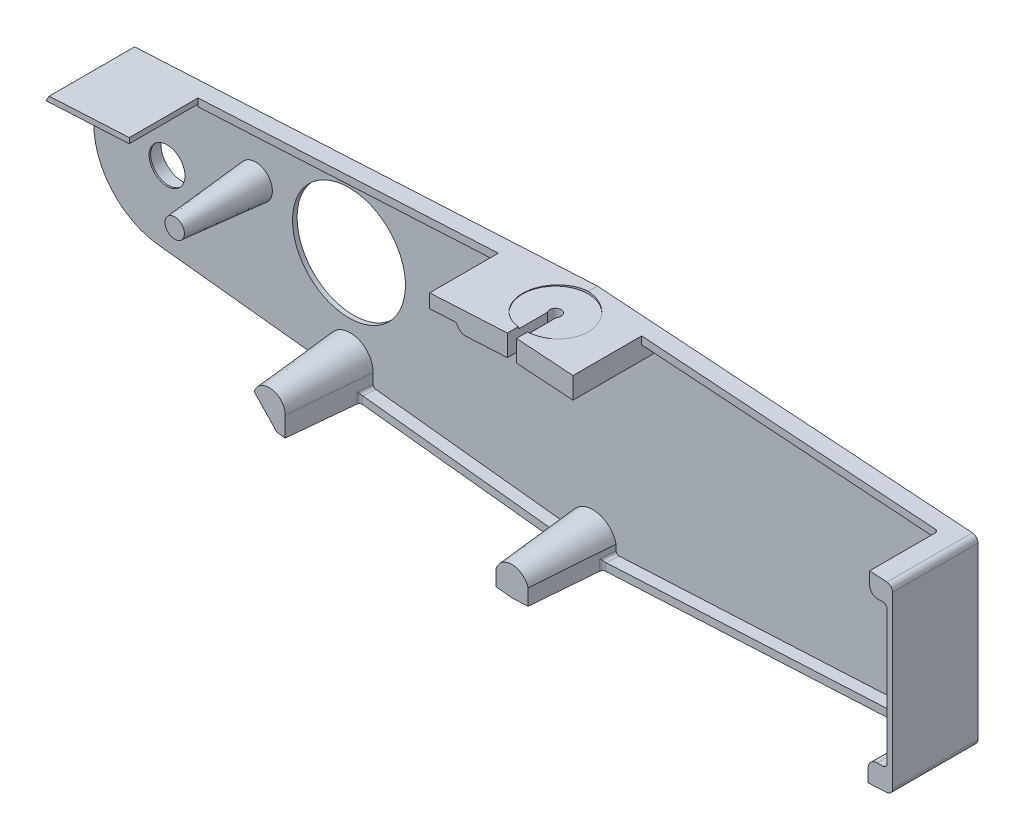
ISO-10303-21;
HEADER;
FILE_DESCRIPTION(('STEP AP214'),'2;1');
FILE_NAME('part.step','',(''),(''),'','','');
FILE_SCHEMA(('AUTOMOTIVE_DESIGN { 1 0 10303 214 1 1 1 1 }'));
ENDSEC;
DATA;
#1=APPLICATION_CONTEXT('core data for automotive mechanical design processes');
#2=APPLICATION_PROTOCOL_DEFINITION('international standard','automotive_design',2000,#1);
#3=PRODUCT_CONTEXT('',#1,'mechanical');
#4=PRODUCT('Part','Part','',(#3));
#5=PRODUCT_RELATED_PRODUCT_CATEGORY('part','',(#4));
#6=PRODUCT_DEFINITION_FORMATION('','',#4);
#7=PRODUCT_DEFINITION_CONTEXT('part definition',#1,'design');
#8=PRODUCT_DEFINITION('design','',#6,#7);
#9=PRODUCT_DEFINITION_SHAPE('','',#8);
#10=(LENGTH_UNIT() NAMED_UNIT(*) SI_UNIT(.MILLI.,.METRE.));
#11=(NAMED_UNIT(*) PLANE_ANGLE_UNIT() SI_UNIT($,.RADIAN.));
#12=(NAMED_UNIT(*) SI_UNIT($,.STERADIAN.) SOLID_ANGLE_UNIT());
#13=UNCERTAINTY_MEASURE_WITH_UNIT(LENGTH_MEASURE(1.E-05),#10,'distance_accuracy_value','');
#14=(GEOMETRIC_REPRESENTATION_CONTEXT(3) GLOBAL_UNCERTAINTY_ASSIGNED_CONTEXT((#13)) GLOBAL_UNIT_ASSIGNED_CONTEXT((#10,
#11,#12)) REPRESENTATION_CONTEXT('',''));
#15=CARTESIAN_POINT('',(0.,0.,0.));
#16=DIRECTION('',(0.,0.,1.));
#17=DIRECTION('',(1.,0.,0.));
#18=AXIS2_PLACEMENT_3D('',#15,#16,#17);
#19=CARTESIAN_POINT('',(0.,0.,-12.));
#20=DIRECTION('',(0.,0.,1.));
#21=DIRECTION('',(1.,0.,0.));
#22=AXIS2_PLACEMENT_3D('',#19,#20,#21);
#23=PLANE('',#22);
#24=CARTESIAN_POINT('',(-4.06519310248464,0.,-12.));
#25=DIRECTION('',(0.,0.,-1.));
#26=DIRECTION('',(-1.,0.,0.));
#27=AXIS2_PLACEMENT_3D('',#24,#25,#26);
#28=CIRCLE('',#27,58.276929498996);
#29=CARTESIAN_POINT('',(0.,58.1349698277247,-12.));
#30=VERTEX_POINT('',#29);
#31=CARTESIAN_POINT('',(0.,-58.1349698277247,-12.));
#32=VERTEX_POINT('',#31);
#33=EDGE_CURVE('E489',#30,#32,#28,.T.);
#34=ORIENTED_EDGE('',*,*,#33,.T.);
#35=CARTESIAN_POINT('',(0.,0.,-12.));
#36=DIRECTION('',(0.,0.,1.));
#37=DIRECTION('',(1.,0.,0.));
#38=AXIS2_PLACEMENT_3D('',#35,#36,#37);
#39=CIRCLE('',#38,58.1349698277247);
#40=EDGE_CURVE('E505',#30,#32,#39,.T.);
#41=ORIENTED_EDGE('',*,*,#40,.F.);
#42=EDGE_LOOP('',(#34,#41));
#43=FACE_BOUND('',#42,.T.);
#44=ADVANCED_FACE('F30',(#43),#23,.F.);
#45=CARTESIAN_POINT('',(-38.8093144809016,-463.21314581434,56.));
#46=DIRECTION('',(0.,0.,1.));
#47=DIRECTION('',(1.,0.,0.));
#48=AXIS2_PLACEMENT_3D('',#45,#46,#47);
#49=PLANE('',#48);
#50=DIRECTION('',(0.,1.,0.));
#51=VECTOR('',#50,1.);
#52=CARTESIAN_POINT('',(3.,43.,56.));
#53=LINE('',#52,#51);
#54=CARTESIAN_POINT('',(3.00000000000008,60.2902195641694,56.));
#55=VERTEX_POINT('',#54);
#56=CARTESIAN_POINT('',(3.,74.2902195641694,56.));
#57=VERTEX_POINT('',#56);
#58=EDGE_CURVE('E1182',#55,#57,#53,.T.);
#59=ORIENTED_EDGE('',*,*,#58,.F.);
#60=DIRECTION('',(0.997564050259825,-0.0697564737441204,0.));
#61=VECTOR('',#60,1.);
#62=CARTESIAN_POINT('',(-495.36964995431,95.1396203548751,56.));
#63=LINE('',#62,#61);
#64=CARTESIAN_POINT('',(40.,57.7029275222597,56.));
#65=VERTEX_POINT('',#64);
#66=EDGE_CURVE('E976',#55,#65,#63,.T.);
#67=ORIENTED_EDGE('',*,*,#66,.T.);
#68=DIRECTION('',(0.,1.,0.));
#69=VECTOR('',#68,1.);
#70=CARTESIAN_POINT('',(40.,2.68645453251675E-13,56.));
#71=LINE('',#70,#69);
#72=CARTESIAN_POINT('',(40.,71.7029275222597,56.));
#73=VERTEX_POINT('',#72);
#74=EDGE_CURVE('E973',#65,#73,#71,.T.);
#75=ORIENTED_EDGE('',*,*,#74,.T.);
#76=DIRECTION('',(0.997564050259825,-0.0697564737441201,0.));
#77=VECTOR('',#76,1.);
#78=CARTESIAN_POINT('',(-1.20286672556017,74.5841126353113,56.));
#79=LINE('',#78,#77);
#80=EDGE_CURVE('E564',#57,#73,#79,.T.);
#81=ORIENTED_EDGE('',*,*,#80,.F.);
#82=EDGE_LOOP('',(#59,#67,#75,#81));
#83=FACE_BOUND('',#82,.T.);
#84=ADVANCED_FACE('F708',(#83),#49,.T.);
#85=CARTESIAN_POINT('',(-1.11006844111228E-13,81.,27.5));
#86=DIRECTION('',(0.,-1.,0.));
#87=DIRECTION('',(0.,0.,-1.));
#88=AXIS2_PLACEMENT_3D('',#85,#86,#87);
#89=CYLINDRICAL_SURFACE('',#88,21.5);
#90=CARTESIAN_POINT('',(-1.11006844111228E-13,73.,27.5));
#91=DIRECTION('',(0.,-1.,0.));
#92=DIRECTION('',(0.,0.,-1.));
#93=AXIS2_PLACEMENT_3D('',#90,#91,#92);
#94=CIRCLE('',#93,21.5);
#95=CARTESIAN_POINT('',(21.4509993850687,73.,28.9507327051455));
#96=VERTEX_POINT('',#95);
#97=CARTESIAN_POINT('',(3.,73.,48.7896688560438));
#98=VERTEX_POINT('',#97);
#99=EDGE_CURVE('E888',#96,#98,#94,.T.);
#100=ORIENTED_EDGE('',*,*,#99,.T.);
#101=DIRECTION('',(0.,-1.,0.));
#102=VECTOR('',#101,1.);
#103=CARTESIAN_POINT('',(3.,81.,48.7896688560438));
#104=LINE('',#103,#102);
#105=CARTESIAN_POINT('',(3.,74.2902195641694,48.7896688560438));
#106=VERTEX_POINT('',#105);
#107=EDGE_CURVE('E881',#98,#106,#104,.F.);
#108=ORIENTED_EDGE('',*,*,#107,.T.);
#109=CARTESIAN_POINT('',(-1.11006844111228E-13,74.4999999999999,27.5));
#110=DIRECTION('',(0.0697564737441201,0.997564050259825,0.));
#111=DIRECTION('',(0.997564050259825,-0.0697564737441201,0.));
#112=AXIS2_PLACEMENT_3D('',#109,#110,#111);
#113=ELLIPSE('',#112,21.5525008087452,21.5);
#114=EDGE_CURVE('E891',#106,#96,#113,.T.);
#115=ORIENTED_EDGE('',*,*,#114,.T.);
#116=EDGE_LOOP('',(#100,#108,#115));
#117=FACE_BOUND('',#116,.T.);
#118=ADVANCED_FACE('F713',(#117),#89,.F.);
#119=CARTESIAN_POINT('',(-38.8093144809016,-463.21314581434,0.));
#120=DIRECTION('',(0.,0.,1.));
#121=DIRECTION('',(1.,0.,0.));
#122=AXIS2_PLACEMENT_3D('',#119,#120,#121);
#123=PLANE('',#122);
#124=CARTESIAN_POINT('',(-159.809771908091,15.,0.));
#125=DIRECTION('',(0.,0.,-1.));
#126=DIRECTION('',(-1.,0.,0.));
#127=AXIS2_PLACEMENT_3D('',#124,#125,#126);
#128=CIRCLE('',#127,37.);
#129=CARTESIAN_POINT('',(-196.809771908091,15.,0.));
#130=VERTEX_POINT('',#129);
#131=EDGE_CURVE('E1179',#130,#130,#128,.T.);
#132=ORIENTED_EDGE('',*,*,#131,.F.);
#133=EDGE_LOOP('',(#132));
#134=FACE_BOUND('',#133,.T.);
#135=CARTESIAN_POINT('',(-279.009641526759,4.87772428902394,0.));
#136=DIRECTION('',(0.,0.,1.));
#137=DIRECTION('',(1.,0.,0.));
#138=AXIS2_PLACEMENT_3D('',#135,#136,#137);
#139=CIRCLE('',#138,28.);
#140=CARTESIAN_POINT('',(-251.009641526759,4.87772428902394,0.));
#141=VERTEX_POINT('',#140);
#142=EDGE_CURVE('E846',#141,#141,#139,.T.);
#143=ORIENTED_EDGE('',*,*,#142,.T.);
#144=EDGE_LOOP('',(#143));
#145=FACE_BOUND('',#144,.T.);
#146=DIRECTION('',(0.998734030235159,0.0503024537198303,0.));
#147=VECTOR('',#146,1.);
#148=CARTESIAN_POINT('',(-58.2395850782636,-77.4333075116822,0.));
#149=LINE('',#148,#147);
#150=CARTESIAN_POINT('',(0.,-74.5,0.));
#151=VERTEX_POINT('',#150);
#152=CARTESIAN_POINT('',(245.592222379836,-62.1304491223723,0.));
#153=VERTEX_POINT('',#152);
#154=EDGE_CURVE('E508',#151,#153,#149,.T.);
#155=ORIENTED_EDGE('',*,*,#154,.F.);
#156=DIRECTION('',(0.993950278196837,-0.109830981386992,0.));
#157=VECTOR('',#156,1.);
#158=CARTESIAN_POINT('',(4.09330328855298,-74.9523078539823,0.));
#159=LINE('',#158,#157);
#160=CARTESIAN_POINT('',(-284.540021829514,-43.0584776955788,0.));
#161=VERTEX_POINT('',#160);
#162=EDGE_CURVE('E550',#161,#151,#159,.T.);
#163=ORIENTED_EDGE('',*,*,#162,.F.);
#164=CARTESIAN_POINT('',(-279.300028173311,4.36250576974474,0.));
#165=DIRECTION('',(0.,0.,1.));
#166=DIRECTION('',(1.,0.,0.));
#167=AXIS2_PLACEMENT_3D('',#164,#165,#166);
#168=CIRCLE('',#167,47.7096133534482);
#169=CARTESIAN_POINT('',(-320.62102566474,28.2116645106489,0.));
#170=VERTEX_POINT('',#169);
#171=EDGE_CURVE('E547',#161,#170,#168,.F.);
#172=ORIENTED_EDGE('',*,*,#171,.T.);
#173=DIRECTION('',(-0.495825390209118,-0.868422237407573,0.));
#174=VECTOR('',#173,1.);
#175=CARTESIAN_POINT('',(-462.940183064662,-221.055766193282,0.));
#176=LINE('',#175,#174);
#177=CARTESIAN_POINT('',(-303.267137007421,58.606442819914,0.));
#178=VERTEX_POINT('',#177);
#179=EDGE_CURVE('E544',#178,#170,#176,.T.);
#180=ORIENTED_EDGE('',*,*,#179,.F.);
#181=DIRECTION('',(0.998629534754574,0.0523359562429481,0.));
#182=VECTOR('',#181,1.);
#183=CARTESIAN_POINT('',(-66.8061781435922,70.9988365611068,0.));
#184=LINE('',#183,#182);
#185=CARTESIAN_POINT('',(-1.11006844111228E-13,74.4999999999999,0.));
#186=VERTEX_POINT('',#185);
#187=EDGE_CURVE('E541',#178,#186,#184,.T.);
#188=ORIENTED_EDGE('',*,*,#187,.T.);
#189=DIRECTION('',(0.997564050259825,-0.0697564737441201,0.));
#190=VECTOR('',#189,1.);
#191=CARTESIAN_POINT('',(-1.20286672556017,74.5841126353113,0.));
#192=LINE('',#191,#190);
#193=CARTESIAN_POINT('',(245.670038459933,57.3210774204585,0.));
#194=VERTEX_POINT('',#193);
#195=EDGE_CURVE('E538',#186,#194,#192,.T.);
#196=ORIENTED_EDGE('',*,*,#195,.T.);
#197=CARTESIAN_POINT('',(245.391012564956,53.3308212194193,0.));
#198=DIRECTION('',(0.,0.,1.));
#199=DIRECTION('',(1.,0.,0.));
#200=AXIS2_PLACEMENT_3D('',#197,#198,#199);
#201=CIRCLE('',#200,3.99999999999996);
#202=CARTESIAN_POINT('',(249.391012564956,53.3308212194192,0.));
#203=VERTEX_POINT('',#202);
#204=EDGE_CURVE('E535',#203,#194,#201,.T.);
#205=ORIENTED_EDGE('',*,*,#204,.F.);
#206=DIRECTION('',(0.,-1.,0.));
#207=VECTOR('',#206,1.);
#208=CARTESIAN_POINT('',(249.391012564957,-463.21314581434,0.));
#209=LINE('',#208,#207);
#210=CARTESIAN_POINT('',(249.391012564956,-58.1355130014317,0.));
#211=VERTEX_POINT('',#210);
#212=EDGE_CURVE('E532',#203,#211,#209,.T.);
#213=ORIENTED_EDGE('',*,*,#212,.T.);
#214=CARTESIAN_POINT('',(245.391012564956,-58.1355130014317,0.));
#215=DIRECTION('',(0.,0.,1.));
#216=DIRECTION('',(1.,0.,0.));
#217=AXIS2_PLACEMENT_3D('',#214,#215,#216);
#218=CIRCLE('',#217,4.00000000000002);
#219=EDGE_CURVE('E529',#153,#211,#218,.T.);
#220=ORIENTED_EDGE('',*,*,#219,.F.);
#221=EDGE_LOOP('',(#155,#163,#172,#180,#188,#196,#205,#213,#220));
#222=FACE_BOUND('',#221,.T.);
#223=CARTESIAN_POINT('',(0.,0.,0.));
#224=DIRECTION('',(0.,0.,1.));
#225=DIRECTION('',(1.,0.,0.));
#226=AXIS2_PLACEMENT_3D('',#223,#224,#225);
#227=CIRCLE('',#226,62.1349698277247);
#228=CARTESIAN_POINT('',(0.142003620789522,62.1348075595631,0.));
#229=VERTEX_POINT('',#228);
#230=CARTESIAN_POINT('',(0.102342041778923,-62.1348855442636,0.));
#231=VERTEX_POINT('',#230);
#232=EDGE_CURVE('E590',#229,#231,#227,.T.);
#233=ORIENTED_EDGE('',*,*,#232,.T.);
#234=DIRECTION('',(0.99873403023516,0.0503024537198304,0.));
#235=VECTOR('',#234,1.);
#236=CARTESIAN_POINT('',(-58.8605342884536,-65.1046224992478,0.));
#237=LINE('',#236,#235);
#238=CARTESIAN_POINT('',(231.323432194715,-50.4891542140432,0.));
#239=VERTEX_POINT('',#238);
#240=EDGE_CURVE('E600',#231,#239,#237,.T.);
#241=ORIENTED_EDGE('',*,*,#240,.T.);
#242=CARTESIAN_POINT('',(230.921012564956,-42.499281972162,0.));
#243=DIRECTION('',(0.,0.,1.));
#244=DIRECTION('',(1.,0.,0.));
#245=AXIS2_PLACEMENT_3D('',#242,#243,#244);
#246=CIRCLE('',#245,8.);
#247=CARTESIAN_POINT('',(238.921012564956,-42.4992819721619,0.));
#248=VERTEX_POINT('',#247);
#249=EDGE_CURVE('E598',#239,#248,#246,.T.);
#250=ORIENTED_EDGE('',*,*,#249,.T.);
#251=DIRECTION('',(0.,1.,0.));
#252=VECTOR('',#251,1.);
#253=CARTESIAN_POINT('',(238.921012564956,-463.21314581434,0.));
#254=LINE('',#253,#252);
#255=CARTESIAN_POINT('',(238.921012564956,37.9776320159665,0.));
#256=VERTEX_POINT('',#255);
#257=EDGE_CURVE('E596',#248,#256,#254,.T.);
#258=ORIENTED_EDGE('',*,*,#257,.T.);
#259=CARTESIAN_POINT('',(230.921012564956,37.9776320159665,0.));
#260=DIRECTION('',(0.,0.,1.));
#261=DIRECTION('',(1.,0.,0.));
#262=AXIS2_PLACEMENT_3D('',#259,#260,#261);
#263=CIRCLE('',#262,8.);
#264=CARTESIAN_POINT('',(231.479064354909,45.9581444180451,0.));
#265=VERTEX_POINT('',#264);
#266=EDGE_CURVE('E594',#256,#265,#263,.T.);
#267=ORIENTED_EDGE('',*,*,#266,.T.);
#268=DIRECTION('',(-0.997564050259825,0.0697564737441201,0.));
#269=VECTOR('',#268,1.);
#270=CARTESIAN_POINT('',(-2.06262682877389,62.2889703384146,0.));
#271=LINE('',#270,#269);
#272=EDGE_CURVE('E592',#265,#229,#271,.T.);
#273=ORIENTED_EDGE('',*,*,#272,.T.);
#274=EDGE_LOOP('',(#233,#241,#250,#258,#267,#273));
#275=FACE_BOUND('',#274,.T.);
#276=ADVANCED_FACE('F744',(#134,#145,#222,#275),#123,.F.);
#277=CARTESIAN_POINT('',(-502.022460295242,0.,3.));
#278=DIRECTION('',(0.,0.,-1.));
#279=DIRECTION('',(-1.,0.,0.));
#280=AXIS2_PLACEMENT_3D('',#277,#278,#279);
#281=PLANE('',#280);
#282=CARTESIAN_POINT('',(-159.809771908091,15.,3.));
#283=DIRECTION('',(0.,0.,-1.));
#284=DIRECTION('',(-1.,0.,0.));
#285=AXIS2_PLACEMENT_3D('',#282,#283,#284);
#286=CIRCLE('',#285,37.);
#287=CARTESIAN_POINT('',(-196.809771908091,15.,3.));
#288=VERTEX_POINT('',#287);
#289=EDGE_CURVE('E34',#288,#288,#286,.T.);
#290=ORIENTED_EDGE('',*,*,#289,.T.);
#291=EDGE_LOOP('',(#290));
#292=FACE_BOUND('',#291,.T.);
#293=CARTESIAN_POINT('',(-279.009641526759,4.87772428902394,3.));
#294=DIRECTION('',(0.,0.,-1.));
#295=DIRECTION('',(-1.,0.,0.));
#296=AXIS2_PLACEMENT_3D('',#293,#294,#295);
#297=CIRCLE('',#296,11.75);
#298=CARTESIAN_POINT('',(-290.759641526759,4.87772428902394,3.));
#299=VERTEX_POINT('',#298);
#300=EDGE_CURVE('E896',#299,#299,#297,.T.);
#301=ORIENTED_EDGE('',*,*,#300,.T.);
#302=EDGE_LOOP('',(#301));
#303=FACE_BOUND('',#302,.T.);
#304=DIRECTION('',(0.,-1.,0.));
#305=VECTOR('',#304,1.);
#306=CARTESIAN_POINT('',(-143.934014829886,-45.0829923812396,3.));
#307=LINE('',#306,#305);
#308=CARTESIAN_POINT('',(-143.934014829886,-45.0829923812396,3.));
#309=VERTEX_POINT('',#308);
#310=CARTESIAN_POINT('',(-143.934014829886,-51.7729194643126,3.));
#311=VERTEX_POINT('',#310);
#312=EDGE_CURVE('E1519',#309,#311,#307,.T.);
#313=ORIENTED_EDGE('',*,*,#312,.T.);
#314=CARTESIAN_POINT('',(-141.926375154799,-51.7746046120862,3.));
#315=DIRECTION('',(0.,0.,-1.));
#316=DIRECTION('',(0.993950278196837,-0.109830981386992,0.));
#317=AXIS2_PLACEMENT_3D('',#314,#315,#316);
#318=ELLIPSE('',#317,2.00773277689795,2.);
#319=CARTESIAN_POINT('',(-142.146037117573,-53.7625051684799,3.));
#320=VERTEX_POINT('',#319);
#321=EDGE_CURVE('E833',#311,#320,#318,.F.);
#322=ORIENTED_EDGE('',*,*,#321,.T.);
#323=DIRECTION('',(-0.993950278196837,0.109830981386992,0.));
#324=VECTOR('',#323,1.);
#325=CARTESIAN_POINT('',(-151.35465542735,-52.7449577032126,3.));
#326=LINE('',#325,#324);
#327=CARTESIAN_POINT('',(-17.4626584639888,-67.5399527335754,3.));
#328=VERTEX_POINT('',#327);
#329=EDGE_CURVE('E1474',#328,#320,#326,.T.);
#330=ORIENTED_EDGE('',*,*,#329,.F.);
#331=CARTESIAN_POINT('',(-17.2429965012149,-65.5520521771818,3.));
#332=DIRECTION('',(0.,0.,-1.));
#333=DIRECTION('',(-0.993950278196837,0.109830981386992,0.));
#334=AXIS2_PLACEMENT_3D('',#331,#332,#333);
#335=ELLIPSE('',#334,2.00773277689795,2.);
#336=CARTESIAN_POINT('',(-15.2353568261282,-65.5537373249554,3.));
#337=VERTEX_POINT('',#336);
#338=EDGE_CURVE('E1295',#328,#337,#335,.F.);
#339=ORIENTED_EDGE('',*,*,#338,.T.);
#340=DIRECTION('',(0.,1.,0.));
#341=VECTOR('',#340,1.);
#342=CARTESIAN_POINT('',(-15.2353568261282,-73.3288760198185,3.));
#343=LINE('',#342,#341);
#344=CARTESIAN_POINT('',(-15.2353568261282,-62.9791310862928,3.));
#345=VERTEX_POINT('',#344);
#346=EDGE_CURVE('E1481',#337,#345,#343,.T.);
#347=ORIENTED_EDGE('',*,*,#346,.T.);
#348=CARTESIAN_POINT('',(0.,-66.5,3.));
#349=DIRECTION('',(0.,0.,1.));
#350=DIRECTION('',(1.,0.,0.));
#351=AXIS2_PLACEMENT_3D('',#348,#349,#350);
#352=CIRCLE('',#351,15.6368991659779);
#353=CARTESIAN_POINT('',(15.213824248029,-62.887221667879,3.));
#354=VERTEX_POINT('',#353);
#355=EDGE_CURVE('E620',#354,#345,#352,.T.);
#356=ORIENTED_EDGE('',*,*,#355,.F.);
#357=DIRECTION('',(0.,-1.,0.));
#358=VECTOR('',#357,1.);
#359=CARTESIAN_POINT('',(15.213824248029,-73.6098668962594,3.));
#360=LINE('',#359,#358);
#361=CARTESIAN_POINT('',(15.213824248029,-66.6245151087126,3.));
#362=VERTEX_POINT('',#361);
#363=EDGE_CURVE('E625',#354,#362,#360,.T.);
#364=ORIENTED_EDGE('',*,*,#363,.T.);
#365=CARTESIAN_POINT('',(17.2214639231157,-66.623747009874,3.));
#366=DIRECTION('',(0.,0.,-1.));
#367=DIRECTION('',(0.998734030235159,0.0503024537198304,0.));
#368=AXIS2_PLACEMENT_3D('',#365,#366,#367);
#369=ELLIPSE('',#368,2.00765901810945,2.);
#370=CARTESIAN_POINT('',(17.3220688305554,-68.6212150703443,3.));
#371=VERTEX_POINT('',#370);
#372=EDGE_CURVE('E819',#362,#371,#369,.F.);
#373=ORIENTED_EDGE('',*,*,#372,.T.);
#374=DIRECTION('',(-0.998734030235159,-0.0503024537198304,0.));
#375=VECTOR('',#374,1.);
#376=CARTESIAN_POINT('',(12.2091777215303,-68.8787320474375,3.));
#377=LINE('',#376,#375);
#378=CARTESIAN_POINT('',(231.491617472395,-57.8343053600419,3.));
#379=VERTEX_POINT('',#378);
#380=EDGE_CURVE('E805',#379,#371,#377,.T.);
#381=ORIENTED_EDGE('',*,*,#380,.F.);
#382=CARTESIAN_POINT('',(231.391012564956,-55.8368372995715,3.));
#383=DIRECTION('',(0.,0.,-1.));
#384=DIRECTION('',(-1.,0.,0.));
#385=AXIS2_PLACEMENT_3D('',#382,#383,#384);
#386=CIRCLE('',#385,2.);
#387=CARTESIAN_POINT('',(233.391012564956,-55.8368372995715,3.));
#388=VERTEX_POINT('',#387);
#389=EDGE_CURVE('E1278',#379,#388,#386,.F.);
#390=ORIENTED_EDGE('',*,*,#389,.T.);
#391=DIRECTION('',(0.,1.,0.));
#392=VECTOR('',#391,1.);
#393=CARTESIAN_POINT('',(233.391012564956,0.,3.));
#394=LINE('',#393,#392);
#395=CARTESIAN_POINT('',(233.391012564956,-54.4326399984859,3.));
#396=VERTEX_POINT('',#395);
#397=EDGE_CURVE('E1053',#388,#396,#394,.T.);
#398=ORIENTED_EDGE('',*,*,#397,.T.);
#399=CARTESIAN_POINT('',(239.391012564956,-54.4326399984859,3.));
#400=DIRECTION('',(0.,0.,-1.));
#401=DIRECTION('',(-1.,0.,0.));
#402=AXIS2_PLACEMENT_3D('',#399,#400,#401);
#403=CIRCLE('',#402,6.00000000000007);
#404=CARTESIAN_POINT('',(239.391012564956,-48.4326399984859,3.));
#405=VERTEX_POINT('',#404);
#406=EDGE_CURVE('E1055',#396,#405,#403,.T.);
#407=ORIENTED_EDGE('',*,*,#406,.T.);
#408=DIRECTION('',(-1.,0.,0.));
#409=VECTOR('',#408,1.);
#410=CARTESIAN_POINT('',(-502.022460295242,-48.4326399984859,3.));
#411=LINE('',#410,#409);
#412=CARTESIAN_POINT('',(242.891012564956,-48.4326399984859,3.));
#413=VERTEX_POINT('',#412);
#414=EDGE_CURVE('E1001',#413,#405,#411,.T.);
#415=ORIENTED_EDGE('',*,*,#414,.F.);
#416=CARTESIAN_POINT('',(242.891012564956,-45.4326399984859,3.));
#417=DIRECTION('',(0.,0.,-1.));
#418=DIRECTION('',(-1.,0.,0.));
#419=AXIS2_PLACEMENT_3D('',#416,#417,#418);
#420=CIRCLE('',#419,3.);
#421=CARTESIAN_POINT('',(245.891012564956,-45.4326399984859,3.));
#422=VERTEX_POINT('',#421);
#423=EDGE_CURVE('E1003',#413,#422,#420,.F.);
#424=ORIENTED_EDGE('',*,*,#423,.T.);
#425=DIRECTION('',(0.,1.,0.));
#426=VECTOR('',#425,1.);
#427=CARTESIAN_POINT('',(245.891012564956,0.,3.));
#428=LINE('',#427,#426);
#429=CARTESIAN_POINT('',(245.891012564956,41.7663890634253,3.));
#430=VERTEX_POINT('',#429);
#431=EDGE_CURVE('E1006',#422,#430,#428,.T.);
#432=ORIENTED_EDGE('',*,*,#431,.T.);
#433=CARTESIAN_POINT('',(242.891012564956,41.7663890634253,3.));
#434=DIRECTION('',(0.,0.,-1.));
#435=DIRECTION('',(-1.,0.,0.));
#436=AXIS2_PLACEMENT_3D('',#433,#434,#435);
#437=CIRCLE('',#436,3.);
#438=CARTESIAN_POINT('',(242.891012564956,44.7663890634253,3.));
#439=VERTEX_POINT('',#438);
#440=EDGE_CURVE('E1009',#439,#430,#437,.T.);
#441=ORIENTED_EDGE('',*,*,#440,.F.);
#442=DIRECTION('',(-1.,0.,0.));
#443=VECTOR('',#442,1.);
#444=CARTESIAN_POINT('',(-502.022460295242,44.7663890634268,3.));
#445=LINE('',#444,#443);
#446=CARTESIAN_POINT('',(239.391012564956,44.7663890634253,3.));
#447=VERTEX_POINT('',#446);
#448=EDGE_CURVE('E1011',#439,#447,#445,.T.);
#449=ORIENTED_EDGE('',*,*,#448,.T.);
#450=CARTESIAN_POINT('',(239.391012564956,49.7406144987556,3.));
#451=DIRECTION('',(0.,0.,-1.));
#452=DIRECTION('',(-1.,0.,0.));
#453=AXIS2_PLACEMENT_3D('',#450,#451,#452);
#454=CIRCLE('',#453,4.9742254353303);
#455=CARTESIAN_POINT('',(234.416787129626,49.7406144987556,3.));
#456=VERTEX_POINT('',#455);
#457=EDGE_CURVE('E1014',#447,#456,#454,.T.);
#458=ORIENTED_EDGE('',*,*,#457,.T.);
#459=DIRECTION('',(0.,-1.,0.));
#460=VECTOR('',#459,1.);
#461=CARTESIAN_POINT('',(234.416787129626,0.,3.));
#462=LINE('',#461,#460);
#463=CARTESIAN_POINT('',(234.416787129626,51.2307417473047,3.));
#464=VERTEX_POINT('',#463);
#465=EDGE_CURVE('E1017',#464,#456,#462,.T.);
#466=ORIENTED_EDGE('',*,*,#465,.F.);
#467=CARTESIAN_POINT('',(232.416787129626,51.2307417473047,3.));
#468=DIRECTION('',(0.,0.,-1.));
#469=DIRECTION('',(-1.,0.,0.));
#470=AXIS2_PLACEMENT_3D('',#467,#468,#469);
#471=CIRCLE('',#470,2.);
#472=CARTESIAN_POINT('',(232.556300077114,53.2258698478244,3.));
#473=VERTEX_POINT('',#472);
#474=EDGE_CURVE('E1263',#464,#473,#471,.F.);
#475=ORIENTED_EDGE('',*,*,#474,.T.);
#476=DIRECTION('',(-0.997564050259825,0.0697564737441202,0.));
#477=VECTOR('',#476,1.);
#478=CARTESIAN_POINT('',(-494.744220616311,104.083676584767,3.));
#479=LINE('',#478,#477);
#480=CARTESIAN_POINT('',(40.,66.6907180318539,3.));
#481=VERTEX_POINT('',#480);
#482=EDGE_CURVE('E1019',#473,#481,#479,.T.);
#483=ORIENTED_EDGE('',*,*,#482,.T.);
#484=DIRECTION('',(0.,1.,0.));
#485=VECTOR('',#484,1.);
#486=CARTESIAN_POINT('',(40.,2.68645453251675E-13,3.));
#487=LINE('',#486,#485);
#488=CARTESIAN_POINT('',(40.,57.7029275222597,3.));
#489=VERTEX_POINT('',#488);
#490=EDGE_CURVE('E1021',#489,#481,#487,.T.);
#491=ORIENTED_EDGE('',*,*,#490,.F.);
#492=DIRECTION('',(0.997564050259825,-0.0697564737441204,0.));
#493=VECTOR('',#492,1.);
#494=CARTESIAN_POINT('',(-495.36964995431,95.1396203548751,3.));
#495=LINE('',#494,#493);
#496=CARTESIAN_POINT('',(0.,60.4999999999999,3.));
#497=VERTEX_POINT('',#496);
#498=EDGE_CURVE('E1024',#497,#489,#495,.T.);
#499=ORIENTED_EDGE('',*,*,#498,.F.);
#500=DIRECTION('',(0.998629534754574,0.0523359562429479,0.));
#501=VECTOR('',#500,1.);
#502=CARTESIAN_POINT('',(-503.809380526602,34.096469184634,3.));
#503=LINE('',#502,#501);
#504=CARTESIAN_POINT('',(-29.9588860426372,58.9299213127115,3.));
#505=VERTEX_POINT('',#504);
#506=EDGE_CURVE('E1026',#505,#497,#503,.T.);
#507=ORIENTED_EDGE('',*,*,#506,.F.);
#508=CARTESIAN_POINT('',(-30.2729017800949,64.9216985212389,3.));
#509=DIRECTION('',(0.,0.,-1.));
#510=DIRECTION('',(-1.,0.,0.));
#511=AXIS2_PLACEMENT_3D('',#508,#509,#510);
#512=CIRCLE('',#511,5.99999999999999);
#513=CARTESIAN_POINT('',(-35.6014107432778,62.1636208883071,3.));
#514=VERTEX_POINT('',#513);
#515=EDGE_CURVE('E1028',#514,#505,#512,.F.);
#516=ORIENTED_EDGE('',*,*,#515,.F.);
#517=CARTESIAN_POINT('',(-37.8216228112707,61.0144218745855,3.));
#518=DIRECTION('',(0.,0.,-1.));
#519=DIRECTION('',(-1.,0.,0.));
#520=AXIS2_PLACEMENT_3D('',#517,#518,#519);
#521=CIRCLE('',#520,2.50000000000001);
#522=CARTESIAN_POINT('',(-37.9524627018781,63.5109957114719,3.));
#523=VERTEX_POINT('',#522);
#524=EDGE_CURVE('E1030',#523,#514,#521,.T.);
#525=ORIENTED_EDGE('',*,*,#524,.F.);
#526=DIRECTION('',(-0.998629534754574,-0.052335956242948,0.));
#527=VECTOR('',#526,1.);
#528=CARTESIAN_POINT('',(-504.070701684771,39.0827739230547,3.));
#529=LINE('',#528,#527);
#530=CARTESIAN_POINT('',(-53.9259948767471,62.6738583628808,3.));
#531=VERTEX_POINT('',#530);
#532=EDGE_CURVE('E1032',#523,#531,#529,.T.);
#533=ORIENTED_EDGE('',*,*,#532,.T.);
#534=DIRECTION('',(0.,-1.,0.));
#535=VECTOR('',#534,1.);
#536=CARTESIAN_POINT('',(-53.925994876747,3.45477092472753E-13,3.));
#537=LINE('',#536,#535);
#538=CARTESIAN_POINT('',(-53.9259948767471,66.6669966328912,3.));
#539=VERTEX_POINT('',#538);
#540=EDGE_CURVE('E1035',#539,#531,#537,.T.);
#541=ORIENTED_EDGE('',*,*,#540,.F.);
#542=DIRECTION('',(-0.998629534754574,-0.0523359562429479,0.));
#543=VECTOR('',#542,1.);
#544=CARTESIAN_POINT('',(-504.27939998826,43.0649747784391,3.));
#545=LINE('',#544,#543);
#546=CARTESIAN_POINT('',(-250.751565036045,56.3518055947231,3.));
#547=VERTEX_POINT('',#546);
#548=EDGE_CURVE('E1037',#539,#547,#545,.T.);
#549=ORIENTED_EDGE('',*,*,#548,.T.);
#550=DIRECTION('',(0.,-1.,0.));
#551=VECTOR('',#550,1.);
#552=CARTESIAN_POINT('',(-250.751565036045,0.,3.));
#553=LINE('',#552,#551);
#554=CARTESIAN_POINT('',(-250.751565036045,57.8586673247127,3.));
#555=VERTEX_POINT('',#554);
#556=EDGE_CURVE('E1040',#555,#547,#553,.T.);
#557=ORIENTED_EDGE('',*,*,#556,.F.);
#558=DIRECTION('',(-0.998629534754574,-0.0523359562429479,0.));
#559=VECTOR('',#558,1.);
#560=CARTESIAN_POINT('',(-504.358154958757,44.5677091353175,3.));
#561=LINE('',#560,#559);
#562=CARTESIAN_POINT('',(-305.32709947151,54.9984847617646,3.));
#563=VERTEX_POINT('',#562);
#564=EDGE_CURVE('E1042',#555,#563,#561,.T.);
#565=ORIENTED_EDGE('',*,*,#564,.T.);
#566=DIRECTION('',(0.495825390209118,0.868422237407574,0.));
#567=VECTOR('',#566,1.);
#568=CARTESIAN_POINT('',(-377.364807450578,-71.1732458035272,3.));
#569=LINE('',#568,#567);
#570=CARTESIAN_POINT('',(-320.62102566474,28.2116645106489,3.));
#571=VERTEX_POINT('',#570);
#572=EDGE_CURVE('E1045',#571,#563,#569,.T.);
#573=ORIENTED_EDGE('',*,*,#572,.F.);
#574=CARTESIAN_POINT('',(-279.300028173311,4.36250576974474,3.));
#575=DIRECTION('',(0.,0.,-1.));
#576=DIRECTION('',(-1.,0.,0.));
#577=AXIS2_PLACEMENT_3D('',#574,#575,#576);
#578=CIRCLE('',#577,47.7096133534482);
#579=CARTESIAN_POINT('',(-284.540021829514,-43.0584776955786,3.));
#580=VERTEX_POINT('',#579);
#581=EDGE_CURVE('E1048',#571,#580,#578,.F.);
#582=ORIENTED_EDGE('',*,*,#581,.T.);
#583=DIRECTION('',(-0.993950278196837,0.109830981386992,0.));
#584=VECTOR('',#583,1.);
#585=CARTESIAN_POINT('',(-504.099548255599,-18.7972658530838,3.));
#586=LINE('',#585,#584);
#587=CARTESIAN_POINT('',(-154.037640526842,-57.4789219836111,3.));
#588=VERTEX_POINT('',#587);
#589=EDGE_CURVE('E1051',#588,#580,#586,.T.);
#590=ORIENTED_EDGE('',*,*,#589,.F.);
#591=DIRECTION('',(-0.690812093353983,0.723034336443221,0.));
#592=VECTOR('',#591,1.);
#593=CARTESIAN_POINT('',(-154.037640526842,-57.4789219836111,3.));
#594=LINE('',#593,#592);
#595=CARTESIAN_POINT('',(-172.434533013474,-38.2239247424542,3.));
#596=VERTEX_POINT('',#595);
#597=EDGE_CURVE('E1461',#588,#596,#594,.T.);
#598=ORIENTED_EDGE('',*,*,#597,.T.);
#599=CARTESIAN_POINT('',(-159.009641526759,-45.0829923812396,3.));
#600=DIRECTION('',(0.,0.,1.));
#601=DIRECTION('',(1.,0.,0.));
#602=AXIS2_PLACEMENT_3D('',#599,#600,#601);
#603=CIRCLE('',#602,15.0756266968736);
#604=EDGE_CURVE('E690',#309,#596,#603,.T.);
#605=ORIENTED_EDGE('',*,*,#604,.F.);
#606=EDGE_LOOP('',(#313,#322,#330,#339,#347,#356,#364,#373,#381,#390,#398,#407,#415,#424,#432,
#441,#449,#458,#466,#475,#483,#491,#499,#507,#516,#525,#533,#541,#549,#557,#565,#573,#582,#590,
#598,#605));
#607=FACE_BOUND('',#606,.T.);
#608=CARTESIAN_POINT('',(-221.,24.9203834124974,3.));
#609=DIRECTION('',(0.,0.,-1.));
#610=DIRECTION('',(-1.,0.,0.));
#611=AXIS2_PLACEMENT_3D('',#608,#609,#610);
#612=CIRCLE('',#611,11.);
#613=CARTESIAN_POINT('',(-232.,24.9203834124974,3.));
#614=VERTEX_POINT('',#613);
#615=EDGE_CURVE('E840',#614,#614,#612,.F.);
#616=ORIENTED_EDGE('',*,*,#615,.F.);
#617=EDGE_LOOP('',(#616));
#618=FACE_BOUND('',#617,.T.);
#619=ADVANCED_FACE('F667',(#292,#303,#607,#618),#281,.F.);
#620=CARTESIAN_POINT('',(10.5769250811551,-73.6098668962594,56.));
#621=DIRECTION('',(0.996194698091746,0.,0.0871557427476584));
#622=DIRECTION('',(0.0871557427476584,0.,-0.996194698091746));
#623=AXIS2_PLACEMENT_3D('',#620,#621,#622);
#624=PLANE('',#623);
#625=DIRECTION('',(0.0871549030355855,0.00438966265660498,-0.996185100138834));
#626=VECTOR('',#625,1.);
#627=CARTESIAN_POINT('',(10.4963791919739,-73.971337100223,56.9206437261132));
#628=LINE('',#627,#626);
#629=CARTESIAN_POINT('',(10.5769250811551,-73.9672803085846,56.));
#630=VERTEX_POINT('',#629);
#631=CARTESIAN_POINT('',(14.354187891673,-73.7770338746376,12.8256885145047));
#632=VERTEX_POINT('',#631);
#633=EDGE_CURVE('E636',#630,#632,#628,.T.);
#634=ORIENTED_EDGE('',*,*,#633,.T.);
#635=DIRECTION('',(0.,1.,0.));
#636=VECTOR('',#635,1.);
#637=CARTESIAN_POINT('',(14.354187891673,-73.6098668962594,12.8256885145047));
#638=LINE('',#637,#636);
#639=CARTESIAN_POINT('',(14.354187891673,-66.6678117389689,12.8256885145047));
#640=VERTEX_POINT('',#639);
#641=EDGE_CURVE('E813',#632,#640,#638,.T.);
#642=ORIENTED_EDGE('',*,*,#641,.T.);
#643=DIRECTION('',(0.0871549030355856,0.00438966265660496,-0.996185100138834));
#644=VECTOR('',#643,1.);
#645=CARTESIAN_POINT('',(10.574341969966,-66.8581882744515,56.0295250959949));
#646=LINE('',#645,#644);
#647=EDGE_CURVE('E1305',#640,#362,#646,.T.);
#648=ORIENTED_EDGE('',*,*,#647,.T.);
#649=ORIENTED_EDGE('',*,*,#363,.F.);
#650=CARTESIAN_POINT('',(10.5769250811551,-63.4786334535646,56.));
#651=CARTESIAN_POINT('',(10.8708547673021,-63.4374797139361,52.6403683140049));
#652=CARTESIAN_POINT('',(11.1647853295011,-63.3971570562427,49.2807266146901));
#653=CARTESIAN_POINT('',(11.7526479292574,-63.3180092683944,42.5614263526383));
#654=CARTESIAN_POINT('',(12.0465799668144,-63.279184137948,39.2017677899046));
#655=CARTESIAN_POINT('',(12.8193947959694,-63.1788563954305,30.3684538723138));
#656=CARTESIAN_POINT('',(13.2982786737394,-63.1184563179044,24.8947861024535));
#657=CARTESIAN_POINT('',(14.2560494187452,-63.0006898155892,13.9474163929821));
#658=CARTESIAN_POINT('',(14.734936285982,-62.9433233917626,8.47371445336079));
#659=CARTESIAN_POINT('',(15.213824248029,-62.887221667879,3.));
#660=B_SPLINE_CURVE_WITH_KNOTS('',3,(#650,#651,#652,#653,#654,#655,#656,#657,#658,#659),
.UNSPECIFIED.,.F.,.F.,(4,2,2,2,4),(0.,10.118147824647,20.236293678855,36.7210175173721,
53.2057465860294),.UNSPECIFIED.);
#661=CARTESIAN_POINT('',(10.5769250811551,-63.4786334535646,56.));
#662=VERTEX_POINT('',#661);
#663=EDGE_CURVE('E648',#662,#354,#660,.T.);
#664=ORIENTED_EDGE('',*,*,#663,.F.);
#665=DIRECTION('',(0.,1.,0.));
#666=VECTOR('',#665,1.);
#667=CARTESIAN_POINT('',(10.5769250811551,-73.6098668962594,56.));
#668=LINE('',#667,#666);
#669=EDGE_CURVE('E621',#630,#662,#668,.T.);
#670=ORIENTED_EDGE('',*,*,#669,.F.);
#671=EDGE_LOOP('',(#634,#642,#648,#649,#664,#670));
#672=FACE_BOUND('',#671,.T.);
#673=ADVANCED_FACE('F662',(#672),#624,.T.);
#674=CARTESIAN_POINT('',(233.391012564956,0.,3.));
#675=DIRECTION('',(1.,0.,0.));
#676=DIRECTION('',(0.,0.,-1.));
#677=AXIS2_PLACEMENT_3D('',#674,#675,#676);
#678=PLANE('',#677);
#679=ORIENTED_EDGE('',*,*,#397,.F.);
#680=DIRECTION('',(0.,0.,-1.));
#681=VECTOR('',#680,1.);
#682=CARTESIAN_POINT('',(233.391012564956,-55.8368372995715,13.));
#683=LINE('',#682,#681);
#684=CARTESIAN_POINT('',(233.391012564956,-55.8368372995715,13.));
#685=VERTEX_POINT('',#684);
#686=EDGE_CURVE('E1280',#388,#685,#683,.F.);
#687=ORIENTED_EDGE('',*,*,#686,.T.);
#688=DIRECTION('',(0.,1.,0.));
#689=VECTOR('',#688,1.);
#690=CARTESIAN_POINT('',(233.391012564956,-62.7449778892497,13.));
#691=LINE('',#690,#689);
#692=CARTESIAN_POINT('',(233.391012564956,-62.7449778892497,13.));
#693=VERTEX_POINT('',#692);
#694=EDGE_CURVE('E1269',#685,#693,#691,.F.);
#695=ORIENTED_EDGE('',*,*,#694,.T.);
#696=DIRECTION('',(0.,0.,1.));
#697=VECTOR('',#696,1.);
#698=CARTESIAN_POINT('',(233.391012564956,-62.7449778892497,3.));
#699=LINE('',#698,#697);
#700=CARTESIAN_POINT('',(233.391012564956,-62.7449778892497,56.));
#701=VERTEX_POINT('',#700);
#702=EDGE_CURVE('E1064',#693,#701,#699,.T.);
#703=ORIENTED_EDGE('',*,*,#702,.T.);
#704=DIRECTION('',(0.,1.,0.));
#705=VECTOR('',#704,1.);
#706=CARTESIAN_POINT('',(233.391012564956,0.,56.));
#707=LINE('',#706,#705);
#708=CARTESIAN_POINT('',(233.391012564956,-54.4326399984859,56.));
#709=VERTEX_POINT('',#708);
#710=EDGE_CURVE('E995',#701,#709,#707,.T.);
#711=ORIENTED_EDGE('',*,*,#710,.T.);
#712=DIRECTION('',(0.,0.,1.));
#713=VECTOR('',#712,1.);
#714=CARTESIAN_POINT('',(233.391012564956,-54.4326399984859,3.));
#715=LINE('',#714,#713);
#716=EDGE_CURVE('E1062',#396,#709,#715,.T.);
#717=ORIENTED_EDGE('',*,*,#716,.F.);
#718=EDGE_LOOP('',(#679,#687,#695,#703,#711,#717));
#719=FACE_BOUND('',#718,.T.);
#720=ADVANCED_FACE('F666',(#719),#678,.F.);
#721=CARTESIAN_POINT('',(-148.57091399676,-45.0829923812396,56.));
#722=DIRECTION('',(0.996194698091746,0.,0.0871557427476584));
#723=DIRECTION('',(0.0871557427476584,0.,-0.996194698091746));
#724=AXIS2_PLACEMENT_3D('',#721,#722,#723);
#725=PLANE('',#724);
#726=DIRECTION('',(0.,1.,0.));
#727=VECTOR('',#726,1.);
#728=CARTESIAN_POINT('',(-144.793651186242,-45.0829923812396,12.8256885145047));
#729=LINE('',#728,#727);
#730=CARTESIAN_POINT('',(-144.793651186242,-58.5003779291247,12.8256885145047));
#731=VERTEX_POINT('',#730);
#732=CARTESIAN_POINT('',(-144.793651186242,-51.6779301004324,12.8256885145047));
#733=VERTEX_POINT('',#732);
#734=EDGE_CURVE('E817',#731,#733,#729,.T.);
#735=ORIENTED_EDGE('',*,*,#734,.T.);
#736=DIRECTION('',(0.0871517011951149,-0.00963021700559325,-0.99614850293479));
#737=VECTOR('',#736,1.);
#738=CARTESIAN_POINT('',(-148.576098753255,-51.2599716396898,56.0592620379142));
#739=LINE('',#738,#737);
#740=EDGE_CURVE('E830',#733,#311,#739,.T.);
#741=ORIENTED_EDGE('',*,*,#740,.T.);
#742=ORIENTED_EDGE('',*,*,#312,.F.);
#743=DIRECTION('',(0.0871557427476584,0.,-0.996194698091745));
#744=VECTOR('',#743,1.);
#745=CARTESIAN_POINT('',(-148.57091399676,-45.0829923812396,56.));
#746=LINE('',#745,#744);
#747=CARTESIAN_POINT('',(-148.57091399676,-45.0829923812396,56.));
#748=VERTEX_POINT('',#747);
#749=EDGE_CURVE('E1253',#748,#309,#746,.T.);
#750=ORIENTED_EDGE('',*,*,#749,.F.);
#751=DIRECTION('',(0.,-1.,0.));
#752=VECTOR('',#751,1.);
#753=CARTESIAN_POINT('',(-148.57091399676,-45.0829923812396,56.));
#754=LINE('',#753,#752);
#755=CARTESIAN_POINT('',(-148.57091399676,-58.0829923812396,56.));
#756=VERTEX_POINT('',#755);
#757=EDGE_CURVE('E1512',#748,#756,#754,.T.);
#758=ORIENTED_EDGE('',*,*,#757,.T.);
#759=DIRECTION('',(0.0871517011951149,-0.00963021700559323,-0.99614850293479));
#760=VECTOR('',#759,1.);
#761=CARTESIAN_POINT('',(-148.731388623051,-58.0652600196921,57.8342333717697));
#762=LINE('',#761,#760);
#763=EDGE_CURVE('E1249',#756,#731,#762,.T.);
#764=ORIENTED_EDGE('',*,*,#763,.T.);
#765=EDGE_LOOP('',(#735,#741,#742,#750,#758,#764));
#766=FACE_BOUND('',#765,.T.);
#767=ADVANCED_FACE('F32',(#766),#725,.T.);
#768=CARTESIAN_POINT('',(-159.009641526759,-45.0829923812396,56.));
#769=DIRECTION('',(0.,0.,-1.));
#770=DIRECTION('',(1.,0.,0.));
#771=AXIS2_PLACEMENT_3D('',#768,#769,#770);
#772=CONICAL_SURFACE('',#771,10.4387275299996,0.0872664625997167);
#773=CARTESIAN_POINT('',(-168.943944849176,-41.8773279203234,56.0002));
#774=CARTESIAN_POINT('',(-169.053375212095,-41.7627932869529,54.4077445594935));
#775=CARTESIAN_POINT('',(-169.16218058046,-41.6489128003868,52.8151994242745));
#776=CARTESIAN_POINT('',(-169.378695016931,-41.4222992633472,49.6299534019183));
#777=CARTESIAN_POINT('',(-169.486404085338,-41.3095662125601,48.0372525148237));
#778=CARTESIAN_POINT('',(-169.808117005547,-40.9728473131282,43.2589571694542));
#779=CARTESIAN_POINT('',(-170.020707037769,-40.7503412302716,40.0731632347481));
#780=CARTESIAN_POINT('',(-170.418959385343,-40.333512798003,34.0637139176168));
#781=CARTESIAN_POINT('',(-170.604933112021,-40.1388645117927,31.2401016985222));
#782=CARTESIAN_POINT('',(-170.97502948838,-39.7515053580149,25.5926227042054));
#783=CARTESIAN_POINT('',(-171.159152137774,-39.5587944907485,22.7687559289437));
#784=CARTESIAN_POINT('',(-171.525878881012,-39.1749621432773,17.1208048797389));
#785=CARTESIAN_POINT('',(-171.70848296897,-38.9838406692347,14.2967206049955));
#786=CARTESIAN_POINT('',(-172.072412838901,-38.6029356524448,8.64838066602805));
#787=CARTESIAN_POINT('',(-172.25373862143,-38.4131521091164,5.82412500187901));
#788=CARTESIAN_POINT('',(-172.434545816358,-38.2239113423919,2.99980000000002));
#789=B_SPLINE_CURVE_WITH_KNOTS('',3,(#773,#774,#775,#776,#777,#778,#779,#780,#781,#782,#783,
#784,#785,#786,#787,#788),.UNSPECIFIED.,.F.,.F.,(4,2,2,2,2,2,2,4),(0.,4.80094373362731,
9.60188615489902,19.2037505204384,27.7129995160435,36.2222498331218,44.7315331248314,
53.2408127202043),.UNSPECIFIED.);
#790=CARTESIAN_POINT('',(-168.943958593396,-41.8773135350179,56.));
#791=VERTEX_POINT('',#790);
#792=EDGE_CURVE('E684',#791,#596,#789,.T.);
#793=ORIENTED_EDGE('',*,*,#792,.F.);
#794=CARTESIAN_POINT('',(-159.009641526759,-45.0829923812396,56.));
#795=DIRECTION('',(0.,0.,1.));
#796=DIRECTION('',(1.,0.,0.));
#797=AXIS2_PLACEMENT_3D('',#794,#795,#796);
#798=CIRCLE('',#797,10.4387275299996);
#799=EDGE_CURVE('E693',#748,#791,#798,.T.);
#800=ORIENTED_EDGE('',*,*,#799,.F.);
#801=ORIENTED_EDGE('',*,*,#749,.T.);
#802=ORIENTED_EDGE('',*,*,#604,.T.);
#803=EDGE_LOOP('',(#793,#800,#801,#802));
#804=FACE_BOUND('',#803,.T.);
#805=ADVANCED_FACE('F695',(#804),#772,.T.);
#806=CARTESIAN_POINT('',(-169.443869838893,-55.7765417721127,56.));
#807=DIRECTION('',(0.109830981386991,0.993950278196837,0.));
#808=DIRECTION('',(-0.993950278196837,0.109830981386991,0.));
#809=AXIS2_PLACEMENT_3D('',#806,#807,#808);
#810=PLANE('',#809);
#811=DIRECTION('',(0.,0.,-1.));
#812=VECTOR('',#811,1.);
#813=CARTESIAN_POINT('',(-154.037640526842,-57.4789219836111,73.));
#814=LINE('',#813,#812);
#815=CARTESIAN_POINT('',(-154.037640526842,-57.4789219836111,56.));
#816=VERTEX_POINT('',#815);
#817=EDGE_CURVE('E1463',#816,#588,#814,.T.);
#818=ORIENTED_EDGE('',*,*,#817,.T.);
#819=ORIENTED_EDGE('',*,*,#589,.T.);
#820=DIRECTION('',(0.,0.,-1.));
#821=VECTOR('',#820,1.);
#822=CARTESIAN_POINT('',(-284.540021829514,-43.0584776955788,56.));
#823=LINE('',#822,#821);
#824=EDGE_CURVE('E573',#580,#161,#823,.T.);
#825=ORIENTED_EDGE('',*,*,#824,.T.);
#826=ORIENTED_EDGE('',*,*,#162,.T.);
#827=DIRECTION('',(0.,0.,-1.));
#828=VECTOR('',#827,1.);
#829=CARTESIAN_POINT('',(0.,-74.5,56.));
#830=LINE('',#829,#828);
#831=CARTESIAN_POINT('',(0.,-74.5,56.));
#832=VERTEX_POINT('',#831);
#833=EDGE_CURVE('E637',#832,#151,#830,.T.);
#834=ORIENTED_EDGE('',*,*,#833,.F.);
#835=DIRECTION('',(-0.993950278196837,0.109830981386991,0.));
#836=VECTOR('',#835,1.);
#837=CARTESIAN_POINT('',(0.,-74.5,56.));
#838=LINE('',#837,#836);
#839=CARTESIAN_POINT('',(-10.5984576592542,-73.3288760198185,56.));
#840=VERTEX_POINT('',#839);
#841=EDGE_CURVE('E630',#832,#840,#838,.T.);
#842=ORIENTED_EDGE('',*,*,#841,.T.);
#843=DIRECTION('',(-0.0871517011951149,0.00963021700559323,-0.99614850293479));
#844=VECTOR('',#843,1.);
#845=CARTESIAN_POINT('',(-10.5169750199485,-73.337879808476,56.9313508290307));
#846=LINE('',#845,#844);
#847=CARTESIAN_POINT('',(-14.3757204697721,-72.9114904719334,12.8256885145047));
#848=VERTEX_POINT('',#847);
#849=EDGE_CURVE('E639',#840,#848,#846,.T.);
#850=ORIENTED_EDGE('',*,*,#849,.T.);
#851=CARTESIAN_POINT('',(-16.3681098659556,-72.6913324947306,13.));
#852=DIRECTION('',(0.109830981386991,0.993950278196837,0.));
#853=DIRECTION('',(-0.993950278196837,0.109830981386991,0.));
#854=AXIS2_PLACEMENT_3D('',#851,#852,#853);
#855=ELLIPSE('',#854,2.01217308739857,2.);
#856=CARTESIAN_POINT('',(-16.3681098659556,-72.6913324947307,11.));
#857=VERTEX_POINT('',#856);
#858=EDGE_CURVE('E1289',#848,#857,#855,.T.);
#859=ORIENTED_EDGE('',*,*,#858,.T.);
#860=DIRECTION('',(0.993950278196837,-0.109830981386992,0.));
#861=VECTOR('',#860,1.);
#862=CARTESIAN_POINT('',(-11.556514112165,-73.22301128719,11.));
#863=LINE('',#862,#861);
#864=CARTESIAN_POINT('',(-142.801261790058,-58.7205359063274,11.));
#865=VERTEX_POINT('',#864);
#866=EDGE_CURVE('E1472',#865,#857,#863,.T.);
#867=ORIENTED_EDGE('',*,*,#866,.F.);
#868=CARTESIAN_POINT('',(-142.801261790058,-58.7205359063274,13.));
#869=DIRECTION('',(0.109830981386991,0.993950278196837,0.));
#870=DIRECTION('',(-0.993950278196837,0.109830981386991,0.));
#871=AXIS2_PLACEMENT_3D('',#868,#869,#870);
#872=ELLIPSE('',#871,2.01217308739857,2.);
#873=EDGE_CURVE('E828',#865,#731,#872,.T.);
#874=ORIENTED_EDGE('',*,*,#873,.T.);
#875=ORIENTED_EDGE('',*,*,#763,.F.);
#876=DIRECTION('',(0.993950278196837,-0.109830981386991,0.));
#877=VECTOR('',#876,1.);
#878=CARTESIAN_POINT('',(-169.443869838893,-55.7765417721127,56.));
#879=LINE('',#878,#877);
#880=EDGE_CURVE('E1465',#816,#756,#879,.T.);
#881=ORIENTED_EDGE('',*,*,#880,.F.);
#882=EDGE_LOOP('',(#818,#819,#825,#826,#834,#842,#850,#859,#867,#874,#875,#881));
#883=FACE_BOUND('',#882,.T.);
#884=ADVANCED_FACE('F698',(#883),#810,.F.);
#885=CARTESIAN_POINT('',(-159.009641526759,-45.0829923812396,56.));
#886=DIRECTION('',(0.,0.,1.));
#887=DIRECTION('',(1.,0.,0.));
#888=AXIS2_PLACEMENT_3D('',#885,#886,#887);
#889=PLANE('',#888);
#890=ORIENTED_EDGE('',*,*,#799,.T.);
#891=DIRECTION('',(0.690812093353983,-0.723034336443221,0.));
#892=VECTOR('',#891,1.);
#893=CARTESIAN_POINT('',(-162.601915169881,-48.5151752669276,56.));
#894=LINE('',#893,#892);
#895=EDGE_CURVE('E691',#791,#816,#894,.T.);
#896=ORIENTED_EDGE('',*,*,#895,.T.);
#897=ORIENTED_EDGE('',*,*,#880,.T.);
#898=ORIENTED_EDGE('',*,*,#757,.F.);
#899=EDGE_LOOP('',(#890,#896,#897,#898));
#900=FACE_BOUND('',#899,.T.);
#901=ADVANCED_FACE('F680',(#900),#889,.T.);
#902=CARTESIAN_POINT('',(-154.037640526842,-57.4789219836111,73.));
#903=DIRECTION('',(-0.723034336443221,-0.690812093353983,0.));
#904=DIRECTION('',(0.690812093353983,-0.723034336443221,0.));
#905=AXIS2_PLACEMENT_3D('',#902,#903,#904);
#906=PLANE('',#905);
#907=ORIENTED_EDGE('',*,*,#792,.T.);
#908=ORIENTED_EDGE('',*,*,#597,.F.);
#909=ORIENTED_EDGE('',*,*,#817,.F.);
#910=ORIENTED_EDGE('',*,*,#895,.F.);
#911=EDGE_LOOP('',(#907,#908,#909,#910));
#912=FACE_BOUND('',#911,.T.);
#913=ADVANCED_FACE('F675',(#912),#906,.T.);
#914=CARTESIAN_POINT('',(-151.35465542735,-52.7449577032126,11.));
#915=DIRECTION('',(-0.109830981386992,-0.993950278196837,0.));
#916=DIRECTION('',(0.993950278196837,-0.109830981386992,0.));
#917=AXIS2_PLACEMENT_3D('',#914,#915,#916);
#918=PLANE('',#917);
#919=ORIENTED_EDGE('',*,*,#329,.T.);
#920=DIRECTION('',(0.0871517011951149,-0.00963021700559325,-0.99614850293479));
#921=VECTOR('',#920,1.);
#922=CARTESIAN_POINT('',(-142.911362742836,-53.6779370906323,11.7477119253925));
#923=LINE('',#922,#921);
#924=CARTESIAN_POINT('',(-142.845990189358,-53.6851607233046,11.000500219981));
#925=VERTEX_POINT('',#924);
#926=EDGE_CURVE('E835',#320,#925,#923,.F.);
#927=ORIENTED_EDGE('',*,*,#926,.T.);
#928=CARTESIAN_POINT('',(-142.801261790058,-53.690103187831,13.));
#929=DIRECTION('',(-0.109830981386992,-0.993950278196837,0.));
#930=DIRECTION('',(-0.993950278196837,0.109830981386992,0.));
#931=AXIS2_PLACEMENT_3D('',#928,#929,#930);
#932=ELLIPSE('',#931,2.01217308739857,2.);
#933=CARTESIAN_POINT('',(-142.801261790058,-53.690103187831,11.));
#934=VERTEX_POINT('',#933);
#935=EDGE_CURVE('E826',#925,#934,#932,.T.);
#936=ORIENTED_EDGE('',*,*,#935,.T.);
#937=DIRECTION('',(-0.993950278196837,0.109830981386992,0.));
#938=VECTOR('',#937,1.);
#939=CARTESIAN_POINT('',(-151.35465542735,-52.7449577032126,11.));
#940=LINE('',#939,#938);
#941=CARTESIAN_POINT('',(-16.7627491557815,-67.6172923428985,11.));
#942=VERTEX_POINT('',#941);
#943=EDGE_CURVE('E1467',#942,#934,#940,.T.);
#944=ORIENTED_EDGE('',*,*,#943,.F.);
#945=DIRECTION('',(-0.0871517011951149,0.00963021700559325,-0.99614850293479));
#946=VECTOR('',#945,1.);
#947=CARTESIAN_POINT('',(-17.7975132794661,-67.5029514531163,-0.82740805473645));
#948=LINE('',#947,#946);
#949=EDGE_CURVE('E1292',#942,#328,#948,.T.);
#950=ORIENTED_EDGE('',*,*,#949,.T.);
#951=EDGE_LOOP('',(#919,#927,#936,#944,#950));
#952=FACE_BOUND('',#951,.T.);
#953=ADVANCED_FACE('F671',(#952),#918,.F.);
#954=CARTESIAN_POINT('',(-151.35465542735,-52.7449577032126,11.));
#955=DIRECTION('',(0.,0.,-1.));
#956=DIRECTION('',(-1.,0.,0.));
#957=AXIS2_PLACEMENT_3D('',#954,#955,#956);
#958=PLANE('',#957);
#959=ORIENTED_EDGE('',*,*,#943,.T.);
#960=DIRECTION('',(0.,1.,0.));
#961=VECTOR('',#960,1.);
#962=CARTESIAN_POINT('',(-142.801261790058,-52.7449577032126,11.));
#963=LINE('',#962,#961);
#964=EDGE_CURVE('E824',#934,#865,#963,.F.);
#965=ORIENTED_EDGE('',*,*,#964,.T.);
#966=ORIENTED_EDGE('',*,*,#866,.T.);
#967=DIRECTION('',(0.,1.,0.));
#968=VECTOR('',#967,1.);
#969=CARTESIAN_POINT('',(-16.3681098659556,-52.7449577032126,11.));
#970=LINE('',#969,#968);
#971=CARTESIAN_POINT('',(-16.3681098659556,-67.6220204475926,11.));
#972=VERTEX_POINT('',#971);
#973=EDGE_CURVE('E1285',#857,#972,#970,.T.);
#974=ORIENTED_EDGE('',*,*,#973,.T.);
#975=CARTESIAN_POINT('',(-16.5430871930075,-65.6293917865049,11.));
#976=DIRECTION('',(0.,0.,-1.));
#977=DIRECTION('',(-0.993950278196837,0.109830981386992,0.));
#978=AXIS2_PLACEMENT_3D('',#975,#976,#977);
#979=ELLIPSE('',#978,2.00773277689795,2.);
#980=EDGE_CURVE('E1303',#972,#942,#979,.T.);
#981=ORIENTED_EDGE('',*,*,#980,.T.);
#982=EDGE_LOOP('',(#959,#965,#966,#974,#981));
#983=FACE_BOUND('',#982,.T.);
#984=ADVANCED_FACE('F660',(#983),#958,.F.);
#985=CARTESIAN_POINT('',(-10.5984576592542,-73.3288760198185,56.));
#986=DIRECTION('',(-0.996194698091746,0.,0.0871557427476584));
#987=DIRECTION('',(0.0871557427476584,0.,0.996194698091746));
#988=AXIS2_PLACEMENT_3D('',#985,#986,#987);
#989=PLANE('',#988);
#990=ORIENTED_EDGE('',*,*,#346,.F.);
#991=DIRECTION('',(-0.0871517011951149,0.00963021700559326,-0.99614850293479));
#992=VECTOR('',#991,1.);
#993=CARTESIAN_POINT('',(-10.5923620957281,-66.0667857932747,56.0696726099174));
#994=LINE('',#993,#992);
#995=CARTESIAN_POINT('',(-14.3757204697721,-65.6487266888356,12.8256885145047));
#996=VERTEX_POINT('',#995);
#997=EDGE_CURVE('E1297',#337,#996,#994,.F.);
#998=ORIENTED_EDGE('',*,*,#997,.T.);
#999=DIRECTION('',(0.,1.,0.));
#1000=VECTOR('',#999,1.);
#1001=CARTESIAN_POINT('',(-14.3757204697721,-73.3288760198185,12.8256885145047));
#1002=LINE('',#1001,#1000);
#1003=EDGE_CURVE('E1287',#996,#848,#1002,.F.);
#1004=ORIENTED_EDGE('',*,*,#1003,.T.);
#1005=ORIENTED_EDGE('',*,*,#849,.F.);
#1006=DIRECTION('',(0.,1.,0.));
#1007=VECTOR('',#1006,1.);
#1008=CARTESIAN_POINT('',(-10.5984576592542,-73.3288760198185,56.));
#1009=LINE('',#1008,#1007);
#1010=CARTESIAN_POINT('',(-10.5984576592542,-63.5550559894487,56.));
#1011=VERTEX_POINT('',#1010);
#1012=EDGE_CURVE('E627',#840,#1011,#1009,.T.);
#1013=ORIENTED_EDGE('',*,*,#1012,.T.);
#1014=CARTESIAN_POINT('',(-10.5984576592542,-63.5550559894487,56.));
#1015=CARTESIAN_POINT('',(-10.8923884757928,-63.5149830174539,52.6403553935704));
#1016=CARTESIAN_POINT('',(-11.1863201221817,-63.4757185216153,49.2807013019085));
#1017=CARTESIAN_POINT('',(-11.7741848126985,-63.3986464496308,42.5613771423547));
#1018=CARTESIAN_POINT('',(-12.0681178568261,-63.3608388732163,39.2017070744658));
#1019=CARTESIAN_POINT('',(-12.8409327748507,-63.2631394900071,30.368392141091));
#1020=CARTESIAN_POINT('',(-13.3198156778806,-63.2043204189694,24.8947355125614));
#1021=CARTESIAN_POINT('',(-14.2775843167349,-63.0896343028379,13.9473898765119));
#1022=CARTESIAN_POINT('',(-14.7564700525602,-63.0337672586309,8.47370086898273));
#1023=CARTESIAN_POINT('',(-15.2353568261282,-62.9791310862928,3.00000000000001));
#1024=B_SPLINE_CURVE_WITH_KNOTS('',3,(#1014,#1015,#1016,#1017,#1018,#1019,#1020,#1021,#1022,
#1023),.UNSPECIFIED.,.F.,.F.,(4,2,2,2,4),(0.,10.1181477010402,20.2362935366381,36.7209324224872,
53.2055762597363),.UNSPECIFIED.);
#1025=EDGE_CURVE('E640',#1011,#345,#1024,.T.);
#1026=ORIENTED_EDGE('',*,*,#1025,.T.);
#1027=EDGE_LOOP('',(#990,#998,#1004,#1005,#1013,#1026));
#1028=FACE_BOUND('',#1027,.T.);
#1029=ADVANCED_FACE('F657',(#1028),#989,.T.);
#1030=CARTESIAN_POINT('',(0.,-66.5,56.));
#1031=DIRECTION('',(0.,0.,-1.));
#1032=DIRECTION('',(1.,0.,0.));
#1033=AXIS2_PLACEMENT_3D('',#1030,#1031,#1032);
#1034=CONICAL_SURFACE('',#1033,10.9999999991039,0.0872664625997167);
#1035=ORIENTED_EDGE('',*,*,#355,.T.);
#1036=ORIENTED_EDGE('',*,*,#1025,.F.);
#1037=CARTESIAN_POINT('',(0.,-66.5,56.));
#1038=DIRECTION('',(0.,0.,1.));
#1039=DIRECTION('',(1.,0.,0.));
#1040=AXIS2_PLACEMENT_3D('',#1037,#1038,#1039);
#1041=CIRCLE('',#1040,10.9999999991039);
#1042=EDGE_CURVE('E624',#662,#1011,#1041,.T.);
#1043=ORIENTED_EDGE('',*,*,#1042,.F.);
#1044=ORIENTED_EDGE('',*,*,#663,.T.);
#1045=EDGE_LOOP('',(#1035,#1036,#1043,#1044));
#1046=FACE_BOUND('',#1045,.T.);
#1047=ADVANCED_FACE('F654',(#1046),#1034,.T.);
#1048=CARTESIAN_POINT('',(0.,-74.5,56.));
#1049=DIRECTION('',(-0.0503024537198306,0.99873403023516,0.));
#1050=DIRECTION('',(-0.998734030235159,-0.0503024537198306,0.));
#1051=AXIS2_PLACEMENT_3D('',#1048,#1049,#1050);
#1052=PLANE('',#1051);
#1053=DIRECTION('',(0.998734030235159,0.0503024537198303,0.));
#1054=VECTOR('',#1053,1.);
#1055=CARTESIAN_POINT('',(233.391012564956,-62.7449778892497,11.));
#1056=LINE('',#1055,#1054);
#1057=CARTESIAN_POINT('',(16.3465772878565,-73.6766847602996,11.));
#1058=VERTEX_POINT('',#1057);
#1059=CARTESIAN_POINT('',(231.391012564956,-62.8457103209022,11.));
#1060=VERTEX_POINT('',#1059);
#1061=EDGE_CURVE('E793',#1058,#1060,#1056,.T.);
#1062=ORIENTED_EDGE('',*,*,#1061,.F.);
#1063=CARTESIAN_POINT('',(16.3465772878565,-73.6766847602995,13.));
#1064=DIRECTION('',(-0.0503024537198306,0.99873403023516,0.));
#1065=DIRECTION('',(0.998734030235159,0.0503024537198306,0.));
#1066=AXIS2_PLACEMENT_3D('',#1063,#1064,#1065);
#1067=ELLIPSE('',#1066,2.0025351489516,2.);
#1068=EDGE_CURVE('E796',#1058,#632,#1067,.T.);
#1069=ORIENTED_EDGE('',*,*,#1068,.T.);
#1070=ORIENTED_EDGE('',*,*,#633,.F.);
#1071=DIRECTION('',(0.998734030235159,0.0503024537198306,0.));
#1072=VECTOR('',#1071,1.);
#1073=CARTESIAN_POINT('',(0.,-74.5,56.));
#1074=LINE('',#1073,#1072);
#1075=EDGE_CURVE('E633',#832,#630,#1074,.T.);
#1076=ORIENTED_EDGE('',*,*,#1075,.F.);
#1077=ORIENTED_EDGE('',*,*,#833,.T.);
#1078=ORIENTED_EDGE('',*,*,#154,.T.);
#1079=DIRECTION('',(0.,0.,-1.));
#1080=VECTOR('',#1079,1.);
#1081=CARTESIAN_POINT('',(245.592222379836,-62.1304491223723,56.));
#1082=LINE('',#1081,#1080);
#1083=CARTESIAN_POINT('',(245.592222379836,-62.1304491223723,56.));
#1084=VERTEX_POINT('',#1083);
#1085=EDGE_CURVE('E587',#1084,#153,#1082,.T.);
#1086=ORIENTED_EDGE('',*,*,#1085,.F.);
#1087=DIRECTION('',(0.998734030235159,0.0503024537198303,0.));
#1088=VECTOR('',#1087,1.);
#1089=CARTESIAN_POINT('',(-58.2395850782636,-77.4333075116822,56.));
#1090=LINE('',#1089,#1088);
#1091=EDGE_CURVE('E553',#701,#1084,#1090,.T.);
#1092=ORIENTED_EDGE('',*,*,#1091,.F.);
#1093=ORIENTED_EDGE('',*,*,#702,.F.);
#1094=CARTESIAN_POINT('',(231.391012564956,-62.8457103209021,13.));
#1095=DIRECTION('',(-0.0503024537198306,0.99873403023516,0.));
#1096=DIRECTION('',(-0.998734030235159,-0.0503024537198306,0.));
#1097=AXIS2_PLACEMENT_3D('',#1094,#1095,#1096);
#1098=ELLIPSE('',#1097,2.0025351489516,2.);
#1099=EDGE_CURVE('E800',#693,#1060,#1098,.T.);
#1100=ORIENTED_EDGE('',*,*,#1099,.T.);
#1101=EDGE_LOOP('',(#1062,#1069,#1070,#1076,#1077,#1078,#1086,#1092,#1093,#1100));
#1102=FACE_BOUND('',#1101,.T.);
#1103=ADVANCED_FACE('F783',(#1102),#1052,.F.);
#1104=CARTESIAN_POINT('',(0.,-66.5,56.));
#1105=DIRECTION('',(0.,0.,1.));
#1106=DIRECTION('',(1.,0.,0.));
#1107=AXIS2_PLACEMENT_3D('',#1104,#1105,#1106);
#1108=PLANE('',#1107);
#1109=ORIENTED_EDGE('',*,*,#669,.T.);
#1110=ORIENTED_EDGE('',*,*,#1042,.T.);
#1111=ORIENTED_EDGE('',*,*,#1012,.F.);
#1112=ORIENTED_EDGE('',*,*,#841,.F.);
#1113=ORIENTED_EDGE('',*,*,#1075,.T.);
#1114=EDGE_LOOP('',(#1109,#1110,#1111,#1112,#1113));
#1115=FACE_BOUND('',#1114,.T.);
#1116=ADVANCED_FACE('F781',(#1115),#1108,.T.);
#1117=DIRECTION('',(-0.998629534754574,-0.0523359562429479,0.));
#1118=VECTOR('',#1117,1.);
#1119=CARTESIAN_POINT('',(-504.358154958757,44.5677091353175,56.));
#1120=LINE('',#1119,#1118);
#1121=CARTESIAN_POINT('',(-250.751565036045,57.8586673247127,56.));
#1122=VERTEX_POINT('',#1121);
#1123=CARTESIAN_POINT('',(-305.32709947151,54.9984847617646,56.));
#1124=VERTEX_POINT('',#1123);
#1125=EDGE_CURVE('E993',#1122,#1124,#1120,.T.);
#1126=ORIENTED_EDGE('',*,*,#1125,.F.);
#1127=DIRECTION('',(0.,1.,0.));
#1128=VECTOR('',#1127,1.);
#1129=CARTESIAN_POINT('',(-250.751565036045,56.3518055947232,56.));
#1130=LINE('',#1129,#1128);
#1131=CARTESIAN_POINT('',(-250.751565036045,61.3586673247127,56.));
#1132=VERTEX_POINT('',#1131);
#1133=EDGE_CURVE('E934',#1122,#1132,#1130,.T.);
#1134=ORIENTED_EDGE('',*,*,#1133,.T.);
#1135=DIRECTION('',(0.998629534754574,0.0523359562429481,0.));
#1136=VECTOR('',#1135,1.);
#1137=CARTESIAN_POINT('',(-66.8061781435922,70.9988365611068,56.));
#1138=LINE('',#1137,#1136);
#1139=CARTESIAN_POINT('',(-303.267137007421,58.606442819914,56.));
#1140=VERTEX_POINT('',#1139);
#1141=EDGE_CURVE('E567',#1140,#1132,#1138,.T.);
#1142=ORIENTED_EDGE('',*,*,#1141,.F.);
#1143=DIRECTION('',(-0.495825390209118,-0.868422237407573,0.));
#1144=VECTOR('',#1143,1.);
#1145=CARTESIAN_POINT('',(-462.940183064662,-221.055766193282,56.));
#1146=LINE('',#1145,#1144);
#1147=EDGE_CURVE('E570',#1140,#1124,#1146,.T.);
#1148=ORIENTED_EDGE('',*,*,#1147,.T.);
#1149=EDGE_LOOP('',(#1126,#1134,#1142,#1148));
#1150=FACE_BOUND('',#1149,.T.);
#1151=ADVANCED_FACE('F716',(#1150),#49,.T.);
#1152=CARTESIAN_POINT('',(-250.751565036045,0.,3.));
#1153=DIRECTION('',(-1.,0.,0.));
#1154=DIRECTION('',(0.,0.,1.));
#1155=AXIS2_PLACEMENT_3D('',#1152,#1153,#1154);
#1156=PLANE('',#1155);
#1157=DIRECTION('',(0.,0.,1.));
#1158=VECTOR('',#1157,1.);
#1159=CARTESIAN_POINT('',(-250.751565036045,56.3518055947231,3.));
#1160=LINE('',#1159,#1158);
#1161=CARTESIAN_POINT('',(-250.751565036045,56.3518055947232,11.));
#1162=VERTEX_POINT('',#1161);
#1163=EDGE_CURVE('E1072',#547,#1162,#1160,.T.);
#1164=ORIENTED_EDGE('',*,*,#1163,.T.);
#1165=DIRECTION('',(0.,1.,0.));
#1166=VECTOR('',#1165,1.);
#1167=CARTESIAN_POINT('',(-250.751565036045,56.3518055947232,11.));
#1168=LINE('',#1167,#1166);
#1169=CARTESIAN_POINT('',(-250.751565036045,57.8586673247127,11.));
#1170=VERTEX_POINT('',#1169);
#1171=EDGE_CURVE('E925',#1162,#1170,#1168,.T.);
#1172=ORIENTED_EDGE('',*,*,#1171,.T.);
#1173=DIRECTION('',(0.,0.,1.));
#1174=VECTOR('',#1173,1.);
#1175=CARTESIAN_POINT('',(-250.751565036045,57.8586673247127,3.));
#1176=LINE('',#1175,#1174);
#1177=EDGE_CURVE('E1069',#555,#1170,#1176,.T.);
#1178=ORIENTED_EDGE('',*,*,#1177,.F.);
#1179=ORIENTED_EDGE('',*,*,#556,.T.);
#1180=EDGE_LOOP('',(#1164,#1172,#1178,#1179));
#1181=FACE_BOUND('',#1180,.T.);
#1182=ADVANCED_FACE('F1396',(#1181),#1156,.T.);
#1183=CARTESIAN_POINT('',(-504.27939998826,43.0649747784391,3.));
#1184=DIRECTION('',(-0.0523359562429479,0.998629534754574,0.));
#1185=DIRECTION('',(-0.998629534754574,-0.0523359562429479,0.));
#1186=AXIS2_PLACEMENT_3D('',#1183,#1184,#1185);
#1187=PLANE('',#1186);
#1188=DIRECTION('',(0.998629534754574,0.0523359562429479,0.));
#1189=VECTOR('',#1188,1.);
#1190=CARTESIAN_POINT('',(-250.751565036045,56.3518055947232,11.));
#1191=LINE('',#1190,#1189);
#1192=CARTESIAN_POINT('',(-53.9259948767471,66.6669966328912,11.));
#1193=VERTEX_POINT('',#1192);
#1194=EDGE_CURVE('E921',#1162,#1193,#1191,.T.);
#1195=ORIENTED_EDGE('',*,*,#1194,.F.);
#1196=ORIENTED_EDGE('',*,*,#1163,.F.);
#1197=ORIENTED_EDGE('',*,*,#548,.F.);
#1198=DIRECTION('',(0.,0.,1.));
#1199=VECTOR('',#1198,1.);
#1200=CARTESIAN_POINT('',(-53.9259948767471,66.6669966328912,3.));
#1201=LINE('',#1200,#1199);
#1202=EDGE_CURVE('E1075',#539,#1193,#1201,.T.);
#1203=ORIENTED_EDGE('',*,*,#1202,.T.);
#1204=EDGE_LOOP('',(#1195,#1196,#1197,#1203));
#1205=FACE_BOUND('',#1204,.T.);
#1206=ADVANCED_FACE('F767',(#1205),#1187,.F.);
#1207=CARTESIAN_POINT('',(-1.20286672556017,74.5841126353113,56.));
#1208=DIRECTION('',(0.0697564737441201,0.997564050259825,0.));
#1209=DIRECTION('',(-0.997564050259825,0.0697564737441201,0.));
#1210=AXIS2_PLACEMENT_3D('',#1207,#1208,#1209);
#1211=PLANE('',#1210);
#1212=DIRECTION('',(0.,0.,-1.));
#1213=VECTOR('',#1212,1.);
#1214=CARTESIAN_POINT('',(3.,74.2902195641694,56.));
#1215=LINE('',#1214,#1213);
#1216=EDGE_CURVE('E884',#57,#106,#1215,.T.);
#1217=ORIENTED_EDGE('',*,*,#1216,.F.);
#1218=ORIENTED_EDGE('',*,*,#80,.T.);
#1219=DIRECTION('',(0.,0.,1.));
#1220=VECTOR('',#1219,1.);
#1221=CARTESIAN_POINT('',(40.,71.7029275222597,11.));
#1222=LINE('',#1221,#1220);
#1223=CARTESIAN_POINT('',(40.,71.7029275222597,11.));
#1224=VERTEX_POINT('',#1223);
#1225=EDGE_CURVE('E948',#1224,#73,#1222,.T.);
#1226=ORIENTED_EDGE('',*,*,#1225,.F.);
#1227=DIRECTION('',(-0.997564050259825,0.06975647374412,0.));
#1228=VECTOR('',#1227,1.);
#1229=CARTESIAN_POINT('',(234.416787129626,58.1079814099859,11.));
#1230=LINE('',#1229,#1228);
#1231=CARTESIAN_POINT('',(232.416787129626,58.2478350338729,11.));
#1232=VERTEX_POINT('',#1231);
#1233=EDGE_CURVE('E942',#1232,#1224,#1230,.T.);
#1234=ORIENTED_EDGE('',*,*,#1233,.F.);
#1235=CARTESIAN_POINT('',(232.416787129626,58.2478350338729,13.));
#1236=DIRECTION('',(0.0697564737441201,0.997564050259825,0.));
#1237=DIRECTION('',(0.997564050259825,-0.0697564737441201,0.));
#1238=AXIS2_PLACEMENT_3D('',#1235,#1236,#1237);
#1239=ELLIPSE('',#1238,2.00488379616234,2.);
#1240=CARTESIAN_POINT('',(234.416787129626,58.1079814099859,13.));
#1241=VERTEX_POINT('',#1240);
#1242=EDGE_CURVE('E1247',#1232,#1241,#1239,.F.);
#1243=ORIENTED_EDGE('',*,*,#1242,.T.);
#1244=DIRECTION('',(0.,0.,1.));
#1245=VECTOR('',#1244,1.);
#1246=CARTESIAN_POINT('',(234.416787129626,58.1079814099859,11.));
#1247=LINE('',#1246,#1245);
#1248=CARTESIAN_POINT('',(234.416787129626,58.1079814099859,56.));
#1249=VERTEX_POINT('',#1248);
#1250=EDGE_CURVE('E947',#1241,#1249,#1247,.T.);
#1251=ORIENTED_EDGE('',*,*,#1250,.T.);
#1252=CARTESIAN_POINT('',(245.670038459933,57.3210774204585,56.));
#1253=VERTEX_POINT('',#1252);
#1254=EDGE_CURVE('E563',#1249,#1253,#79,.T.);
#1255=ORIENTED_EDGE('',*,*,#1254,.T.);
#1256=DIRECTION('',(0.,0.,-1.));
#1257=VECTOR('',#1256,1.);
#1258=CARTESIAN_POINT('',(245.670038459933,57.3210774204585,56.));
#1259=LINE('',#1258,#1257);
#1260=EDGE_CURVE('E581',#1253,#194,#1259,.T.);
#1261=ORIENTED_EDGE('',*,*,#1260,.T.);
#1262=ORIENTED_EDGE('',*,*,#195,.F.);
#1263=DIRECTION('',(0.,0.,-1.));
#1264=VECTOR('',#1263,1.);
#1265=CARTESIAN_POINT('',(-1.11006844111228E-13,74.4999999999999,56.));
#1266=LINE('',#1265,#1264);
#1267=CARTESIAN_POINT('',(-1.11006844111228E-13,74.4999999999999,6.00000000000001));
#1268=VERTEX_POINT('',#1267);
#1269=EDGE_CURVE('E579',#1268,#186,#1266,.T.);
#1270=ORIENTED_EDGE('',*,*,#1269,.F.);
#1271=CARTESIAN_POINT('',(21.4509993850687,73.,26.0492672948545));
#1272=VERTEX_POINT('',#1271);
#1273=EDGE_CURVE('E54',#1272,#1268,#113,.T.);
#1274=ORIENTED_EDGE('',*,*,#1273,.F.);
#1275=DIRECTION('',(0.,0.,-1.));
#1276=VECTOR('',#1275,1.);
#1277=CARTESIAN_POINT('',(21.4509993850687,73.,56.));
#1278=LINE('',#1277,#1276);
#1279=EDGE_CURVE('E851',#96,#1272,#1278,.T.);
#1280=ORIENTED_EDGE('',*,*,#1279,.F.);
#1281=ORIENTED_EDGE('',*,*,#114,.F.);
#1282=EDGE_LOOP('',(#1217,#1218,#1226,#1234,#1243,#1251,#1255,#1261,#1262,#1270,#1274,#1280,#1281));
#1283=FACE_BOUND('',#1282,.T.);
#1284=ADVANCED_FACE('F764',(#1283),#1211,.T.);
#1285=DIRECTION('',(0.,1.,0.));
#1286=VECTOR('',#1285,1.);
#1287=CARTESIAN_POINT('',(-2.99999999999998,43.,56.));
#1288=LINE('',#1287,#1286);
#1289=CARTESIAN_POINT('',(-2.99999999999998,60.3427766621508,56.));
#1290=VERTEX_POINT('',#1289);
#1291=CARTESIAN_POINT('',(-2.99999999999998,74.3427766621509,56.));
#1292=VERTEX_POINT('',#1291);
#1293=EDGE_CURVE('E1184',#1290,#1292,#1288,.T.);
#1294=ORIENTED_EDGE('',*,*,#1293,.T.);
#1295=CARTESIAN_POINT('',(-53.9259948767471,71.6738583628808,56.));
#1296=VERTEX_POINT('',#1295);
#1297=EDGE_CURVE('E566',#1296,#1292,#1138,.T.);
#1298=ORIENTED_EDGE('',*,*,#1297,.F.);
#1299=DIRECTION('',(0.,-1.,0.));
#1300=VECTOR('',#1299,1.);
#1301=CARTESIAN_POINT('',(-53.925994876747,3.45477092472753E-13,56.));
#1302=LINE('',#1301,#1300);
#1303=CARTESIAN_POINT('',(-53.9259948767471,62.6738583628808,56.));
#1304=VERTEX_POINT('',#1303);
#1305=EDGE_CURVE('E990',#1296,#1304,#1302,.T.);
#1306=ORIENTED_EDGE('',*,*,#1305,.T.);
#1307=DIRECTION('',(-0.998629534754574,-0.052335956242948,0.));
#1308=VECTOR('',#1307,1.);
#1309=CARTESIAN_POINT('',(-504.070701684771,39.0827739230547,56.));
#1310=LINE('',#1309,#1308);
#1311=CARTESIAN_POINT('',(-37.9524627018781,63.5109957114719,56.));
#1312=VERTEX_POINT('',#1311);
#1313=EDGE_CURVE('E987',#1312,#1304,#1310,.T.);
#1314=ORIENTED_EDGE('',*,*,#1313,.F.);
#1315=CARTESIAN_POINT('',(-37.8216228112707,61.0144218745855,56.));
#1316=DIRECTION('',(0.,0.,-1.));
#1317=DIRECTION('',(-1.,0.,0.));
#1318=AXIS2_PLACEMENT_3D('',#1315,#1316,#1317);
#1319=CIRCLE('',#1318,2.50000000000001);
#1320=CARTESIAN_POINT('',(-35.6014107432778,62.1636208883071,56.));
#1321=VERTEX_POINT('',#1320);
#1322=EDGE_CURVE('E984',#1312,#1321,#1319,.T.);
#1323=ORIENTED_EDGE('',*,*,#1322,.T.);
#1324=CARTESIAN_POINT('',(-30.2729017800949,64.9216985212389,56.));
#1325=DIRECTION('',(0.,0.,-1.));
#1326=DIRECTION('',(-1.,0.,0.));
#1327=AXIS2_PLACEMENT_3D('',#1324,#1325,#1326);
#1328=CIRCLE('',#1327,5.99999999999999);
#1329=CARTESIAN_POINT('',(-29.9588860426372,58.9299213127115,56.));
#1330=VERTEX_POINT('',#1329);
#1331=EDGE_CURVE('E981',#1321,#1330,#1328,.F.);
#1332=ORIENTED_EDGE('',*,*,#1331,.T.);
#1333=DIRECTION('',(0.998629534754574,0.0523359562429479,0.));
#1334=VECTOR('',#1333,1.);
#1335=CARTESIAN_POINT('',(-503.809380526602,34.096469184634,56.));
#1336=LINE('',#1335,#1334);
#1337=EDGE_CURVE('E978',#1330,#1290,#1336,.T.);
#1338=ORIENTED_EDGE('',*,*,#1337,.T.);
#1339=EDGE_LOOP('',(#1294,#1298,#1306,#1314,#1323,#1332,#1338));
#1340=FACE_BOUND('',#1339,.T.);
#1341=ADVANCED_FACE('F751',(#1340),#49,.T.);
#1342=CARTESIAN_POINT('',(-494.744220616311,104.083676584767,3.));
#1343=DIRECTION('',(0.0697564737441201,0.997564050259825,0.));
#1344=DIRECTION('',(-0.997564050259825,0.0697564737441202,0.));
#1345=AXIS2_PLACEMENT_3D('',#1342,#1343,#1344);
#1346=PLANE('',#1345);
#1347=ORIENTED_EDGE('',*,*,#482,.F.);
#1348=DIRECTION('',(0.,0.,1.));
#1349=VECTOR('',#1348,1.);
#1350=CARTESIAN_POINT('',(232.556300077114,53.2258698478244,3.));
#1351=LINE('',#1350,#1349);
#1352=CARTESIAN_POINT('',(232.556300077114,53.2258698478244,11.0048718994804));
#1353=VERTEX_POINT('',#1352);
#1354=EDGE_CURVE('E1259',#473,#1353,#1351,.T.);
#1355=ORIENTED_EDGE('',*,*,#1354,.T.);
#1356=CARTESIAN_POINT('',(232.416787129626,53.2356255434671,13.));
#1357=DIRECTION('',(0.0697564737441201,0.997564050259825,0.));
#1358=DIRECTION('',(0.997564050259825,-0.0697564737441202,0.));
#1359=AXIS2_PLACEMENT_3D('',#1356,#1357,#1358);
#1360=ELLIPSE('',#1359,2.00488379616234,2.);
#1361=CARTESIAN_POINT('',(232.416787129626,53.2356255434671,11.));
#1362=VERTEX_POINT('',#1361);
#1363=EDGE_CURVE('E1236',#1353,#1362,#1360,.T.);
#1364=ORIENTED_EDGE('',*,*,#1363,.T.);
#1365=DIRECTION('',(0.997564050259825,-0.0697564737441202,0.));
#1366=VECTOR('',#1365,1.);
#1367=CARTESIAN_POINT('',(40.,66.6907180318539,11.));
#1368=LINE('',#1367,#1366);
#1369=CARTESIAN_POINT('',(40.,66.6907180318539,11.));
#1370=VERTEX_POINT('',#1369);
#1371=EDGE_CURVE('E939',#1370,#1362,#1368,.T.);
#1372=ORIENTED_EDGE('',*,*,#1371,.F.);
#1373=DIRECTION('',(0.,0.,1.));
#1374=VECTOR('',#1373,1.);
#1375=CARTESIAN_POINT('',(40.,66.6907180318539,3.));
#1376=LINE('',#1375,#1374);
#1377=EDGE_CURVE('E1092',#481,#1370,#1376,.T.);
#1378=ORIENTED_EDGE('',*,*,#1377,.F.);
#1379=EDGE_LOOP('',(#1347,#1355,#1364,#1372,#1378));
#1380=FACE_BOUND('',#1379,.T.);
#1381=ADVANCED_FACE('F779',(#1380),#1346,.F.);
#1382=CARTESIAN_POINT('',(245.391012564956,-58.1355130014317,56.));
#1383=DIRECTION('',(0.,0.,-1.));
#1384=DIRECTION('',(-1.,0.,0.));
#1385=AXIS2_PLACEMENT_3D('',#1382,#1383,#1384);
#1386=CYLINDRICAL_SURFACE('',#1385,4.00000000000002);
#1387=ORIENTED_EDGE('',*,*,#219,.T.);
#1388=DIRECTION('',(0.,0.,-1.));
#1389=VECTOR('',#1388,1.);
#1390=CARTESIAN_POINT('',(249.391012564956,-58.1355130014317,56.));
#1391=LINE('',#1390,#1389);
#1392=CARTESIAN_POINT('',(249.391012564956,-58.1355130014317,56.));
#1393=VERTEX_POINT('',#1392);
#1394=EDGE_CURVE('E585',#1393,#211,#1391,.T.);
#1395=ORIENTED_EDGE('',*,*,#1394,.F.);
#1396=CARTESIAN_POINT('',(245.391012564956,-58.1355130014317,56.));
#1397=DIRECTION('',(0.,0.,1.));
#1398=DIRECTION('',(1.,0.,0.));
#1399=AXIS2_PLACEMENT_3D('',#1396,#1397,#1398);
#1400=CIRCLE('',#1399,4.00000000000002);
#1401=EDGE_CURVE('E555',#1084,#1393,#1400,.T.);
#1402=ORIENTED_EDGE('',*,*,#1401,.F.);
#1403=ORIENTED_EDGE('',*,*,#1085,.T.);
#1404=EDGE_LOOP('',(#1387,#1395,#1402,#1403));
#1405=FACE_BOUND('',#1404,.T.);
#1406=ADVANCED_FACE('F775',(#1405),#1386,.T.);
#1407=CARTESIAN_POINT('',(249.391012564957,-463.21314581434,56.));
#1408=DIRECTION('',(1.,0.,0.));
#1409=DIRECTION('',(0.,1.,0.));
#1410=AXIS2_PLACEMENT_3D('',#1407,#1408,#1409);
#1411=PLANE('',#1410);
#1412=ORIENTED_EDGE('',*,*,#212,.F.);
#1413=DIRECTION('',(0.,0.,-1.));
#1414=VECTOR('',#1413,1.);
#1415=CARTESIAN_POINT('',(249.391012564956,53.3308212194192,56.));
#1416=LINE('',#1415,#1414);
#1417=CARTESIAN_POINT('',(249.391012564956,53.3308212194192,56.));
#1418=VERTEX_POINT('',#1417);
#1419=EDGE_CURVE('E583',#1418,#203,#1416,.T.);
#1420=ORIENTED_EDGE('',*,*,#1419,.F.);
#1421=DIRECTION('',(0.,-1.,0.));
#1422=VECTOR('',#1421,1.);
#1423=CARTESIAN_POINT('',(249.391012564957,-463.21314581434,56.));
#1424=LINE('',#1423,#1422);
#1425=EDGE_CURVE('E557',#1418,#1393,#1424,.T.);
#1426=ORIENTED_EDGE('',*,*,#1425,.T.);
#1427=ORIENTED_EDGE('',*,*,#1394,.T.);
#1428=EDGE_LOOP('',(#1412,#1420,#1426,#1427));
#1429=FACE_BOUND('',#1428,.T.);
#1430=ADVANCED_FACE('F771',(#1429),#1411,.T.);
#1431=CARTESIAN_POINT('',(245.391012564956,53.3308212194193,56.));
#1432=DIRECTION('',(0.,0.,-1.));
#1433=DIRECTION('',(-1.,0.,0.));
#1434=AXIS2_PLACEMENT_3D('',#1431,#1432,#1433);
#1435=CYLINDRICAL_SURFACE('',#1434,3.99999999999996);
#1436=ORIENTED_EDGE('',*,*,#204,.T.);
#1437=ORIENTED_EDGE('',*,*,#1260,.F.);
#1438=CARTESIAN_POINT('',(245.391012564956,53.3308212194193,56.));
#1439=DIRECTION('',(0.,0.,1.));
#1440=DIRECTION('',(1.,0.,0.));
#1441=AXIS2_PLACEMENT_3D('',#1438,#1439,#1440);
#1442=CIRCLE('',#1441,3.99999999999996);
#1443=EDGE_CURVE('E560',#1418,#1253,#1442,.T.);
#1444=ORIENTED_EDGE('',*,*,#1443,.F.);
#1445=ORIENTED_EDGE('',*,*,#1419,.T.);
#1446=EDGE_LOOP('',(#1436,#1437,#1444,#1445));
#1447=FACE_BOUND('',#1446,.T.);
#1448=ADVANCED_FACE('F762',(#1447),#1435,.T.);
#1449=CARTESIAN_POINT('',(-66.8061781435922,70.9988365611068,56.));
#1450=DIRECTION('',(-0.0523359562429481,0.998629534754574,0.));
#1451=DIRECTION('',(-0.998629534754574,-0.0523359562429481,0.));
#1452=AXIS2_PLACEMENT_3D('',#1449,#1450,#1451);
#1453=PLANE('',#1452);
#1454=DIRECTION('',(0.,0.,1.));
#1455=VECTOR('',#1454,1.);
#1456=CARTESIAN_POINT('',(-2.99999999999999,74.3427766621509,56.));
#1457=LINE('',#1456,#1455);
#1458=CARTESIAN_POINT('',(-2.99999999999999,74.3427766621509,48.7896688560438));
#1459=VERTEX_POINT('',#1458);
#1460=EDGE_CURVE('E871',#1459,#1292,#1457,.T.);
#1461=ORIENTED_EDGE('',*,*,#1460,.F.);
#1462=CARTESIAN_POINT('',(-1.11006844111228E-13,74.5,27.5));
#1463=DIRECTION('',(-0.0523359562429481,0.998629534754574,0.));
#1464=DIRECTION('',(-0.998629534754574,-0.0523359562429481,0.));
#1465=AXIS2_PLACEMENT_3D('',#1462,#1463,#1464);
#1466=ELLIPSE('',#1465,21.5295054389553,21.5);
#1467=EDGE_CURVE('E849',#1268,#1459,#1466,.T.);
#1468=ORIENTED_EDGE('',*,*,#1467,.F.);
#1469=ORIENTED_EDGE('',*,*,#1269,.T.);
#1470=ORIENTED_EDGE('',*,*,#187,.F.);
#1471=DIRECTION('',(0.,0.,-1.));
#1472=VECTOR('',#1471,1.);
#1473=CARTESIAN_POINT('',(-303.267137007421,58.606442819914,56.));
#1474=LINE('',#1473,#1472);
#1475=EDGE_CURVE('E577',#1140,#178,#1474,.T.);
#1476=ORIENTED_EDGE('',*,*,#1475,.F.);
#1477=ORIENTED_EDGE('',*,*,#1141,.T.);
#1478=DIRECTION('',(0.,0.,1.));
#1479=VECTOR('',#1478,1.);
#1480=CARTESIAN_POINT('',(-250.751565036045,61.3586673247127,11.));
#1481=LINE('',#1480,#1479);
#1482=CARTESIAN_POINT('',(-250.751565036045,61.3586673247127,11.));
#1483=VERTEX_POINT('',#1482);
#1484=EDGE_CURVE('E917',#1483,#1132,#1481,.T.);
#1485=ORIENTED_EDGE('',*,*,#1484,.F.);
#1486=DIRECTION('',(-0.998629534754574,-0.0523359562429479,0.));
#1487=VECTOR('',#1486,1.);
#1488=CARTESIAN_POINT('',(-53.9259948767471,71.6738583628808,11.));
#1489=LINE('',#1488,#1487);
#1490=CARTESIAN_POINT('',(-53.9259948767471,71.6738583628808,11.));
#1491=VERTEX_POINT('',#1490);
#1492=EDGE_CURVE('E928',#1491,#1483,#1489,.T.);
#1493=ORIENTED_EDGE('',*,*,#1492,.F.);
#1494=DIRECTION('',(0.,0.,1.));
#1495=VECTOR('',#1494,1.);
#1496=CARTESIAN_POINT('',(-53.9259948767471,71.6738583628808,11.));
#1497=LINE('',#1496,#1495);
#1498=EDGE_CURVE('E918',#1491,#1296,#1497,.T.);
#1499=ORIENTED_EDGE('',*,*,#1498,.T.);
#1500=ORIENTED_EDGE('',*,*,#1297,.T.);
#1501=EDGE_LOOP('',(#1461,#1468,#1469,#1470,#1476,#1477,#1485,#1493,#1499,#1500));
#1502=FACE_BOUND('',#1501,.T.);
#1503=ADVANCED_FACE('F758',(#1502),#1453,.T.);
#1504=CARTESIAN_POINT('',(-462.940183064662,-221.055766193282,56.));
#1505=DIRECTION('',(0.868422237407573,-0.495825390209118,0.));
#1506=DIRECTION('',(0.495825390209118,0.868422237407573,0.));
#1507=AXIS2_PLACEMENT_3D('',#1504,#1505,#1506);
#1508=PLANE('',#1507);
#1509=ORIENTED_EDGE('',*,*,#572,.T.);
#1510=DIRECTION('',(0.,0.,1.));
#1511=VECTOR('',#1510,1.);
#1512=CARTESIAN_POINT('',(-305.32709947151,54.9984847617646,3.));
#1513=LINE('',#1512,#1511);
#1514=EDGE_CURVE('E1066',#563,#1124,#1513,.T.);
#1515=ORIENTED_EDGE('',*,*,#1514,.T.);
#1516=ORIENTED_EDGE('',*,*,#1147,.F.);
#1517=ORIENTED_EDGE('',*,*,#1475,.T.);
#1518=ORIENTED_EDGE('',*,*,#179,.T.);
#1519=DIRECTION('',(0.,0.,-1.));
#1520=VECTOR('',#1519,1.);
#1521=CARTESIAN_POINT('',(-320.62102566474,28.2116645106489,56.));
#1522=LINE('',#1521,#1520);
#1523=EDGE_CURVE('E575',#571,#170,#1522,.T.);
#1524=ORIENTED_EDGE('',*,*,#1523,.F.);
#1525=EDGE_LOOP('',(#1509,#1515,#1516,#1517,#1518,#1524));
#1526=FACE_BOUND('',#1525,.T.);
#1527=ADVANCED_FACE('F754',(#1526),#1508,.F.);
#1528=CARTESIAN_POINT('',(-279.300028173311,4.36250576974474,56.));
#1529=DIRECTION('',(0.,0.,-1.));
#1530=DIRECTION('',(-1.,0.,0.));
#1531=AXIS2_PLACEMENT_3D('',#1528,#1529,#1530);
#1532=CYLINDRICAL_SURFACE('',#1531,47.7096133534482);
#1533=ORIENTED_EDGE('',*,*,#581,.F.);
#1534=ORIENTED_EDGE('',*,*,#1523,.T.);
#1535=ORIENTED_EDGE('',*,*,#171,.F.);
#1536=ORIENTED_EDGE('',*,*,#824,.F.);
#1537=EDGE_LOOP('',(#1533,#1534,#1535,#1536));
#1538=FACE_BOUND('',#1537,.T.);
#1539=ADVANCED_FACE('F749',(#1538),#1532,.T.);
#1540=ORIENTED_EDGE('',*,*,#1254,.F.);
#1541=DIRECTION('',(0.,-1.,0.));
#1542=VECTOR('',#1541,1.);
#1543=CARTESIAN_POINT('',(234.416787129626,0.,56.));
#1544=LINE('',#1543,#1542);
#1545=CARTESIAN_POINT('',(234.416787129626,49.7406144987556,56.));
#1546=VERTEX_POINT('',#1545);
#1547=EDGE_CURVE('E970',#1249,#1546,#1544,.T.);
#1548=ORIENTED_EDGE('',*,*,#1547,.T.);
#1549=CARTESIAN_POINT('',(239.391012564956,49.7406144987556,56.));
#1550=DIRECTION('',(0.,0.,-1.));
#1551=DIRECTION('',(-1.,0.,0.));
#1552=AXIS2_PLACEMENT_3D('',#1549,#1550,#1551);
#1553=CIRCLE('',#1552,4.9742254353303);
#1554=CARTESIAN_POINT('',(239.391012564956,44.7663890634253,56.));
#1555=VERTEX_POINT('',#1554);
#1556=EDGE_CURVE('E967',#1555,#1546,#1553,.T.);
#1557=ORIENTED_EDGE('',*,*,#1556,.F.);
#1558=DIRECTION('',(-1.,0.,0.));
#1559=VECTOR('',#1558,1.);
#1560=CARTESIAN_POINT('',(-502.022460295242,44.7663890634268,56.));
#1561=LINE('',#1560,#1559);
#1562=CARTESIAN_POINT('',(242.891012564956,44.7663890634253,56.));
#1563=VERTEX_POINT('',#1562);
#1564=EDGE_CURVE('E964',#1563,#1555,#1561,.T.);
#1565=ORIENTED_EDGE('',*,*,#1564,.F.);
#1566=CARTESIAN_POINT('',(242.891012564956,41.7663890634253,56.));
#1567=DIRECTION('',(0.,0.,-1.));
#1568=DIRECTION('',(-1.,0.,0.));
#1569=AXIS2_PLACEMENT_3D('',#1566,#1567,#1568);
#1570=CIRCLE('',#1569,3.);
#1571=CARTESIAN_POINT('',(245.891012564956,41.7663890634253,56.));
#1572=VERTEX_POINT('',#1571);
#1573=EDGE_CURVE('E961',#1563,#1572,#1570,.T.);
#1574=ORIENTED_EDGE('',*,*,#1573,.T.);
#1575=DIRECTION('',(0.,1.,0.));
#1576=VECTOR('',#1575,1.);
#1577=CARTESIAN_POINT('',(245.891012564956,0.,56.));
#1578=LINE('',#1577,#1576);
#1579=CARTESIAN_POINT('',(245.891012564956,-45.4326399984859,56.));
#1580=VERTEX_POINT('',#1579);
#1581=EDGE_CURVE('E958',#1580,#1572,#1578,.T.);
#1582=ORIENTED_EDGE('',*,*,#1581,.F.);
#1583=CARTESIAN_POINT('',(242.891012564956,-45.4326399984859,56.));
#1584=DIRECTION('',(0.,0.,-1.));
#1585=DIRECTION('',(-1.,0.,0.));
#1586=AXIS2_PLACEMENT_3D('',#1583,#1584,#1585);
#1587=CIRCLE('',#1586,3.);
#1588=CARTESIAN_POINT('',(242.891012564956,-48.4326399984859,56.));
#1589=VERTEX_POINT('',#1588);
#1590=EDGE_CURVE('E955',#1589,#1580,#1587,.F.);
#1591=ORIENTED_EDGE('',*,*,#1590,.F.);
#1592=DIRECTION('',(-1.,0.,0.));
#1593=VECTOR('',#1592,1.);
#1594=CARTESIAN_POINT('',(-502.022460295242,-48.4326399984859,56.));
#1595=LINE('',#1594,#1593);
#1596=CARTESIAN_POINT('',(239.391012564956,-48.4326399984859,56.));
#1597=VERTEX_POINT('',#1596);
#1598=EDGE_CURVE('E951',#1589,#1597,#1595,.T.);
#1599=ORIENTED_EDGE('',*,*,#1598,.T.);
#1600=CARTESIAN_POINT('',(239.391012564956,-54.4326399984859,56.));
#1601=DIRECTION('',(0.,0.,-1.));
#1602=DIRECTION('',(-1.,0.,0.));
#1603=AXIS2_PLACEMENT_3D('',#1600,#1601,#1602);
#1604=CIRCLE('',#1603,6.00000000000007);
#1605=EDGE_CURVE('E998',#709,#1597,#1604,.T.);
#1606=ORIENTED_EDGE('',*,*,#1605,.F.);
#1607=ORIENTED_EDGE('',*,*,#710,.F.);
#1608=ORIENTED_EDGE('',*,*,#1091,.T.);
#1609=ORIENTED_EDGE('',*,*,#1401,.T.);
#1610=ORIENTED_EDGE('',*,*,#1425,.F.);
#1611=ORIENTED_EDGE('',*,*,#1443,.T.);
#1612=EDGE_LOOP('',(#1540,#1548,#1557,#1565,#1574,#1582,#1591,#1599,#1606,#1607,#1608,#1609,
#1610,#1611));
#1613=FACE_BOUND('',#1612,.T.);
#1614=ADVANCED_FACE('F717',(#1613),#49,.T.);
#1615=CARTESIAN_POINT('',(0.,0.,-12.));
#1616=DIRECTION('',(0.,0.,1.));
#1617=DIRECTION('',(1.,0.,0.));
#1618=AXIS2_PLACEMENT_3D('',#1615,#1616,#1617);
#1619=CYLINDRICAL_SURFACE('',#1618,58.1349698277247);
#1620=DIRECTION('',(0.,0.,1.));
#1621=VECTOR('',#1620,1.);
#1622=CARTESIAN_POINT('',(0.,-58.1349698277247,-12.));
#1623=LINE('',#1622,#1621);
#1624=CARTESIAN_POINT('',(0.,-58.1349698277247,-10.));
#1625=VERTEX_POINT('',#1624);
#1626=EDGE_CURVE('E496',#32,#1625,#1623,.T.);
#1627=ORIENTED_EDGE('',*,*,#1626,.T.);
#1628=CARTESIAN_POINT('',(0.,-58.1349698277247,-4.));
#1629=VERTEX_POINT('',#1628);
#1630=EDGE_CURVE('E510',#1625,#1629,#1623,.T.);
#1631=ORIENTED_EDGE('',*,*,#1630,.T.);
#1632=CARTESIAN_POINT('',(0.,0.,-4.));
#1633=DIRECTION('',(0.,0.,1.));
#1634=DIRECTION('',(1.,0.,0.));
#1635=AXIS2_PLACEMENT_3D('',#1632,#1633,#1634);
#1636=CIRCLE('',#1635,58.1349698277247);
#1637=CARTESIAN_POINT('',(0.,58.1349698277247,-4.));
#1638=VERTEX_POINT('',#1637);
#1639=EDGE_CURVE('E618',#1629,#1638,#1636,.F.);
#1640=ORIENTED_EDGE('',*,*,#1639,.T.);
#1641=DIRECTION('',(0.,0.,1.));
#1642=VECTOR('',#1641,1.);
#1643=CARTESIAN_POINT('',(0.,58.1349698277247,-12.));
#1644=LINE('',#1643,#1642);
#1645=CARTESIAN_POINT('',(0.,58.1349698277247,-10.));
#1646=VERTEX_POINT('',#1645);
#1647=EDGE_CURVE('E507',#1646,#1638,#1644,.T.);
#1648=ORIENTED_EDGE('',*,*,#1647,.F.);
#1649=EDGE_CURVE('E493',#30,#1646,#1644,.T.);
#1650=ORIENTED_EDGE('',*,*,#1649,.F.);
#1651=ORIENTED_EDGE('',*,*,#40,.T.);
#1652=EDGE_LOOP('',(#1627,#1631,#1640,#1648,#1650,#1651));
#1653=FACE_BOUND('',#1652,.T.);
#1654=ADVANCED_FACE('F504',(#1653),#1619,.T.);
#1655=CARTESIAN_POINT('',(0.,58.1349698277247,-12.));
#1656=DIRECTION('',(0.0697564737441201,0.997564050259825,0.));
#1657=DIRECTION('',(-0.997564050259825,0.0697564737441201,0.));
#1658=AXIS2_PLACEMENT_3D('',#1655,#1656,#1657);
#1659=PLANE('',#1658);
#1660=DIRECTION('',(-0.997564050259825,0.0697564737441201,0.));
#1661=VECTOR('',#1660,1.);
#1662=CARTESIAN_POINT('',(232.21013912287,41.8972550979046,-10.));
#1663=LINE('',#1662,#1661);
#1664=CARTESIAN_POINT('',(231.200038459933,41.9678882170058,-10.));
#1665=VERTEX_POINT('',#1664);
#1666=EDGE_CURVE('E1174',#1665,#1646,#1663,.T.);
#1667=ORIENTED_EDGE('',*,*,#1666,.T.);
#1668=ORIENTED_EDGE('',*,*,#1647,.T.);
#1669=DIRECTION('',(-0.997564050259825,0.0697564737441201,0.));
#1670=VECTOR('',#1669,1.);
#1671=CARTESIAN_POINT('',(0.,58.1349698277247,-4.));
#1672=LINE('',#1671,#1670);
#1673=CARTESIAN_POINT('',(231.200038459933,41.9678882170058,-4.));
#1674=VERTEX_POINT('',#1673);
#1675=EDGE_CURVE('E615',#1638,#1674,#1672,.F.);
#1676=ORIENTED_EDGE('',*,*,#1675,.T.);
#1677=DIRECTION('',(0.,0.,1.));
#1678=VECTOR('',#1677,1.);
#1679=CARTESIAN_POINT('',(231.200038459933,41.9678882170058,-12.));
#1680=LINE('',#1679,#1678);
#1681=EDGE_CURVE('E519',#1665,#1674,#1680,.T.);
#1682=ORIENTED_EDGE('',*,*,#1681,.F.);
#1683=EDGE_LOOP('',(#1667,#1668,#1676,#1682));
#1684=FACE_BOUND('',#1683,.T.);
#1685=ADVANCED_FACE('F722',(#1684),#1659,.T.);
#1686=CARTESIAN_POINT('',(230.921012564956,37.9776320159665,-12.));
#1687=DIRECTION('',(0.,0.,1.));
#1688=DIRECTION('',(1.,0.,0.));
#1689=AXIS2_PLACEMENT_3D('',#1686,#1687,#1688);
#1690=CYLINDRICAL_SURFACE('',#1689,4.);
#1691=CARTESIAN_POINT('',(230.921012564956,37.9776320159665,-10.));
#1692=DIRECTION('',(0.,0.,1.));
#1693=DIRECTION('',(1.,0.,0.));
#1694=AXIS2_PLACEMENT_3D('',#1691,#1692,#1693);
#1695=CIRCLE('',#1694,4.);
#1696=CARTESIAN_POINT('',(234.921012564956,37.9776320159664,-10.));
#1697=VERTEX_POINT('',#1696);
#1698=EDGE_CURVE('E1172',#1665,#1697,#1695,.F.);
#1699=ORIENTED_EDGE('',*,*,#1698,.F.);
#1700=ORIENTED_EDGE('',*,*,#1681,.T.);
#1701=CARTESIAN_POINT('',(230.921012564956,37.9776320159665,-4.));
#1702=DIRECTION('',(0.,0.,1.));
#1703=DIRECTION('',(1.,0.,0.));
#1704=AXIS2_PLACEMENT_3D('',#1701,#1702,#1703);
#1705=CIRCLE('',#1704,4.);
#1706=CARTESIAN_POINT('',(234.921012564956,37.9776320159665,-4.));
#1707=VERTEX_POINT('',#1706);
#1708=EDGE_CURVE('E612',#1674,#1707,#1705,.F.);
#1709=ORIENTED_EDGE('',*,*,#1708,.T.);
#1710=DIRECTION('',(0.,0.,1.));
#1711=VECTOR('',#1710,1.);
#1712=CARTESIAN_POINT('',(234.921012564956,37.9776320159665,-12.));
#1713=LINE('',#1712,#1711);
#1714=EDGE_CURVE('E521',#1697,#1707,#1713,.T.);
#1715=ORIENTED_EDGE('',*,*,#1714,.F.);
#1716=EDGE_LOOP('',(#1699,#1700,#1709,#1715));
#1717=FACE_BOUND('',#1716,.T.);
#1718=ADVANCED_FACE('F725',(#1717),#1690,.T.);
#1719=CARTESIAN_POINT('',(234.921012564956,37.9776320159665,-12.));
#1720=DIRECTION('',(1.,0.,0.));
#1721=DIRECTION('',(0.,0.,-1.));
#1722=AXIS2_PLACEMENT_3D('',#1719,#1720,#1721);
#1723=PLANE('',#1722);
#1724=DIRECTION('',(0.,1.,0.));
#1725=VECTOR('',#1724,1.);
#1726=CARTESIAN_POINT('',(234.921012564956,-42.571770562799,-10.));
#1727=LINE('',#1726,#1725);
#1728=CARTESIAN_POINT('',(234.921012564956,-42.499281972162,-10.));
#1729=VERTEX_POINT('',#1728);
#1730=EDGE_CURVE('E500',#1729,#1697,#1727,.T.);
#1731=ORIENTED_EDGE('',*,*,#1730,.T.);
#1732=ORIENTED_EDGE('',*,*,#1714,.T.);
#1733=DIRECTION('',(0.,1.,0.));
#1734=VECTOR('',#1733,1.);
#1735=CARTESIAN_POINT('',(234.921012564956,37.9776320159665,-4.));
#1736=LINE('',#1735,#1734);
#1737=CARTESIAN_POINT('',(234.921012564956,-42.4992819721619,-4.));
#1738=VERTEX_POINT('',#1737);
#1739=EDGE_CURVE('E609',#1707,#1738,#1736,.F.);
#1740=ORIENTED_EDGE('',*,*,#1739,.T.);
#1741=DIRECTION('',(0.,0.,1.));
#1742=VECTOR('',#1741,1.);
#1743=CARTESIAN_POINT('',(234.921012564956,-42.4992819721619,-12.));
#1744=LINE('',#1743,#1742);
#1745=EDGE_CURVE('E523',#1729,#1738,#1744,.T.);
#1746=ORIENTED_EDGE('',*,*,#1745,.F.);
#1747=EDGE_LOOP('',(#1731,#1732,#1740,#1746));
#1748=FACE_BOUND('',#1747,.T.);
#1749=ADVANCED_FACE('F729',(#1748),#1723,.T.);
#1750=CARTESIAN_POINT('',(230.921012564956,-42.499281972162,-12.));
#1751=DIRECTION('',(0.,0.,1.));
#1752=DIRECTION('',(1.,0.,0.));
#1753=AXIS2_PLACEMENT_3D('',#1750,#1751,#1752);
#1754=CYLINDRICAL_SURFACE('',#1753,4.);
#1755=CARTESIAN_POINT('',(230.921012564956,-42.499281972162,-10.));
#1756=DIRECTION('',(0.,0.,1.));
#1757=DIRECTION('',(1.,0.,0.));
#1758=AXIS2_PLACEMENT_3D('',#1755,#1756,#1757);
#1759=CIRCLE('',#1758,4.);
#1760=CARTESIAN_POINT('',(231.122222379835,-46.4942180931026,-10.));
#1761=VERTEX_POINT('',#1760);
#1762=EDGE_CURVE('E1169',#1729,#1761,#1759,.F.);
#1763=ORIENTED_EDGE('',*,*,#1762,.F.);
#1764=ORIENTED_EDGE('',*,*,#1745,.T.);
#1765=CARTESIAN_POINT('',(230.921012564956,-42.499281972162,-4.));
#1766=DIRECTION('',(0.,0.,1.));
#1767=DIRECTION('',(1.,0.,0.));
#1768=AXIS2_PLACEMENT_3D('',#1765,#1766,#1767);
#1769=CIRCLE('',#1768,4.);
#1770=CARTESIAN_POINT('',(231.122222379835,-46.4942180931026,-4.));
#1771=VERTEX_POINT('',#1770);
#1772=EDGE_CURVE('E606',#1738,#1771,#1769,.F.);
#1773=ORIENTED_EDGE('',*,*,#1772,.T.);
#1774=DIRECTION('',(0.,0.,1.));
#1775=VECTOR('',#1774,1.);
#1776=CARTESIAN_POINT('',(231.122222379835,-46.4942180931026,-12.));
#1777=LINE('',#1776,#1775);
#1778=EDGE_CURVE('E525',#1761,#1771,#1777,.T.);
#1779=ORIENTED_EDGE('',*,*,#1778,.F.);
#1780=EDGE_LOOP('',(#1763,#1764,#1773,#1779));
#1781=FACE_BOUND('',#1780,.T.);
#1782=ADVANCED_FACE('F733',(#1781),#1754,.T.);
#1783=CARTESIAN_POINT('',(231.122222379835,-46.4942180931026,-12.));
#1784=DIRECTION('',(0.0503024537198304,-0.998734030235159,0.));
#1785=DIRECTION('',(0.99873403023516,0.0503024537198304,0.));
#1786=AXIS2_PLACEMENT_3D('',#1783,#1784,#1785);
#1787=PLANE('',#1786);
#1788=DIRECTION('',(-0.998734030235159,-0.0503024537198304,0.));
#1789=VECTOR('',#1788,1.);
#1790=CARTESIAN_POINT('',(231.194619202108,-46.4905717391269,-10.));
#1791=LINE('',#1790,#1789);
#1792=EDGE_CURVE('E1167',#1761,#1625,#1791,.T.);
#1793=ORIENTED_EDGE('',*,*,#1792,.F.);
#1794=ORIENTED_EDGE('',*,*,#1778,.T.);
#1795=DIRECTION('',(0.99873403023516,0.0503024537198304,0.));
#1796=VECTOR('',#1795,1.);
#1797=CARTESIAN_POINT('',(231.122222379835,-46.4942180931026,-4.));
#1798=LINE('',#1797,#1796);
#1799=EDGE_CURVE('E603',#1771,#1629,#1798,.F.);
#1800=ORIENTED_EDGE('',*,*,#1799,.T.);
#1801=ORIENTED_EDGE('',*,*,#1630,.F.);
#1802=EDGE_LOOP('',(#1793,#1794,#1800,#1801));
#1803=FACE_BOUND('',#1802,.T.);
#1804=ADVANCED_FACE('F737',(#1803),#1787,.T.);
#1805=CARTESIAN_POINT('',(230.921012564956,37.9776320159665,-4.));
#1806=DIRECTION('',(0.,0.,1.));
#1807=DIRECTION('',(1.,0.,0.));
#1808=AXIS2_PLACEMENT_3D('',#1805,#1806,#1807);
#1809=TOROIDAL_SURFACE('',#1808,8.,4.);
#1810=CARTESIAN_POINT('',(238.921012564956,37.9776320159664,-4.));
#1811=DIRECTION('',(0.,1.,0.));
#1812=DIRECTION('',(0.,0.,1.));
#1813=AXIS2_PLACEMENT_3D('',#1810,#1811,#1812);
#1814=CIRCLE('',#1813,4.);
#1815=EDGE_CURVE('E515',#1707,#256,#1814,.T.);
#1816=ORIENTED_EDGE('',*,*,#1815,.F.);
#1817=ORIENTED_EDGE('',*,*,#1708,.F.);
#1818=CARTESIAN_POINT('',(231.479064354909,45.9581444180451,-4.));
#1819=DIRECTION('',(0.997564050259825,-0.0697564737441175,0.));
#1820=DIRECTION('',(0.0697564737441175,0.997564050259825,0.));
#1821=AXIS2_PLACEMENT_3D('',#1818,#1819,#1820);
#1822=CIRCLE('',#1821,4.);
#1823=EDGE_CURVE('E511',#265,#1674,#1822,.T.);
#1824=ORIENTED_EDGE('',*,*,#1823,.F.);
#1825=ORIENTED_EDGE('',*,*,#266,.F.);
#1826=EDGE_LOOP('',(#1816,#1817,#1824,#1825));
#1827=FACE_BOUND('',#1826,.T.);
#1828=ADVANCED_FACE('F720',(#1827),#1809,.F.);
#1829=CARTESIAN_POINT('',(-2.06262682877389,62.2889703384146,-4.));
#1830=DIRECTION('',(-0.997564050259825,0.0697564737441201,0.));
#1831=DIRECTION('',(-0.0697564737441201,-0.997564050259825,0.));
#1832=AXIS2_PLACEMENT_3D('',#1829,#1830,#1831);
#1833=CYLINDRICAL_SURFACE('',#1832,4.);
#1834=ORIENTED_EDGE('',*,*,#1823,.T.);
#1835=ORIENTED_EDGE('',*,*,#1675,.F.);
#1836=CARTESIAN_POINT('',(0.,58.1349698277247,-4.));
#1837=CARTESIAN_POINT('',(-3.35216842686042E-07,58.1349590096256,-3.88754658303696));
#1838=CARTESIAN_POINT('',(0.000165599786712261,58.1397119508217,-3.77509830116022));
#1839=CARTESIAN_POINT('',(0.000827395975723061,58.1586616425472,-3.55100661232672));
#1840=CARTESIAN_POINT('',(0.00132324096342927,58.1728579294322,-3.43936316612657));
#1841=CARTESIAN_POINT('',(0.00264177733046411,58.2105972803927,-3.21774288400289));
#1842=CARTESIAN_POINT('',(0.00346423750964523,58.234133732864,-3.10776492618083));
#1843=CARTESIAN_POINT('',(0.00542991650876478,58.290361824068,-2.89021085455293));
#1844=CARTESIAN_POINT('',(0.00657313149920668,58.3230533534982,-2.78263471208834));
#1845=CARTESIAN_POINT('',(0.0104757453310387,58.4345944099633,-2.4645490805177));
#1846=CARTESIAN_POINT('',(0.0137086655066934,58.5269262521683,-2.25858982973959));
#1847=CARTESIAN_POINT('',(0.0213482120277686,58.7447599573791,-1.86526233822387));
#1848=CARTESIAN_POINT('',(0.0257545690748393,58.8702542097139,-1.67788984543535));
#1849=CARTESIAN_POINT('',(0.0356287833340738,59.1509216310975,-1.32679732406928));
#1850=CARTESIAN_POINT('',(0.041096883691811,59.306101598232,-1.16308272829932));
#1851=CARTESIAN_POINT('',(0.0529514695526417,59.6417672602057,-0.863981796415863));
#1852=CARTESIAN_POINT('',(0.0593382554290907,59.8222612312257,-0.728604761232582));
#1853=CARTESIAN_POINT('',(0.0728623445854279,60.2035204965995,-0.489969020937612));
#1854=CARTESIAN_POINT('',(0.0800002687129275,60.4043025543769,-0.386737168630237));
#1855=CARTESIAN_POINT('',(0.0948260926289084,60.8202573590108,-0.215531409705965));
#1856=CARTESIAN_POINT('',(0.102513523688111,61.0354178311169,-0.147527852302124));
#1857=CARTESIAN_POINT('',(0.115254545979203,61.391087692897,-0.0672581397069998));
#1858=CARTESIAN_POINT('',(0.120208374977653,61.5291568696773,-0.0436441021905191));
#1859=CARTESIAN_POINT('',(0.130188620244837,61.8068700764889,-0.0110250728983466));
#1860=CARTESIAN_POINT('',(0.135214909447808,61.9465112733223,-0.00199705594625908));
#1861=CARTESIAN_POINT('',(0.140833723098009,62.1023659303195,-9.84631156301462E-05));
#1862=CARTESIAN_POINT('',(0.14141864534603,62.1185875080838,2.58340527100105E-07));
#1863=CARTESIAN_POINT('',(0.142003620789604,62.1348075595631,0.));
#1864=B_SPLINE_CURVE_WITH_KNOTS('',3,(#1836,#1837,#1838,#1839,#1840,#1841,#1842,#1843,#1844,
#1845,#1846,#1847,#1848,#1849,#1850,#1851,#1852,#1853,#1854,#1855,#1856,#1857,#1858,#1859,#1860,
#1861,#1862,#1863),.UNSPECIFIED.,.F.,.F.,(4,2,2,2,2,2,2,2,2,2,2,2,2,4),(0.,0.337250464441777,
0.674484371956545,1.01147998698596,1.34847157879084,2.02217659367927,2.6957271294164,
3.36943209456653,4.04335783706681,4.71784504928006,5.39176363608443,5.81159084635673,
6.23075467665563,6.27945052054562),.UNSPECIFIED.);
#1865=EDGE_CURVE('E1136',#229,#1638,#1864,.F.);
#1866=ORIENTED_EDGE('',*,*,#1865,.F.);
#1867=ORIENTED_EDGE('',*,*,#272,.F.);
#1868=EDGE_LOOP('',(#1834,#1835,#1866,#1867));
#1869=FACE_BOUND('',#1868,.T.);
#1870=ADVANCED_FACE('F1131',(#1869),#1833,.F.);
#1871=CARTESIAN_POINT('',(238.921012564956,-463.21314581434,-4.));
#1872=DIRECTION('',(0.,1.,0.));
#1873=DIRECTION('',(0.,0.,1.));
#1874=AXIS2_PLACEMENT_3D('',#1871,#1872,#1873);
#1875=CYLINDRICAL_SURFACE('',#1874,4.);
#1876=ORIENTED_EDGE('',*,*,#1815,.T.);
#1877=ORIENTED_EDGE('',*,*,#257,.F.);
#1878=CARTESIAN_POINT('',(238.921012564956,-42.4992819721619,-4.));
#1879=DIRECTION('',(0.,1.,0.));
#1880=DIRECTION('',(0.,0.,1.));
#1881=AXIS2_PLACEMENT_3D('',#1878,#1879,#1880);
#1882=CIRCLE('',#1881,4.);
#1883=EDGE_CURVE('E1116',#1738,#248,#1882,.T.);
#1884=ORIENTED_EDGE('',*,*,#1883,.F.);
#1885=ORIENTED_EDGE('',*,*,#1739,.F.);
#1886=EDGE_LOOP('',(#1876,#1877,#1884,#1885));
#1887=FACE_BOUND('',#1886,.T.);
#1888=ADVANCED_FACE('F1134',(#1887),#1875,.F.);
#1889=CARTESIAN_POINT('',(0.,0.,-4.));
#1890=DIRECTION('',(0.,0.,1.));
#1891=DIRECTION('',(1.,0.,0.));
#1892=AXIS2_PLACEMENT_3D('',#1889,#1890,#1891);
#1893=TOROIDAL_SURFACE('',#1892,62.1349698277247,4.);
#1894=ORIENTED_EDGE('',*,*,#1865,.T.);
#1895=ORIENTED_EDGE('',*,*,#1639,.F.);
#1896=CARTESIAN_POINT('',(0.,-58.1349698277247,-4.));
#1897=CARTESIAN_POINT('',(-2.41095508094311E-07,-58.1349590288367,-3.88752293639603));
#1898=CARTESIAN_POINT('',(0.000119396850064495,-58.1397139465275,-3.77505099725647));
#1899=CARTESIAN_POINT('',(0.000596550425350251,-58.1586716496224,-3.55091197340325));
#1900=CARTESIAN_POINT('',(0.000954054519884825,-58.17287397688,-3.43924484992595));
#1901=CARTESIAN_POINT('',(0.00190472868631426,-58.2106297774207,-3.21757633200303));
#1902=CARTESIAN_POINT('',(0.00249773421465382,-58.2341767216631,-3.10757383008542));
#1903=CARTESIAN_POINT('',(0.00391502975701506,-58.2904303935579,-2.88997103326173));
#1904=CARTESIAN_POINT('',(0.00473931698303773,-58.3231370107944,-2.78237070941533));
#1905=CARTESIAN_POINT('',(0.00755323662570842,-58.4347309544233,-2.46421267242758));
#1906=CARTESIAN_POINT('',(0.00988432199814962,-58.5271080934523,-2.25820609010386));
#1907=CARTESIAN_POINT('',(0.0153929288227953,-58.7450542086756,-1.8647911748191));
#1908=CARTESIAN_POINT('',(0.0185702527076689,-58.8706154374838,-1.67737851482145));
#1909=CARTESIAN_POINT('',(0.0256900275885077,-59.1514209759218,-1.32624191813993));
#1910=CARTESIAN_POINT('',(0.0296325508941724,-59.3066680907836,-1.1625202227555));
#1911=CARTESIAN_POINT('',(0.0381799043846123,-59.642484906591,-0.863416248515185));
#1912=CARTESIAN_POINT('',(0.0427849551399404,-59.8230630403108,-0.728043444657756));
#1913=CARTESIAN_POINT('',(0.0525349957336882,-60.2044530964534,-0.48946705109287));
#1914=CARTESIAN_POINT('',(0.0576802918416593,-60.4052764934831,-0.386281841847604));
#1915=CARTESIAN_POINT('',(0.0683671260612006,-60.8213095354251,-0.215177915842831));
#1916=CARTESIAN_POINT('',(0.0739083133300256,-61.0365064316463,-0.147228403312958));
#1917=CARTESIAN_POINT('',(0.0830506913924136,-61.3906297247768,-0.0674123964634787));
#1918=CARTESIAN_POINT('',(0.0865789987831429,-61.5270826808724,-0.0440283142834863));
#1919=CARTESIAN_POINT('',(0.0936870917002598,-61.8015419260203,-0.0115287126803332));
#1920=CARTESIAN_POINT('',(0.0972667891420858,-61.9395454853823,-0.00239117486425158));
#1921=CARTESIAN_POINT('',(0.101348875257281,-62.0966698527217,-0.000136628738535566));
#1922=CARTESIAN_POINT('',(0.101845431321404,-62.1157787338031,3.60427565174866E-07));
#1923=CARTESIAN_POINT('',(0.102342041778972,-62.1348855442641,0.));
#1924=B_SPLINE_CURVE_WITH_KNOTS('',3,(#1896,#1897,#1898,#1899,#1900,#1901,#1902,#1903,#1904,
#1905,#1906,#1907,#1908,#1909,#1910,#1911,#1912,#1913,#1914,#1915,#1916,#1917,#1918,#1919,#1920,
#1921,#1922,#1923),.UNSPECIFIED.,.F.,.F.,(4,2,2,2,2,2,2,2,2,2,2,2,2,4),(0.,0.337321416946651,
0.674626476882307,1.01169627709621,1.34876201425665,2.02261758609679,2.69631597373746,
3.37007805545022,4.0440649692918,4.71843605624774,5.39221674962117,5.80704447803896,
6.22123044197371,6.27857560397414),.UNSPECIFIED.);
#1925=EDGE_CURVE('E1108',#231,#1629,#1924,.F.);
#1926=ORIENTED_EDGE('',*,*,#1925,.F.);
#1927=ORIENTED_EDGE('',*,*,#232,.F.);
#1928=EDGE_LOOP('',(#1894,#1895,#1926,#1927));
#1929=FACE_BOUND('',#1928,.T.);
#1930=ADVANCED_FACE('F1118',(#1929),#1893,.F.);
#1931=CARTESIAN_POINT('',(230.921012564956,-42.499281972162,-4.));
#1932=DIRECTION('',(0.,0.,1.));
#1933=DIRECTION('',(1.,0.,0.));
#1934=AXIS2_PLACEMENT_3D('',#1931,#1932,#1933);
#1935=TOROIDAL_SURFACE('',#1934,8.,4.);
#1936=ORIENTED_EDGE('',*,*,#1883,.T.);
#1937=ORIENTED_EDGE('',*,*,#249,.F.);
#1938=CARTESIAN_POINT('',(231.323432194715,-50.4891542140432,-4.));
#1939=DIRECTION('',(0.998734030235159,0.0503024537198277,0.));
#1940=DIRECTION('',(-0.0503024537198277,0.99873403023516,0.));
#1941=AXIS2_PLACEMENT_3D('',#1938,#1939,#1940);
#1942=CIRCLE('',#1941,4.);
#1943=EDGE_CURVE('E1061',#1771,#239,#1942,.T.);
#1944=ORIENTED_EDGE('',*,*,#1943,.F.);
#1945=ORIENTED_EDGE('',*,*,#1772,.F.);
#1946=EDGE_LOOP('',(#1936,#1937,#1944,#1945));
#1947=FACE_BOUND('',#1946,.T.);
#1948=ADVANCED_FACE('F1126',(#1947),#1935,.F.);
#1949=CARTESIAN_POINT('',(-58.8605342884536,-65.1046224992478,-4.));
#1950=DIRECTION('',(0.99873403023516,0.0503024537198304,0.));
#1951=DIRECTION('',(-0.0503024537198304,0.998734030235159,0.));
#1952=AXIS2_PLACEMENT_3D('',#1949,#1950,#1951);
#1953=CYLINDRICAL_SURFACE('',#1952,4.);
#1954=ORIENTED_EDGE('',*,*,#1925,.T.);
#1955=ORIENTED_EDGE('',*,*,#1799,.F.);
#1956=ORIENTED_EDGE('',*,*,#1943,.T.);
#1957=ORIENTED_EDGE('',*,*,#240,.F.);
#1958=EDGE_LOOP('',(#1954,#1955,#1956,#1957));
#1959=FACE_BOUND('',#1958,.T.);
#1960=ADVANCED_FACE('F1121',(#1959),#1953,.F.);
#1961=CARTESIAN_POINT('',(-502.022460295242,-48.4326399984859,3.));
#1962=DIRECTION('',(0.,1.,0.));
#1963=DIRECTION('',(0.,0.,1.));
#1964=AXIS2_PLACEMENT_3D('',#1961,#1962,#1963);
#1965=PLANE('',#1964);
#1966=ORIENTED_EDGE('',*,*,#1598,.F.);
#1967=DIRECTION('',(0.,0.,1.));
#1968=VECTOR('',#1967,1.);
#1969=CARTESIAN_POINT('',(242.891012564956,-48.4326399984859,3.));
#1970=LINE('',#1969,#1968);
#1971=EDGE_CURVE('E1058',#413,#1589,#1970,.T.);
#1972=ORIENTED_EDGE('',*,*,#1971,.F.);
#1973=ORIENTED_EDGE('',*,*,#414,.T.);
#1974=DIRECTION('',(0.,0.,1.));
#1975=VECTOR('',#1974,1.);
#1976=CARTESIAN_POINT('',(239.391012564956,-48.4326399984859,3.));
#1977=LINE('',#1976,#1975);
#1978=EDGE_CURVE('E1059',#405,#1597,#1977,.T.);
#1979=ORIENTED_EDGE('',*,*,#1978,.T.);
#1980=EDGE_LOOP('',(#1966,#1972,#1973,#1979));
#1981=FACE_BOUND('',#1980,.T.);
#1982=ADVANCED_FACE('F1125',(#1981),#1965,.T.);
#1983=CARTESIAN_POINT('',(239.391012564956,-54.4326399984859,3.));
#1984=DIRECTION('',(0.,0.,1.));
#1985=DIRECTION('',(1.,0.,0.));
#1986=AXIS2_PLACEMENT_3D('',#1983,#1984,#1985);
#1987=CYLINDRICAL_SURFACE('',#1986,6.00000000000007);
#1988=ORIENTED_EDGE('',*,*,#1605,.T.);
#1989=ORIENTED_EDGE('',*,*,#1978,.F.);
#1990=ORIENTED_EDGE('',*,*,#406,.F.);
#1991=ORIENTED_EDGE('',*,*,#716,.T.);
#1992=EDGE_LOOP('',(#1988,#1989,#1990,#1991));
#1993=FACE_BOUND('',#1992,.T.);
#1994=ADVANCED_FACE('F1336',(#1993),#1987,.T.);
#1995=CARTESIAN_POINT('',(-504.358154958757,44.5677091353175,3.));
#1996=DIRECTION('',(-0.0523359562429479,0.998629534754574,0.));
#1997=DIRECTION('',(-0.998629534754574,-0.0523359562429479,0.));
#1998=AXIS2_PLACEMENT_3D('',#1995,#1996,#1997);
#1999=PLANE('',#1998);
#2000=ORIENTED_EDGE('',*,*,#1125,.T.);
#2001=ORIENTED_EDGE('',*,*,#1514,.F.);
#2002=ORIENTED_EDGE('',*,*,#564,.F.);
#2003=ORIENTED_EDGE('',*,*,#1177,.T.);
#2004=DIRECTION('',(0.,0.,-1.));
#2005=VECTOR('',#2004,1.);
#2006=CARTESIAN_POINT('',(-250.751565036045,57.8586673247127,3.));
#2007=LINE('',#2006,#2005);
#2008=EDGE_CURVE('E937',#1122,#1170,#2007,.T.);
#2009=ORIENTED_EDGE('',*,*,#2008,.F.);
#2010=EDGE_LOOP('',(#2000,#2001,#2002,#2003,#2009));
#2011=FACE_BOUND('',#2010,.T.);
#2012=ADVANCED_FACE('F1392',(#2011),#1999,.F.);
#2013=CARTESIAN_POINT('',(-53.925994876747,3.45477092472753E-13,3.));
#2014=DIRECTION('',(-1.,0.,0.));
#2015=DIRECTION('',(0.,-1.,0.));
#2016=AXIS2_PLACEMENT_3D('',#2013,#2014,#2015);
#2017=PLANE('',#2016);
#2018=ORIENTED_EDGE('',*,*,#1305,.F.);
#2019=ORIENTED_EDGE('',*,*,#1498,.F.);
#2020=DIRECTION('',(0.,1.,0.));
#2021=VECTOR('',#2020,1.);
#2022=CARTESIAN_POINT('',(-53.9259948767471,66.6669966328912,11.));
#2023=LINE('',#2022,#2021);
#2024=EDGE_CURVE('E931',#1193,#1491,#2023,.T.);
#2025=ORIENTED_EDGE('',*,*,#2024,.F.);
#2026=ORIENTED_EDGE('',*,*,#1202,.F.);
#2027=ORIENTED_EDGE('',*,*,#540,.T.);
#2028=DIRECTION('',(0.,0.,1.));
#2029=VECTOR('',#2028,1.);
#2030=CARTESIAN_POINT('',(-53.9259948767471,62.6738583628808,3.));
#2031=LINE('',#2030,#2029);
#2032=EDGE_CURVE('E1078',#531,#1304,#2031,.T.);
#2033=ORIENTED_EDGE('',*,*,#2032,.T.);
#2034=EDGE_LOOP('',(#2018,#2019,#2025,#2026,#2027,#2033));
#2035=FACE_BOUND('',#2034,.T.);
#2036=ADVANCED_FACE('F1406',(#2035),#2017,.T.);
#2037=CARTESIAN_POINT('',(-504.070701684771,39.0827739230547,3.));
#2038=DIRECTION('',(-0.052335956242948,0.998629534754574,0.));
#2039=DIRECTION('',(-0.998629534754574,-0.052335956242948,0.));
#2040=AXIS2_PLACEMENT_3D('',#2037,#2038,#2039);
#2041=PLANE('',#2040);
#2042=ORIENTED_EDGE('',*,*,#1313,.T.);
#2043=ORIENTED_EDGE('',*,*,#2032,.F.);
#2044=ORIENTED_EDGE('',*,*,#532,.F.);
#2045=DIRECTION('',(0.,0.,1.));
#2046=VECTOR('',#2045,1.);
#2047=CARTESIAN_POINT('',(-37.9524627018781,63.5109957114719,3.));
#2048=LINE('',#2047,#2046);
#2049=EDGE_CURVE('E1080',#523,#1312,#2048,.T.);
#2050=ORIENTED_EDGE('',*,*,#2049,.T.);
#2051=EDGE_LOOP('',(#2042,#2043,#2044,#2050));
#2052=FACE_BOUND('',#2051,.T.);
#2053=ADVANCED_FACE('F1411',(#2052),#2041,.F.);
#2054=CARTESIAN_POINT('',(-37.8216228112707,61.0144218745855,3.));
#2055=DIRECTION('',(0.,0.,1.));
#2056=DIRECTION('',(1.,0.,0.));
#2057=AXIS2_PLACEMENT_3D('',#2054,#2055,#2056);
#2058=CYLINDRICAL_SURFACE('',#2057,2.50000000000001);
#2059=ORIENTED_EDGE('',*,*,#1322,.F.);
#2060=ORIENTED_EDGE('',*,*,#2049,.F.);
#2061=ORIENTED_EDGE('',*,*,#524,.T.);
#2062=DIRECTION('',(0.,0.,1.));
#2063=VECTOR('',#2062,1.);
#2064=CARTESIAN_POINT('',(-35.6014107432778,62.1636208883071,3.));
#2065=LINE('',#2064,#2063);
#2066=EDGE_CURVE('E1082',#514,#1321,#2065,.T.);
#2067=ORIENTED_EDGE('',*,*,#2066,.T.);
#2068=EDGE_LOOP('',(#2059,#2060,#2061,#2067));
#2069=FACE_BOUND('',#2068,.T.);
#2070=ADVANCED_FACE('F1415',(#2069),#2058,.F.);
#2071=CARTESIAN_POINT('',(-30.2729017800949,64.9216985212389,3.));
#2072=DIRECTION('',(0.,0.,1.));
#2073=DIRECTION('',(1.,0.,0.));
#2074=AXIS2_PLACEMENT_3D('',#2071,#2072,#2073);
#2075=CYLINDRICAL_SURFACE('',#2074,5.99999999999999);
#2076=ORIENTED_EDGE('',*,*,#1331,.F.);
#2077=ORIENTED_EDGE('',*,*,#2066,.F.);
#2078=ORIENTED_EDGE('',*,*,#515,.T.);
#2079=DIRECTION('',(0.,0.,1.));
#2080=VECTOR('',#2079,1.);
#2081=CARTESIAN_POINT('',(-29.9588860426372,58.9299213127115,3.));
#2082=LINE('',#2081,#2080);
#2083=EDGE_CURVE('E1084',#505,#1330,#2082,.T.);
#2084=ORIENTED_EDGE('',*,*,#2083,.T.);
#2085=EDGE_LOOP('',(#2076,#2077,#2078,#2084));
#2086=FACE_BOUND('',#2085,.T.);
#2087=ADVANCED_FACE('F1418',(#2086),#2075,.T.);
#2088=CARTESIAN_POINT('',(-503.809380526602,34.096469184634,3.));
#2089=DIRECTION('',(0.0523359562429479,-0.998629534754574,0.));
#2090=DIRECTION('',(0.998629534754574,0.0523359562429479,0.));
#2091=AXIS2_PLACEMENT_3D('',#2088,#2089,#2090);
#2092=PLANE('',#2091);
#2093=DIRECTION('',(0.,0.,-1.));
#2094=VECTOR('',#2093,1.);
#2095=CARTESIAN_POINT('',(-3.,60.3427766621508,2.9999999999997));
#2096=LINE('',#2095,#2094);
#2097=CARTESIAN_POINT('',(-3.,60.3427766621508,29.75));
#2098=VERTEX_POINT('',#2097);
#2099=EDGE_CURVE('E874',#1290,#2098,#2096,.T.);
#2100=ORIENTED_EDGE('',*,*,#2099,.F.);
#2101=ORIENTED_EDGE('',*,*,#1337,.F.);
#2102=ORIENTED_EDGE('',*,*,#2083,.F.);
#2103=ORIENTED_EDGE('',*,*,#506,.T.);
#2104=DIRECTION('',(0.,0.,1.));
#2105=VECTOR('',#2104,1.);
#2106=CARTESIAN_POINT('',(0.,60.4999999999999,3.));
#2107=LINE('',#2106,#2105);
#2108=CARTESIAN_POINT('',(0.,60.4999999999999,23.75));
#2109=VERTEX_POINT('',#2108);
#2110=EDGE_CURVE('E1086',#497,#2109,#2107,.T.);
#2111=ORIENTED_EDGE('',*,*,#2110,.T.);
#2112=CARTESIAN_POINT('',(0.,60.4999999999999,27.5));
#2113=DIRECTION('',(0.0523359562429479,-0.998629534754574,0.));
#2114=DIRECTION('',(0.998629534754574,0.0523359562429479,0.));
#2115=AXIS2_PLACEMENT_3D('',#2112,#2113,#2114);
#2116=ELLIPSE('',#2115,3.75514629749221,3.75);
#2117=EDGE_CURVE('E872',#2098,#2109,#2116,.T.);
#2118=ORIENTED_EDGE('',*,*,#2117,.F.);
#2119=EDGE_LOOP('',(#2100,#2101,#2102,#2103,#2111,#2118));
#2120=FACE_BOUND('',#2119,.T.);
#2121=ADVANCED_FACE('F1219',(#2120),#2092,.T.);
#2122=CARTESIAN_POINT('',(-495.36964995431,95.1396203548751,3.));
#2123=DIRECTION('',(-0.0697564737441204,-0.997564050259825,0.));
#2124=DIRECTION('',(0.997564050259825,-0.0697564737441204,0.));
#2125=AXIS2_PLACEMENT_3D('',#2122,#2123,#2124);
#2126=PLANE('',#2125);
#2127=DIRECTION('',(0.,0.,1.));
#2128=VECTOR('',#2127,1.);
#2129=CARTESIAN_POINT('',(3.,60.2902195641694,3.));
#2130=LINE('',#2129,#2128);
#2131=CARTESIAN_POINT('',(3.,60.2902195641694,29.75));
#2132=VERTEX_POINT('',#2131);
#2133=EDGE_CURVE('E886',#2132,#55,#2130,.T.);
#2134=ORIENTED_EDGE('',*,*,#2133,.F.);
#2135=CARTESIAN_POINT('',(0.,60.4999999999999,27.5));
#2136=DIRECTION('',(-0.0697564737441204,-0.997564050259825,0.));
#2137=DIRECTION('',(-0.997564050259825,0.0697564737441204,0.));
#2138=AXIS2_PLACEMENT_3D('',#2135,#2136,#2137);
#2139=ELLIPSE('',#2138,3.7591571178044,3.75);
#2140=EDGE_CURVE('E876',#2109,#2132,#2139,.T.);
#2141=ORIENTED_EDGE('',*,*,#2140,.F.);
#2142=ORIENTED_EDGE('',*,*,#2110,.F.);
#2143=ORIENTED_EDGE('',*,*,#498,.T.);
#2144=DIRECTION('',(0.,0.,1.));
#2145=VECTOR('',#2144,1.);
#2146=CARTESIAN_POINT('',(40.,57.7029275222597,3.));
#2147=LINE('',#2146,#2145);
#2148=EDGE_CURVE('E1089',#489,#65,#2147,.T.);
#2149=ORIENTED_EDGE('',*,*,#2148,.T.);
#2150=ORIENTED_EDGE('',*,*,#66,.F.);
#2151=EDGE_LOOP('',(#2134,#2141,#2142,#2143,#2149,#2150));
#2152=FACE_BOUND('',#2151,.T.);
#2153=ADVANCED_FACE('F1198',(#2152),#2126,.T.);
#2154=CARTESIAN_POINT('',(40.,2.68645453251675E-13,3.));
#2155=DIRECTION('',(1.,0.,0.));
#2156=DIRECTION('',(0.,1.,0.));
#2157=AXIS2_PLACEMENT_3D('',#2154,#2155,#2156);
#2158=PLANE('',#2157);
#2159=ORIENTED_EDGE('',*,*,#74,.F.);
#2160=ORIENTED_EDGE('',*,*,#2148,.F.);
#2161=ORIENTED_EDGE('',*,*,#490,.T.);
#2162=ORIENTED_EDGE('',*,*,#1377,.T.);
#2163=DIRECTION('',(0.,1.,0.));
#2164=VECTOR('',#2163,1.);
#2165=CARTESIAN_POINT('',(40.,66.6907180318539,11.));
#2166=LINE('',#2165,#2164);
#2167=EDGE_CURVE('E944',#1370,#1224,#2166,.T.);
#2168=ORIENTED_EDGE('',*,*,#2167,.T.);
#2169=ORIENTED_EDGE('',*,*,#1225,.T.);
#2170=EDGE_LOOP('',(#2159,#2160,#2161,#2162,#2168,#2169));
#2171=FACE_BOUND('',#2170,.T.);
#2172=ADVANCED_FACE('F1230',(#2171),#2158,.T.);
#2173=CARTESIAN_POINT('',(234.416787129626,0.,3.));
#2174=DIRECTION('',(-1.,0.,0.));
#2175=DIRECTION('',(0.,0.,1.));
#2176=AXIS2_PLACEMENT_3D('',#2173,#2174,#2175);
#2177=PLANE('',#2176);
#2178=DIRECTION('',(0.,1.,0.));
#2179=VECTOR('',#2178,1.);
#2180=CARTESIAN_POINT('',(234.416787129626,53.0957719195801,13.));
#2181=LINE('',#2180,#2179);
#2182=CARTESIAN_POINT('',(234.416787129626,51.2307417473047,13.));
#2183=VERTEX_POINT('',#2182);
#2184=EDGE_CURVE('E1248',#1241,#2183,#2181,.F.);
#2185=ORIENTED_EDGE('',*,*,#2184,.T.);
#2186=DIRECTION('',(0.,0.,1.));
#2187=VECTOR('',#2186,1.);
#2188=CARTESIAN_POINT('',(234.416787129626,51.2307417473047,3.));
#2189=LINE('',#2188,#2187);
#2190=EDGE_CURVE('E1261',#2183,#464,#2189,.F.);
#2191=ORIENTED_EDGE('',*,*,#2190,.T.);
#2192=ORIENTED_EDGE('',*,*,#465,.T.);
#2193=DIRECTION('',(0.,0.,1.));
#2194=VECTOR('',#2193,1.);
#2195=CARTESIAN_POINT('',(234.416787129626,49.7406144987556,3.));
#2196=LINE('',#2195,#2194);
#2197=EDGE_CURVE('E1095',#456,#1546,#2196,.T.);
#2198=ORIENTED_EDGE('',*,*,#2197,.T.);
#2199=ORIENTED_EDGE('',*,*,#1547,.F.);
#2200=ORIENTED_EDGE('',*,*,#1250,.F.);
#2201=EDGE_LOOP('',(#2185,#2191,#2192,#2198,#2199,#2200));
#2202=FACE_BOUND('',#2201,.T.);
#2203=ADVANCED_FACE('F1367',(#2202),#2177,.T.);
#2204=CARTESIAN_POINT('',(239.391012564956,49.7406144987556,3.));
#2205=DIRECTION('',(0.,0.,1.));
#2206=DIRECTION('',(1.,0.,0.));
#2207=AXIS2_PLACEMENT_3D('',#2204,#2205,#2206);
#2208=CYLINDRICAL_SURFACE('',#2207,4.9742254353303);
#2209=ORIENTED_EDGE('',*,*,#1556,.T.);
#2210=ORIENTED_EDGE('',*,*,#2197,.F.);
#2211=ORIENTED_EDGE('',*,*,#457,.F.);
#2212=DIRECTION('',(0.,0.,1.));
#2213=VECTOR('',#2212,1.);
#2214=CARTESIAN_POINT('',(239.391012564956,44.7663890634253,3.));
#2215=LINE('',#2214,#2213);
#2216=EDGE_CURVE('E1097',#447,#1555,#2215,.T.);
#2217=ORIENTED_EDGE('',*,*,#2216,.T.);
#2218=EDGE_LOOP('',(#2209,#2210,#2211,#2217));
#2219=FACE_BOUND('',#2218,.T.);
#2220=ADVANCED_FACE('F1359',(#2219),#2208,.T.);
#2221=CARTESIAN_POINT('',(-502.022460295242,44.7663890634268,3.));
#2222=DIRECTION('',(0.,1.,0.));
#2223=DIRECTION('',(-1.,0.,0.));
#2224=AXIS2_PLACEMENT_3D('',#2221,#2222,#2223);
#2225=PLANE('',#2224);
#2226=ORIENTED_EDGE('',*,*,#1564,.T.);
#2227=ORIENTED_EDGE('',*,*,#2216,.F.);
#2228=ORIENTED_EDGE('',*,*,#448,.F.);
#2229=DIRECTION('',(0.,0.,1.));
#2230=VECTOR('',#2229,1.);
#2231=CARTESIAN_POINT('',(242.891012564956,44.7663890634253,3.));
#2232=LINE('',#2231,#2230);
#2233=EDGE_CURVE('E1099',#439,#1563,#2232,.T.);
#2234=ORIENTED_EDGE('',*,*,#2233,.T.);
#2235=EDGE_LOOP('',(#2226,#2227,#2228,#2234));
#2236=FACE_BOUND('',#2235,.T.);
#2237=ADVANCED_FACE('F1352',(#2236),#2225,.F.);
#2238=CARTESIAN_POINT('',(242.891012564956,41.7663890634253,3.));
#2239=DIRECTION('',(0.,0.,1.));
#2240=DIRECTION('',(1.,0.,0.));
#2241=AXIS2_PLACEMENT_3D('',#2238,#2239,#2240);
#2242=CYLINDRICAL_SURFACE('',#2241,3.);
#2243=ORIENTED_EDGE('',*,*,#1573,.F.);
#2244=ORIENTED_EDGE('',*,*,#2233,.F.);
#2245=ORIENTED_EDGE('',*,*,#440,.T.);
#2246=DIRECTION('',(0.,0.,1.));
#2247=VECTOR('',#2246,1.);
#2248=CARTESIAN_POINT('',(245.891012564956,41.7663890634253,3.));
#2249=LINE('',#2248,#2247);
#2250=EDGE_CURVE('E1101',#430,#1572,#2249,.T.);
#2251=ORIENTED_EDGE('',*,*,#2250,.T.);
#2252=EDGE_LOOP('',(#2243,#2244,#2245,#2251));
#2253=FACE_BOUND('',#2252,.T.);
#2254=ADVANCED_FACE('F1441',(#2253),#2242,.F.);
#2255=CARTESIAN_POINT('',(245.891012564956,0.,3.));
#2256=DIRECTION('',(1.,0.,0.));
#2257=DIRECTION('',(0.,0.,-1.));
#2258=AXIS2_PLACEMENT_3D('',#2255,#2256,#2257);
#2259=PLANE('',#2258);
#2260=ORIENTED_EDGE('',*,*,#1581,.T.);
#2261=ORIENTED_EDGE('',*,*,#2250,.F.);
#2262=ORIENTED_EDGE('',*,*,#431,.F.);
#2263=DIRECTION('',(0.,0.,1.));
#2264=VECTOR('',#2263,1.);
#2265=CARTESIAN_POINT('',(245.891012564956,-45.4326399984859,3.));
#2266=LINE('',#2265,#2264);
#2267=EDGE_CURVE('E1103',#422,#1580,#2266,.T.);
#2268=ORIENTED_EDGE('',*,*,#2267,.T.);
#2269=EDGE_LOOP('',(#2260,#2261,#2262,#2268));
#2270=FACE_BOUND('',#2269,.T.);
#2271=ADVANCED_FACE('F1347',(#2270),#2259,.F.);
#2272=CARTESIAN_POINT('',(242.891012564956,-45.4326399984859,3.));
#2273=DIRECTION('',(0.,0.,1.));
#2274=DIRECTION('',(1.,0.,0.));
#2275=AXIS2_PLACEMENT_3D('',#2272,#2273,#2274);
#2276=CYLINDRICAL_SURFACE('',#2275,3.);
#2277=ORIENTED_EDGE('',*,*,#1590,.T.);
#2278=ORIENTED_EDGE('',*,*,#2267,.F.);
#2279=ORIENTED_EDGE('',*,*,#423,.F.);
#2280=ORIENTED_EDGE('',*,*,#1971,.T.);
#2281=EDGE_LOOP('',(#2277,#2278,#2279,#2280));
#2282=FACE_BOUND('',#2281,.T.);
#2283=ADVANCED_FACE('F1341',(#2282),#2276,.F.);
#2284=CARTESIAN_POINT('',(234.416787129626,53.0957719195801,11.));
#2285=DIRECTION('',(0.,0.,1.));
#2286=DIRECTION('',(1.,0.,0.));
#2287=AXIS2_PLACEMENT_3D('',#2284,#2285,#2286);
#2288=PLANE('',#2287);
#2289=ORIENTED_EDGE('',*,*,#1371,.T.);
#2290=DIRECTION('',(0.,1.,0.));
#2291=VECTOR('',#2290,1.);
#2292=CARTESIAN_POINT('',(232.416787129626,58.1079814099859,11.));
#2293=LINE('',#2292,#2291);
#2294=EDGE_CURVE('E1241',#1362,#1232,#2293,.T.);
#2295=ORIENTED_EDGE('',*,*,#2294,.T.);
#2296=ORIENTED_EDGE('',*,*,#1233,.T.);
#2297=ORIENTED_EDGE('',*,*,#2167,.F.);
#2298=EDGE_LOOP('',(#2289,#2295,#2296,#2297));
#2299=FACE_BOUND('',#2298,.T.);
#2300=ADVANCED_FACE('F1240',(#2299),#2288,.T.);
#2301=CARTESIAN_POINT('',(-250.751565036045,56.3518055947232,11.));
#2302=DIRECTION('',(1.,0.,0.));
#2303=DIRECTION('',(0.,0.,-1.));
#2304=AXIS2_PLACEMENT_3D('',#2301,#2302,#2303);
#2305=PLANE('',#2304);
#2306=ORIENTED_EDGE('',*,*,#2008,.T.);
#2307=EDGE_CURVE('E924',#1170,#1483,#1168,.T.);
#2308=ORIENTED_EDGE('',*,*,#2307,.T.);
#2309=ORIENTED_EDGE('',*,*,#1484,.T.);
#2310=ORIENTED_EDGE('',*,*,#1133,.F.);
#2311=EDGE_LOOP('',(#2306,#2308,#2309,#2310));
#2312=FACE_BOUND('',#2311,.T.);
#2313=ADVANCED_FACE('F1389',(#2312),#2305,.T.);
#2314=CARTESIAN_POINT('',(-53.9259948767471,71.6738583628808,11.));
#2315=DIRECTION('',(0.,0.,1.));
#2316=DIRECTION('',(1.,0.,0.));
#2317=AXIS2_PLACEMENT_3D('',#2314,#2315,#2316);
#2318=PLANE('',#2317);
#2319=ORIENTED_EDGE('',*,*,#2024,.T.);
#2320=ORIENTED_EDGE('',*,*,#1492,.T.);
#2321=ORIENTED_EDGE('',*,*,#2307,.F.);
#2322=ORIENTED_EDGE('',*,*,#1171,.F.);
#2323=ORIENTED_EDGE('',*,*,#1194,.T.);
#2324=EDGE_LOOP('',(#2319,#2320,#2321,#2322,#2323));
#2325=FACE_BOUND('',#2324,.T.);
#2326=ADVANCED_FACE('F1404',(#2325),#2318,.T.);
#2327=CARTESIAN_POINT('',(12.2091777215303,-68.8787320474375,11.));
#2328=DIRECTION('',(0.0503024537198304,-0.998734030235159,0.));
#2329=DIRECTION('',(0.998734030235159,0.0503024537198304,0.));
#2330=AXIS2_PLACEMENT_3D('',#2327,#2328,#2329);
#2331=PLANE('',#2330);
#2332=ORIENTED_EDGE('',*,*,#380,.T.);
#2333=DIRECTION('',(0.0871549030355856,0.00438966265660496,-0.996185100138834));
#2334=VECTOR('',#2333,1.);
#2335=CARTESIAN_POINT('',(16.5885535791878,-68.6581594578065,11.3841176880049));
#2336=LINE('',#2335,#2334);
#2337=CARTESIAN_POINT('',(16.622159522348,-68.6564668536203,11.));
#2338=VERTEX_POINT('',#2337);
#2339=EDGE_CURVE('E815',#371,#2338,#2336,.F.);
#2340=ORIENTED_EDGE('',*,*,#2339,.T.);
#2341=DIRECTION('',(-0.998734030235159,-0.0503024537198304,0.));
#2342=VECTOR('',#2341,1.);
#2343=CARTESIAN_POINT('',(12.2091777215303,-68.8787320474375,11.));
#2344=LINE('',#2343,#2342);
#2345=CARTESIAN_POINT('',(231.391012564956,-57.8393724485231,11.));
#2346=VERTEX_POINT('',#2345);
#2347=EDGE_CURVE('E804',#2346,#2338,#2344,.T.);
#2348=ORIENTED_EDGE('',*,*,#2347,.F.);
#2349=CARTESIAN_POINT('',(231.391012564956,-57.8393724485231,13.));
#2350=DIRECTION('',(0.0503024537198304,-0.998734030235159,0.));
#2351=DIRECTION('',(-0.998734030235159,-0.0503024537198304,0.));
#2352=AXIS2_PLACEMENT_3D('',#2349,#2350,#2351);
#2353=ELLIPSE('',#2352,2.0025351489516,2.);
#2354=CARTESIAN_POINT('',(231.491617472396,-57.8343053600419,11.0025319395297));
#2355=VERTEX_POINT('',#2354);
#2356=EDGE_CURVE('E1271',#2346,#2355,#2353,.T.);
#2357=ORIENTED_EDGE('',*,*,#2356,.T.);
#2358=DIRECTION('',(0.,0.,-1.));
#2359=VECTOR('',#2358,1.);
#2360=CARTESIAN_POINT('',(231.491617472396,-57.8343053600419,3.));
#2361=LINE('',#2360,#2359);
#2362=EDGE_CURVE('E1275',#2355,#379,#2361,.T.);
#2363=ORIENTED_EDGE('',*,*,#2362,.T.);
#2364=EDGE_LOOP('',(#2332,#2340,#2348,#2357,#2363));
#2365=FACE_BOUND('',#2364,.T.);
#2366=ADVANCED_FACE('F1316',(#2365),#2331,.F.);
#2367=CARTESIAN_POINT('',(12.2091777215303,-73.8850699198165,11.));
#2368=DIRECTION('',(0.,0.,-1.));
#2369=DIRECTION('',(-1.,0.,0.));
#2370=AXIS2_PLACEMENT_3D('',#2367,#2368,#2369);
#2371=PLANE('',#2370);
#2372=ORIENTED_EDGE('',*,*,#2347,.T.);
#2373=CARTESIAN_POINT('',(16.5215546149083,-66.6589987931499,11.));
#2374=DIRECTION('',(0.,0.,-1.));
#2375=DIRECTION('',(0.998734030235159,0.0503024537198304,0.));
#2376=AXIS2_PLACEMENT_3D('',#2373,#2374,#2375);
#2377=ELLIPSE('',#2376,2.00765901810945,2.);
#2378=CARTESIAN_POINT('',(16.3465772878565,-68.651474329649,11.));
#2379=VERTEX_POINT('',#2378);
#2380=EDGE_CURVE('E814',#2338,#2379,#2377,.T.);
#2381=ORIENTED_EDGE('',*,*,#2380,.T.);
#2382=DIRECTION('',(0.,1.,0.));
#2383=VECTOR('',#2382,1.);
#2384=CARTESIAN_POINT('',(16.3465772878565,-73.8850699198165,11.));
#2385=LINE('',#2384,#2383);
#2386=EDGE_CURVE('E810',#2379,#1058,#2385,.F.);
#2387=ORIENTED_EDGE('',*,*,#2386,.T.);
#2388=ORIENTED_EDGE('',*,*,#1061,.T.);
#2389=DIRECTION('',(0.,1.,0.));
#2390=VECTOR('',#2389,1.);
#2391=CARTESIAN_POINT('',(231.391012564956,-57.7386400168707,11.));
#2392=LINE('',#2391,#2390);
#2393=EDGE_CURVE('E1267',#1060,#2346,#2392,.T.);
#2394=ORIENTED_EDGE('',*,*,#2393,.T.);
#2395=EDGE_LOOP('',(#2372,#2381,#2387,#2388,#2394));
#2396=FACE_BOUND('',#2395,.T.);
#2397=ADVANCED_FACE('F1322',(#2396),#2371,.F.);
#2398=CARTESIAN_POINT('',(232.416787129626,53.0957719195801,13.));
#2399=DIRECTION('',(0.,-1.,0.));
#2400=DIRECTION('',(0.,0.,-1.));
#2401=AXIS2_PLACEMENT_3D('',#2398,#2399,#2400);
#2402=CYLINDRICAL_SURFACE('',#2401,2.);
#2403=ORIENTED_EDGE('',*,*,#1363,.F.);
#2404=CARTESIAN_POINT('',(232.416787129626,51.2307417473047,13.));
#2405=DIRECTION('',(0.,-0.707106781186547,-0.707106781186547));
#2406=DIRECTION('',(0.,-0.707106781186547,0.707106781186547));
#2407=AXIS2_PLACEMENT_3D('',#2404,#2405,#2406);
#2408=ELLIPSE('',#2407,2.82842712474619,2.);
#2409=EDGE_CURVE('E1265',#1353,#2183,#2408,.T.);
#2410=ORIENTED_EDGE('',*,*,#2409,.T.);
#2411=ORIENTED_EDGE('',*,*,#2184,.F.);
#2412=ORIENTED_EDGE('',*,*,#1242,.F.);
#2413=ORIENTED_EDGE('',*,*,#2294,.F.);
#2414=EDGE_LOOP('',(#2403,#2410,#2411,#2412,#2413));
#2415=FACE_BOUND('',#2414,.T.);
#2416=ADVANCED_FACE('F1244',(#2415),#2402,.F.);
#2417=CARTESIAN_POINT('',(232.416787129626,51.2307417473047,3.));
#2418=DIRECTION('',(0.,0.,1.));
#2419=DIRECTION('',(1.,0.,0.));
#2420=AXIS2_PLACEMENT_3D('',#2417,#2418,#2419);
#2421=CYLINDRICAL_SURFACE('',#2420,2.);
#2422=ORIENTED_EDGE('',*,*,#474,.F.);
#2423=ORIENTED_EDGE('',*,*,#2190,.F.);
#2424=ORIENTED_EDGE('',*,*,#2409,.F.);
#2425=ORIENTED_EDGE('',*,*,#1354,.F.);
#2426=EDGE_LOOP('',(#2422,#2423,#2424,#2425));
#2427=FACE_BOUND('',#2426,.T.);
#2428=ADVANCED_FACE('F1365',(#2427),#2421,.F.);
#2429=CARTESIAN_POINT('',(231.391012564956,-73.8850699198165,13.));
#2430=DIRECTION('',(0.,-1.,0.));
#2431=DIRECTION('',(0.,0.,-1.));
#2432=AXIS2_PLACEMENT_3D('',#2429,#2430,#2431);
#2433=CYLINDRICAL_SURFACE('',#2432,2.);
#2434=ORIENTED_EDGE('',*,*,#1099,.F.);
#2435=ORIENTED_EDGE('',*,*,#694,.F.);
#2436=CARTESIAN_POINT('',(231.391012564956,-55.8368372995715,13.));
#2437=DIRECTION('',(0.,-0.707106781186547,0.707106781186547));
#2438=DIRECTION('',(0.,-0.707106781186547,-0.707106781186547));
#2439=AXIS2_PLACEMENT_3D('',#2436,#2437,#2438);
#2440=ELLIPSE('',#2439,2.82842712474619,2.);
#2441=EDGE_CURVE('E1283',#685,#2355,#2440,.F.);
#2442=ORIENTED_EDGE('',*,*,#2441,.T.);
#2443=ORIENTED_EDGE('',*,*,#2356,.F.);
#2444=ORIENTED_EDGE('',*,*,#2393,.F.);
#2445=EDGE_LOOP('',(#2434,#2435,#2442,#2443,#2444));
#2446=FACE_BOUND('',#2445,.T.);
#2447=ADVANCED_FACE('F1550',(#2446),#2433,.F.);
#2448=CARTESIAN_POINT('',(231.391012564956,-55.8368372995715,11.));
#2449=DIRECTION('',(0.,0.,1.));
#2450=DIRECTION('',(1.,0.,0.));
#2451=AXIS2_PLACEMENT_3D('',#2448,#2449,#2450);
#2452=CYLINDRICAL_SURFACE('',#2451,2.);
#2453=ORIENTED_EDGE('',*,*,#2441,.F.);
#2454=ORIENTED_EDGE('',*,*,#686,.F.);
#2455=ORIENTED_EDGE('',*,*,#389,.F.);
#2456=ORIENTED_EDGE('',*,*,#2362,.F.);
#2457=EDGE_LOOP('',(#2453,#2454,#2455,#2456));
#2458=FACE_BOUND('',#2457,.T.);
#2459=ADVANCED_FACE('F1326',(#2458),#2452,.F.);
#2460=CARTESIAN_POINT('',(-16.3681098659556,-52.7449577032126,13.));
#2461=DIRECTION('',(0.,1.,0.));
#2462=DIRECTION('',(0.,0.,1.));
#2463=AXIS2_PLACEMENT_3D('',#2460,#2461,#2462);
#2464=CYLINDRICAL_SURFACE('',#2463,2.);
#2465=ORIENTED_EDGE('',*,*,#858,.F.);
#2466=ORIENTED_EDGE('',*,*,#1003,.F.);
#2467=CARTESIAN_POINT('',(-16.3681098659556,-65.6487266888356,13.));
#2468=DIRECTION('',(-0.0613309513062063,0.710503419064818,-0.701015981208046));
#2469=DIRECTION('',(0.061924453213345,0.703693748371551,0.70779973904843));
#2470=AXIS2_PLACEMENT_3D('',#2467,#2468,#2469);
#2471=ELLIPSE('',#2470,2.81490552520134,2.);
#2472=EDGE_CURVE('E1300',#996,#972,#2471,.T.);
#2473=ORIENTED_EDGE('',*,*,#2472,.T.);
#2474=ORIENTED_EDGE('',*,*,#973,.F.);
#2475=EDGE_LOOP('',(#2465,#2466,#2473,#2474));
#2476=FACE_BOUND('',#2475,.T.);
#2477=ADVANCED_FACE('F1496',(#2476),#2464,.F.);
#2478=CARTESIAN_POINT('',(-17.5778513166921,-65.5150508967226,-0.827408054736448));
#2479=DIRECTION('',(-0.0871517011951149,0.00963021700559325,-0.99614850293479));
#2480=DIRECTION('',(-0.996194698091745,0.,0.0871557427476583));
#2481=AXIS2_PLACEMENT_3D('',#2478,#2479,#2480);
#2482=CYLINDRICAL_SURFACE('',#2481,2.);
#2483=ORIENTED_EDGE('',*,*,#2472,.F.);
#2484=ORIENTED_EDGE('',*,*,#997,.F.);
#2485=ORIENTED_EDGE('',*,*,#338,.F.);
#2486=ORIENTED_EDGE('',*,*,#949,.F.);
#2487=ORIENTED_EDGE('',*,*,#980,.F.);
#2488=EDGE_LOOP('',(#2483,#2484,#2485,#2486,#2487));
#2489=FACE_BOUND('',#2488,.T.);
#2490=ADVANCED_FACE('F1542',(#2489),#2482,.F.);
#2491=CARTESIAN_POINT('',(12.5667313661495,-66.8581882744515,56.2038365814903));
#2492=DIRECTION('',(0.0871549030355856,0.00438966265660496,-0.996185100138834));
#2493=DIRECTION('',(-0.996194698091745,0.,-0.0871557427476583));
#2494=AXIS2_PLACEMENT_3D('',#2491,#2492,#2493);
#2495=CYLINDRICAL_SURFACE('',#2494,2.);
#2496=ORIENTED_EDGE('',*,*,#372,.F.);
#2497=ORIENTED_EDGE('',*,*,#647,.F.);
#2498=CARTESIAN_POINT('',(16.3465772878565,-66.6678117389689,13.));
#2499=DIRECTION('',(0.0614930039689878,0.708657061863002,-0.70286825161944));
#2500=DIRECTION('',(0.0617635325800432,-0.705553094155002,-0.705960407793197));
#2501=AXIS2_PLACEMENT_3D('',#2498,#2499,#2500);
#2502=ELLIPSE('',#2501,2.82223956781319,2.);
#2503=EDGE_CURVE('E911',#2379,#640,#2502,.T.);
#2504=ORIENTED_EDGE('',*,*,#2503,.F.);
#2505=ORIENTED_EDGE('',*,*,#2380,.F.);
#2506=ORIENTED_EDGE('',*,*,#2339,.F.);
#2507=EDGE_LOOP('',(#2496,#2497,#2504,#2505,#2506));
#2508=FACE_BOUND('',#2507,.T.);
#2509=ADVANCED_FACE('F1320',(#2508),#2495,.F.);
#2510=CARTESIAN_POINT('',(16.3465772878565,-73.6098668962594,13.));
#2511=DIRECTION('',(0.,1.,0.));
#2512=DIRECTION('',(0.,0.,1.));
#2513=AXIS2_PLACEMENT_3D('',#2510,#2511,#2512);
#2514=CYLINDRICAL_SURFACE('',#2513,2.);
#2515=ORIENTED_EDGE('',*,*,#1068,.F.);
#2516=ORIENTED_EDGE('',*,*,#2386,.F.);
#2517=ORIENTED_EDGE('',*,*,#2503,.T.);
#2518=ORIENTED_EDGE('',*,*,#641,.F.);
#2519=EDGE_LOOP('',(#2515,#2516,#2517,#2518));
#2520=FACE_BOUND('',#2519,.T.);
#2521=ADVANCED_FACE('F809',(#2520),#2514,.F.);
#2522=CARTESIAN_POINT('',(-142.801261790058,-45.0829923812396,13.));
#2523=DIRECTION('',(0.,1.,0.));
#2524=DIRECTION('',(0.,0.,1.));
#2525=AXIS2_PLACEMENT_3D('',#2522,#2523,#2524);
#2526=CYLINDRICAL_SURFACE('',#2525,2.);
#2527=ORIENTED_EDGE('',*,*,#873,.F.);
#2528=ORIENTED_EDGE('',*,*,#964,.F.);
#2529=ORIENTED_EDGE('',*,*,#935,.F.);
#2530=CARTESIAN_POINT('',(-142.801261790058,-51.6779301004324,13.));
#2531=DIRECTION('',(0.061924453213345,0.703693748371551,-0.70779973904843));
#2532=DIRECTION('',(-0.0613309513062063,0.710503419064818,0.701015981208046));
#2533=AXIS2_PLACEMENT_3D('',#2530,#2531,#2532);
#2534=ELLIPSE('',#2533,2.84214547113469,2.);
#2535=EDGE_CURVE('E837',#925,#733,#2534,.T.);
#2536=ORIENTED_EDGE('',*,*,#2535,.T.);
#2537=ORIENTED_EDGE('',*,*,#734,.F.);
#2538=EDGE_LOOP('',(#2527,#2528,#2529,#2536,#2537));
#2539=FACE_BOUND('',#2538,.T.);
#2540=ADVANCED_FACE('F1504',(#2539),#2526,.F.);
#2541=CARTESIAN_POINT('',(-146.583709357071,-51.2599716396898,56.2335735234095));
#2542=DIRECTION('',(0.0871517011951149,-0.00963021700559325,-0.99614850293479));
#2543=DIRECTION('',(-0.996194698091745,0.,-0.0871557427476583));
#2544=AXIS2_PLACEMENT_3D('',#2541,#2542,#2543);
#2545=CYLINDRICAL_SURFACE('',#2544,2.);
#2546=ORIENTED_EDGE('',*,*,#2535,.F.);
#2547=ORIENTED_EDGE('',*,*,#926,.F.);
#2548=ORIENTED_EDGE('',*,*,#321,.F.);
#2549=ORIENTED_EDGE('',*,*,#740,.F.);
#2550=EDGE_LOOP('',(#2546,#2547,#2548,#2549));
#2551=FACE_BOUND('',#2550,.T.);
#2552=ADVANCED_FACE('F1524',(#2551),#2545,.F.);
#2553=CARTESIAN_POINT('',(-221.,24.9203834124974,3.));
#2554=DIRECTION('',(0.,0.,-1.));
#2555=DIRECTION('',(1.,0.,0.));
#2556=AXIS2_PLACEMENT_3D('',#2553,#2554,#2555);
#2557=CONICAL_SURFACE('',#2556,11.,0.0872664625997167);
#2558=CARTESIAN_POINT('',(-221.,24.9203834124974,56.));
#2559=DIRECTION('',(0.,0.,1.));
#2560=DIRECTION('',(1.,0.,0.));
#2561=AXIS2_PLACEMENT_3D('',#2558,#2559,#2560);
#2562=CIRCLE('',#2561,6.36310083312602);
#2563=CARTESIAN_POINT('',(-214.636899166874,24.9203834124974,56.));
#2564=VERTEX_POINT('',#2563);
#2565=EDGE_CURVE('E908',#2564,#2564,#2562,.T.);
#2566=ORIENTED_EDGE('',*,*,#2565,.F.);
#2567=EDGE_LOOP('',(#2566));
#2568=FACE_BOUND('',#2567,.T.);
#2569=ORIENTED_EDGE('',*,*,#615,.T.);
#2570=EDGE_LOOP('',(#2569));
#2571=FACE_BOUND('',#2570,.T.);
#2572=ADVANCED_FACE('F1526',(#2568,#2571),#2557,.T.);
#2573=CARTESIAN_POINT('',(-221.,24.9203834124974,56.));
#2574=DIRECTION('',(0.,0.,1.));
#2575=DIRECTION('',(1.,0.,0.));
#2576=AXIS2_PLACEMENT_3D('',#2573,#2574,#2575);
#2577=PLANE('',#2576);
#2578=ORIENTED_EDGE('',*,*,#2565,.T.);
#2579=EDGE_LOOP('',(#2578));
#2580=FACE_BOUND('',#2579,.T.);
#2581=ADVANCED_FACE('F1532',(#2580),#2577,.T.);
#2582=CARTESIAN_POINT('',(-279.009641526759,4.87772428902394,-7.));
#2583=DIRECTION('',(0.,0.,1.));
#2584=DIRECTION('',(1.,0.,0.));
#2585=AXIS2_PLACEMENT_3D('',#2582,#2583,#2584);
#2586=CYLINDRICAL_SURFACE('',#2585,25.);
#2587=CARTESIAN_POINT('',(-279.009641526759,4.87772428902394,-3.));
#2588=DIRECTION('',(0.,0.,1.));
#2589=DIRECTION('',(1.,0.,0.));
#2590=AXIS2_PLACEMENT_3D('',#2587,#2588,#2589);
#2591=CIRCLE('',#2590,25.);
#2592=CARTESIAN_POINT('',(-254.009641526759,4.87772428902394,-3.));
#2593=VERTEX_POINT('',#2592);
#2594=EDGE_CURVE('E843',#2593,#2593,#2591,.F.);
#2595=ORIENTED_EDGE('',*,*,#2594,.T.);
#2596=EDGE_LOOP('',(#2595));
#2597=FACE_BOUND('',#2596,.T.);
#2598=CARTESIAN_POINT('',(-279.009641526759,4.87772428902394,-7.));
#2599=DIRECTION('',(0.,0.,-1.));
#2600=DIRECTION('',(-1.,0.,0.));
#2601=AXIS2_PLACEMENT_3D('',#2598,#2599,#2600);
#2602=CIRCLE('',#2601,25.);
#2603=CARTESIAN_POINT('',(-304.00964152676,4.87772428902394,-7.));
#2604=VERTEX_POINT('',#2603);
#2605=EDGE_CURVE('E905',#2604,#2604,#2602,.T.);
#2606=ORIENTED_EDGE('',*,*,#2605,.F.);
#2607=EDGE_LOOP('',(#2606));
#2608=FACE_BOUND('',#2607,.T.);
#2609=ADVANCED_FACE('F1801',(#2597,#2608),#2586,.T.);
#2610=CARTESIAN_POINT('',(-279.009641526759,4.87772428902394,-7.));
#2611=DIRECTION('',(0.,0.,-1.));
#2612=DIRECTION('',(-1.,0.,0.));
#2613=AXIS2_PLACEMENT_3D('',#2610,#2611,#2612);
#2614=PLANE('',#2613);
#2615=CARTESIAN_POINT('',(-279.009641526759,4.87772428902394,-7.));
#2616=DIRECTION('',(0.,0.,-1.));
#2617=DIRECTION('',(-1.,0.,0.));
#2618=AXIS2_PLACEMENT_3D('',#2615,#2616,#2617);
#2619=CIRCLE('',#2618,14.);
#2620=CARTESIAN_POINT('',(-293.00964152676,4.87772428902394,-7.));
#2621=VERTEX_POINT('',#2620);
#2622=EDGE_CURVE('E899',#2621,#2621,#2619,.T.);
#2623=ORIENTED_EDGE('',*,*,#2622,.F.);
#2624=EDGE_LOOP('',(#2623));
#2625=FACE_BOUND('',#2624,.T.);
#2626=ORIENTED_EDGE('',*,*,#2605,.T.);
#2627=EDGE_LOOP('',(#2626));
#2628=FACE_BOUND('',#2627,.T.);
#2629=ADVANCED_FACE('F1811',(#2625,#2628),#2614,.T.);
#2630=CARTESIAN_POINT('',(-279.009641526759,4.87772428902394,-3.));
#2631=DIRECTION('',(0.,0.,1.));
#2632=DIRECTION('',(1.,0.,0.));
#2633=AXIS2_PLACEMENT_3D('',#2630,#2631,#2632);
#2634=TOROIDAL_SURFACE('',#2633,28.,3.);
#2635=ORIENTED_EDGE('',*,*,#142,.F.);
#2636=EDGE_LOOP('',(#2635));
#2637=FACE_BOUND('',#2636,.T.);
#2638=ORIENTED_EDGE('',*,*,#2594,.F.);
#2639=EDGE_LOOP('',(#2638));
#2640=FACE_BOUND('',#2639,.T.);
#2641=ADVANCED_FACE('F1820',(#2637,#2640),#2634,.F.);
#2642=CARTESIAN_POINT('',(-279.009641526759,4.87772428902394,2.));
#2643=DIRECTION('',(0.,0.,-1.));
#2644=DIRECTION('',(-1.,0.,0.));
#2645=AXIS2_PLACEMENT_3D('',#2642,#2643,#2644);
#2646=CYLINDRICAL_SURFACE('',#2645,14.);
#2647=CARTESIAN_POINT('',(-279.009641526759,4.87772428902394,2.));
#2648=DIRECTION('',(0.,0.,-1.));
#2649=DIRECTION('',(-1.,0.,0.));
#2650=AXIS2_PLACEMENT_3D('',#2647,#2648,#2649);
#2651=CIRCLE('',#2650,14.);
#2652=CARTESIAN_POINT('',(-293.00964152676,4.87772428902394,2.));
#2653=VERTEX_POINT('',#2652);
#2654=EDGE_CURVE('E902',#2653,#2653,#2651,.T.);
#2655=ORIENTED_EDGE('',*,*,#2654,.F.);
#2656=EDGE_LOOP('',(#2655));
#2657=FACE_BOUND('',#2656,.T.);
#2658=ORIENTED_EDGE('',*,*,#2622,.T.);
#2659=EDGE_LOOP('',(#2658));
#2660=FACE_BOUND('',#2659,.T.);
#2661=ADVANCED_FACE('F1825',(#2657,#2660),#2646,.F.);
#2662=CARTESIAN_POINT('',(-279.009641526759,4.87772428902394,2.));
#2663=DIRECTION('',(0.,0.,-1.));
#2664=DIRECTION('',(-1.,0.,0.));
#2665=AXIS2_PLACEMENT_3D('',#2662,#2663,#2664);
#2666=PLANE('',#2665);
#2667=CARTESIAN_POINT('',(-279.009641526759,4.87772428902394,2.));
#2668=DIRECTION('',(0.,0.,-1.));
#2669=DIRECTION('',(-1.,0.,0.));
#2670=AXIS2_PLACEMENT_3D('',#2667,#2668,#2669);
#2671=CIRCLE('',#2670,11.75);
#2672=CARTESIAN_POINT('',(-290.759641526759,4.87772428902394,2.));
#2673=VERTEX_POINT('',#2672);
#2674=EDGE_CURVE('E893',#2673,#2673,#2671,.T.);
#2675=ORIENTED_EDGE('',*,*,#2674,.F.);
#2676=EDGE_LOOP('',(#2675));
#2677=FACE_BOUND('',#2676,.T.);
#2678=ORIENTED_EDGE('',*,*,#2654,.T.);
#2679=EDGE_LOOP('',(#2678));
#2680=FACE_BOUND('',#2679,.T.);
#2681=ADVANCED_FACE('F1842',(#2677,#2680),#2666,.T.);
#2682=CARTESIAN_POINT('',(-279.009641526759,4.87772428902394,56.));
#2683=DIRECTION('',(0.,0.,-1.));
#2684=DIRECTION('',(-1.,0.,0.));
#2685=AXIS2_PLACEMENT_3D('',#2682,#2683,#2684);
#2686=CYLINDRICAL_SURFACE('',#2685,11.75);
#2687=ORIENTED_EDGE('',*,*,#2674,.T.);
#2688=EDGE_LOOP('',(#2687));
#2689=FACE_BOUND('',#2688,.T.);
#2690=ORIENTED_EDGE('',*,*,#300,.F.);
#2691=EDGE_LOOP('',(#2690));
#2692=FACE_BOUND('',#2691,.T.);
#2693=ADVANCED_FACE('F1852',(#2689,#2692),#2686,.F.);
#2694=ORIENTED_EDGE('',*,*,#1467,.T.);
#2695=DIRECTION('',(0.,-1.,0.));
#2696=VECTOR('',#2695,1.);
#2697=CARTESIAN_POINT('',(-2.99999999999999,81.,48.7896688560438));
#2698=LINE('',#2697,#2696);
#2699=CARTESIAN_POINT('',(-2.99999999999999,73.,48.7896688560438));
#2700=VERTEX_POINT('',#2699);
#2701=EDGE_CURVE('E866',#1459,#2700,#2698,.T.);
#2702=ORIENTED_EDGE('',*,*,#2701,.T.);
#2703=EDGE_CURVE('E861',#2700,#1272,#94,.T.);
#2704=ORIENTED_EDGE('',*,*,#2703,.T.);
#2705=ORIENTED_EDGE('',*,*,#1273,.T.);
#2706=EDGE_LOOP('',(#2694,#2702,#2704,#2705));
#2707=FACE_BOUND('',#2706,.T.);
#2708=ADVANCED_FACE('F870',(#2707),#89,.F.);
#2709=CARTESIAN_POINT('',(-1.11006844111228E-13,73.,27.5));
#2710=DIRECTION('',(0.,-1.,0.));
#2711=DIRECTION('',(0.,0.,-1.));
#2712=AXIS2_PLACEMENT_3D('',#2709,#2710,#2711);
#2713=PLANE('',#2712);
#2714=CARTESIAN_POINT('',(0.,73.,27.5));
#2715=DIRECTION('',(0.,-1.,0.));
#2716=DIRECTION('',(0.,0.,-1.));
#2717=AXIS2_PLACEMENT_3D('',#2714,#2715,#2716);
#2718=CIRCLE('',#2717,3.75);
#2719=CARTESIAN_POINT('',(-3.,73.,29.75));
#2720=VERTEX_POINT('',#2719);
#2721=CARTESIAN_POINT('',(3.,73.,29.75));
#2722=VERTEX_POINT('',#2721);
#2723=EDGE_CURVE('E854',#2720,#2722,#2718,.T.);
#2724=ORIENTED_EDGE('',*,*,#2723,.T.);
#2725=DIRECTION('',(0.,0.,1.));
#2726=VECTOR('',#2725,1.);
#2727=CARTESIAN_POINT('',(3.,73.,27.5));
#2728=LINE('',#2727,#2726);
#2729=EDGE_CURVE('E11',#2722,#98,#2728,.T.);
#2730=ORIENTED_EDGE('',*,*,#2729,.T.);
#2731=ORIENTED_EDGE('',*,*,#99,.F.);
#2732=ORIENTED_EDGE('',*,*,#1279,.T.);
#2733=ORIENTED_EDGE('',*,*,#2703,.F.);
#2734=DIRECTION('',(0.,0.,-1.));
#2735=VECTOR('',#2734,1.);
#2736=CARTESIAN_POINT('',(-3.,73.,27.5));
#2737=LINE('',#2736,#2735);
#2738=EDGE_CURVE('E39',#2700,#2720,#2737,.T.);
#2739=ORIENTED_EDGE('',*,*,#2738,.T.);
#2740=EDGE_LOOP('',(#2724,#2730,#2731,#2732,#2733,#2739));
#2741=FACE_BOUND('',#2740,.T.);
#2742=ADVANCED_FACE('F860',(#2741),#2713,.F.);
#2743=CARTESIAN_POINT('',(0.,43.,27.5));
#2744=DIRECTION('',(0.,1.,0.));
#2745=DIRECTION('',(0.,0.,1.));
#2746=AXIS2_PLACEMENT_3D('',#2743,#2744,#2745);
#2747=CYLINDRICAL_SURFACE('',#2746,3.75);
#2748=ORIENTED_EDGE('',*,*,#2117,.T.);
#2749=ORIENTED_EDGE('',*,*,#2140,.T.);
#2750=DIRECTION('',(0.,1.,0.));
#2751=VECTOR('',#2750,1.);
#2752=CARTESIAN_POINT('',(3.,43.,29.75));
#2753=LINE('',#2752,#2751);
#2754=EDGE_CURVE('E46',#2132,#2722,#2753,.T.);
#2755=ORIENTED_EDGE('',*,*,#2754,.T.);
#2756=ORIENTED_EDGE('',*,*,#2723,.F.);
#2757=DIRECTION('',(0.,1.,0.));
#2758=VECTOR('',#2757,1.);
#2759=CARTESIAN_POINT('',(-3.,43.,29.75));
#2760=LINE('',#2759,#2758);
#2761=EDGE_CURVE('E869',#2098,#2720,#2760,.T.);
#2762=ORIENTED_EDGE('',*,*,#2761,.F.);
#2763=EDGE_LOOP('',(#2748,#2749,#2755,#2756,#2762));
#2764=FACE_BOUND('',#2763,.T.);
#2765=ADVANCED_FACE('F1189',(#2764),#2747,.F.);
#2766=CARTESIAN_POINT('',(3.,43.,29.75));
#2767=DIRECTION('',(1.,0.,0.));
#2768=DIRECTION('',(0.,0.,-1.));
#2769=AXIS2_PLACEMENT_3D('',#2766,#2767,#2768);
#2770=PLANE('',#2769);
#2771=ORIENTED_EDGE('',*,*,#2133,.T.);
#2772=ORIENTED_EDGE('',*,*,#58,.T.);
#2773=ORIENTED_EDGE('',*,*,#1216,.T.);
#2774=ORIENTED_EDGE('',*,*,#107,.F.);
#2775=ORIENTED_EDGE('',*,*,#2729,.F.);
#2776=ORIENTED_EDGE('',*,*,#2754,.F.);
#2777=EDGE_LOOP('',(#2771,#2772,#2773,#2774,#2775,#2776));
#2778=FACE_BOUND('',#2777,.T.);
#2779=ADVANCED_FACE('F1195',(#2778),#2770,.F.);
#2780=CARTESIAN_POINT('',(-3.,43.,29.75));
#2781=DIRECTION('',(-1.,0.,0.));
#2782=DIRECTION('',(0.,0.,1.));
#2783=AXIS2_PLACEMENT_3D('',#2780,#2781,#2782);
#2784=PLANE('',#2783);
#2785=ORIENTED_EDGE('',*,*,#2099,.T.);
#2786=ORIENTED_EDGE('',*,*,#2761,.T.);
#2787=ORIENTED_EDGE('',*,*,#2738,.F.);
#2788=ORIENTED_EDGE('',*,*,#2701,.F.);
#2789=ORIENTED_EDGE('',*,*,#1460,.T.);
#2790=ORIENTED_EDGE('',*,*,#1293,.F.);
#2791=EDGE_LOOP('',(#2785,#2786,#2787,#2788,#2789,#2790));
#2792=FACE_BOUND('',#2791,.T.);
#2793=ADVANCED_FACE('F865',(#2792),#2784,.F.);
#2794=CARTESIAN_POINT('',(-159.809771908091,15.,30.));
#2795=DIRECTION('',(0.,0.,-1.));
#2796=DIRECTION('',(-1.,0.,0.));
#2797=AXIS2_PLACEMENT_3D('',#2794,#2795,#2796);
#2798=CYLINDRICAL_SURFACE('',#2797,37.);
#2799=ORIENTED_EDGE('',*,*,#131,.T.);
#2800=EDGE_LOOP('',(#2799));
#2801=FACE_BOUND('',#2800,.T.);
#2802=ORIENTED_EDGE('',*,*,#289,.F.);
#2803=EDGE_LOOP('',(#2802));
#2804=FACE_BOUND('',#2803,.T.);
#2805=ADVANCED_FACE('F1948',(#2801,#2804),#2798,.F.);
#2806=CARTESIAN_POINT('',(-4.06519310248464,0.,-10.));
#2807=DIRECTION('',(0.,0.,-1.));
#2808=DIRECTION('',(-1.,0.,0.));
#2809=AXIS2_PLACEMENT_3D('',#2806,#2807,#2808);
#2810=CYLINDRICAL_SURFACE('',#2809,58.276929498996);
#2811=ORIENTED_EDGE('',*,*,#33,.F.);
#2812=ORIENTED_EDGE('',*,*,#1649,.T.);
#2813=CARTESIAN_POINT('',(-4.06519310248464,0.,-10.));
#2814=DIRECTION('',(0.,0.,-1.));
#2815=DIRECTION('',(-1.,0.,0.));
#2816=AXIS2_PLACEMENT_3D('',#2813,#2814,#2815);
#2817=CIRCLE('',#2816,58.276929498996);
#2818=EDGE_CURVE('E1170',#1646,#1625,#2817,.T.);
#2819=ORIENTED_EDGE('',*,*,#2818,.T.);
#2820=ORIENTED_EDGE('',*,*,#1626,.F.);
#2821=EDGE_LOOP('',(#2811,#2812,#2819,#2820));
#2822=FACE_BOUND('',#2821,.T.);
#2823=ADVANCED_FACE('F491',(#2822),#2810,.T.);
#2824=CARTESIAN_POINT('',(230.997244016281,-42.571770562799,-10.));
#2825=DIRECTION('',(0.,0.,1.));
#2826=DIRECTION('',(1.,0.,0.));
#2827=AXIS2_PLACEMENT_3D('',#2824,#2825,#2826);
#2828=PLANE('',#2827);
#2829=ORIENTED_EDGE('',*,*,#1698,.T.);
#2830=ORIENTED_EDGE('',*,*,#1730,.F.);
#2831=ORIENTED_EDGE('',*,*,#1762,.T.);
#2832=ORIENTED_EDGE('',*,*,#1792,.T.);
#2833=ORIENTED_EDGE('',*,*,#2818,.F.);
#2834=ORIENTED_EDGE('',*,*,#1666,.F.);
#2835=EDGE_LOOP('',(#2829,#2830,#2831,#2832,#2833,#2834));
#2836=FACE_BOUND('',#2835,.T.);
#2837=ADVANCED_FACE('F2019',(#2836),#2828,.F.);
#2838=CLOSED_SHELL('',(#44,#84,#118,#276,#619,#673,#720,#767,#805,#884,#901,#913,#953,#984,
#1029,#1047,#1103,#1116,#1151,#1182,#1206,#1284,#1341,#1381,#1406,#1430,#1448,#1503,#1527,#1539,
#1614,#1654,#1685,#1718,#1749,#1782,#1804,#1828,#1870,#1888,#1930,#1948,#1960,#1982,#1994,#2012,
#2036,#2053,#2070,#2087,#2121,#2153,#2172,#2203,#2220,#2237,#2254,#2271,#2283,#2300,#2313,#2326,
#2366,#2397,#2416,#2428,#2447,#2459,#2477,#2490,#2509,#2521,#2540,#2552,#2572,#2581,#2609,#2629,
#2641,#2661,#2681,#2693,#2708,#2742,#2765,#2779,#2793,#2805,#2823,#2837));
#2839=MANIFOLD_SOLID_BREP('B2',#2838);
#2840=ADVANCED_BREP_SHAPE_REPRESENTATION('',(#18,#2839),#14);
#2841=SHAPE_DEFINITION_REPRESENTATION(#9,#2840);
ENDSEC;
END-ISO-10303-21;
